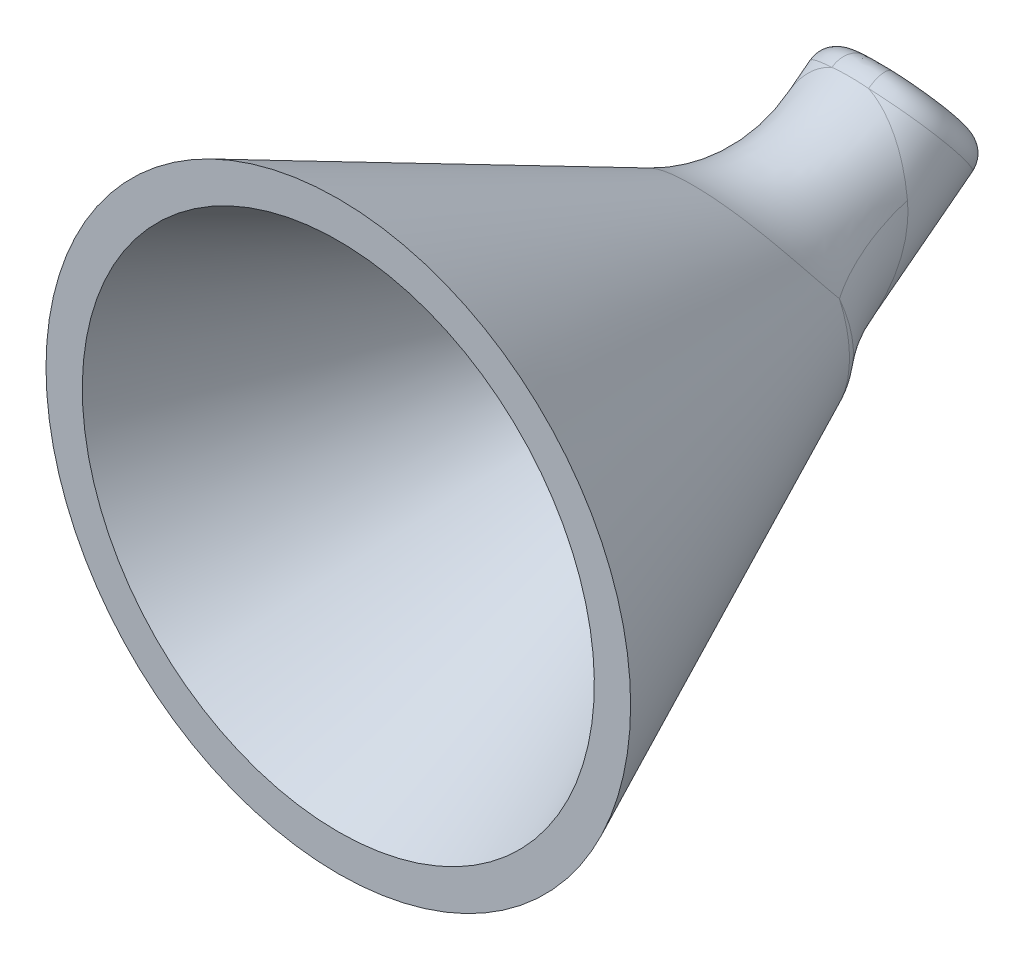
ISO-10303-21;
HEADER;
FILE_DESCRIPTION(('STEP AP214'),'2;1');
FILE_NAME('part.step','',(''),(''),'','','');
FILE_SCHEMA(('AUTOMOTIVE_DESIGN { 1 0 10303 214 1 1 1 1 }'));
ENDSEC;
DATA;
#1=APPLICATION_CONTEXT('core data for automotive mechanical design processes');
#2=APPLICATION_PROTOCOL_DEFINITION('international standard','automotive_design',2000,#1);
#3=PRODUCT_CONTEXT('',#1,'mechanical');
#4=PRODUCT('Part','Part','',(#3));
#5=PRODUCT_RELATED_PRODUCT_CATEGORY('part','',(#4));
#6=PRODUCT_DEFINITION_FORMATION('','',#4);
#7=PRODUCT_DEFINITION_CONTEXT('part definition',#1,'design');
#8=PRODUCT_DEFINITION('design','',#6,#7);
#9=PRODUCT_DEFINITION_SHAPE('','',#8);
#10=(LENGTH_UNIT() NAMED_UNIT(*) SI_UNIT(.MILLI.,.METRE.));
#11=(NAMED_UNIT(*) PLANE_ANGLE_UNIT() SI_UNIT($,.RADIAN.));
#12=(NAMED_UNIT(*) SI_UNIT($,.STERADIAN.) SOLID_ANGLE_UNIT());
#13=UNCERTAINTY_MEASURE_WITH_UNIT(LENGTH_MEASURE(1.E-05),#10,'distance_accuracy_value','');
#14=(GEOMETRIC_REPRESENTATION_CONTEXT(3) GLOBAL_UNCERTAINTY_ASSIGNED_CONTEXT((#13)) GLOBAL_UNIT_ASSIGNED_CONTEXT((#10,
#11,#12)) REPRESENTATION_CONTEXT('',''));
#15=CARTESIAN_POINT('',(0.,0.,0.));
#16=DIRECTION('',(0.,0.,1.));
#17=DIRECTION('',(1.,0.,0.));
#18=AXIS2_PLACEMENT_3D('',#15,#16,#17);
#19=CARTESIAN_POINT('',(0.,-30.7106932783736,54.8473001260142));
#20=DIRECTION('',(0.,0.608761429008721,-0.793353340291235));
#21=DIRECTION('',(1.,0.,0.));
#22=AXIS2_PLACEMENT_3D('',#19,#20,#21);
#23=CYLINDRICAL_SURFACE('',#22,1.175);
#24=CARTESIAN_POINT('',(0.,-27.66688613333,50.880533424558));
#25=DIRECTION('',(0.,-0.608761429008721,0.793353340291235));
#26=DIRECTION('',(1.,0.,0.));
#27=AXIS2_PLACEMENT_3D('',#24,#25,#26);
#28=CIRCLE('',#27,1.175);
#29=CARTESIAN_POINT('',(-1.175,-27.66688613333,50.880533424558));
#30=VERTEX_POINT('',#29);
#31=EDGE_CURVE('E382',#30,#30,#28,.T.);
#32=ORIENTED_EDGE('',*,*,#31,.F.);
#33=DIRECTION('',(0.,-0.608761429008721,0.793353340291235));
#34=VECTOR('',#33,1.);
#35=CARTESIAN_POINT('',(-1.175,-30.7106932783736,54.8473001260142));
#36=LINE('',#35,#34);
#37=CARTESIAN_POINT('',(-1.175,-30.7106932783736,54.8473001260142));
#38=VERTEX_POINT('',#37);
#39=EDGE_CURVE('E11',#30,#38,#36,.T.);
#40=ORIENTED_EDGE('',*,*,#39,.T.);
#41=CARTESIAN_POINT('',(0.,-30.7106932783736,54.8473001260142));
#42=DIRECTION('',(0.,0.608761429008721,-0.793353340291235));
#43=DIRECTION('',(1.,0.,0.));
#44=AXIS2_PLACEMENT_3D('',#41,#42,#43);
#45=CIRCLE('',#44,1.175);
#46=EDGE_CURVE('E27',#38,#38,#45,.T.);
#47=ORIENTED_EDGE('',*,*,#46,.F.);
#48=ORIENTED_EDGE('',*,*,#39,.F.);
#49=EDGE_LOOP('',(#32,#40,#47,#48));
#50=FACE_BOUND('',#49,.T.);
#51=ADVANCED_FACE('F16',(#50),#23,.F.);
#52=CARTESIAN_POINT('',(0.,-30.7106932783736,54.8473001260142));
#53=DIRECTION('',(0.,-0.608761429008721,0.793353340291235));
#54=DIRECTION('',(-1.,0.,0.));
#55=AXIS2_PLACEMENT_3D('',#52,#53,#54);
#56=PLANE('',#55);
#57=CARTESIAN_POINT('',(0.,-30.7106932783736,54.8473001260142));
#58=DIRECTION('',(0.,0.608761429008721,-0.793353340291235));
#59=DIRECTION('',(1.,0.,0.));
#60=AXIS2_PLACEMENT_3D('',#57,#58,#59);
#61=CIRCLE('',#60,0.95);
#62=CARTESIAN_POINT('',(-0.95,-30.7106932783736,54.8473001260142));
#63=VERTEX_POINT('',#62);
#64=EDGE_CURVE('E760',#63,#63,#61,.T.);
#65=ORIENTED_EDGE('',*,*,#64,.F.);
#66=EDGE_LOOP('',(#65));
#67=FACE_BOUND('',#66,.T.);
#68=ORIENTED_EDGE('',*,*,#46,.T.);
#69=EDGE_LOOP('',(#68));
#70=FACE_BOUND('',#69,.T.);
#71=ADVANCED_FACE('F573',(#67,#70),#56,.F.);
#72=CARTESIAN_POINT('',(0.,-32.2713973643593,66.8812492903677));
#73=DIRECTION('',(0.,0.,1.));
#74=DIRECTION('',(0.,1.,0.));
#75=AXIS2_PLACEMENT_3D('',#72,#73,#74);
#76=CONICAL_SURFACE('',#75,8.66507649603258,0.436332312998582);
#77=CARTESIAN_POINT('',(-4.09784755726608,-30.2156872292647,58.1305787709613));
#78=CARTESIAN_POINT('',(-4.02424005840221,-29.1500943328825,59.0141503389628));
#79=CARTESIAN_POINT('',(-3.16812892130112,-27.49568122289,60.101621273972));
#80=CARTESIAN_POINT('',(-0.933427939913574,-26.4412304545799,60.7526065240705));
#81=CARTESIAN_POINT('',(0.936308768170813,-26.4423237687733,60.7508898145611));
#82=CARTESIAN_POINT('',(2.60852163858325,-27.2318035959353,60.2657299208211));
#83=CARTESIAN_POINT('',(3.75205915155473,-28.5979194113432,59.3716174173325));
#84=CARTESIAN_POINT('',(4.06104380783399,-29.6828907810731,58.5723645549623));
#85=CARTESIAN_POINT('',(4.09784755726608,-30.2156872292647,58.1305787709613));
#86=(BOUNDED_CURVE() B_SPLINE_CURVE(3,(#77,#78,#79,#80,#81,#82,#83,#84,#85),.UNSPECIFIED.,.F.,
.F.) B_SPLINE_CURVE_WITH_KNOTS((4,1,1,1,1,1,4),(0.,0.763029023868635,1.14454353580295,
1.52605804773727,1.90757255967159,2.2890870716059,2.67060158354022),
.UNSPECIFIED.) CURVE() GEOMETRIC_REPRESENTATION_ITEM() RATIONAL_B_SPLINE_CURVE((1.,1.,1.,1.,1.,
1.,1.,1.,1.)) REPRESENTATION_ITEM(''));
#87=CARTESIAN_POINT('',(-4.09784755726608,-30.2156872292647,58.1305787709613));
#88=VERTEX_POINT('',#87);
#89=CARTESIAN_POINT('',(4.09784755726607,-30.2156872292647,58.1305787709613));
#90=VERTEX_POINT('',#89);
#91=EDGE_CURVE('E183',#88,#90,#86,.T.);
#92=ORIENTED_EDGE('',*,*,#91,.F.);
#93=CARTESIAN_POINT('',(-0.506391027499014,-36.4164862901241,57.2541929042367));
#94=CARTESIAN_POINT('',(-0.80023552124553,-36.4549813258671,57.4125518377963));
#95=CARTESIAN_POINT('',(-1.52094353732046,-36.4278460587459,57.6811716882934));
#96=CARTESIAN_POINT('',(-3.06504961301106,-35.8002441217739,58.0226013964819));
#97=CARTESIAN_POINT('',(-4.81156061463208,-33.7167045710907,58.2060925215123));
#98=CARTESIAN_POINT('',(-4.70613210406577,-31.3579719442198,58.1981480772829));
#99=CARTESIAN_POINT('',(-4.09784755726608,-30.2156872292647,58.1305787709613));
#100=(BOUNDED_CURVE() B_SPLINE_CURVE(3,(#93,#94,#95,#96,#97,#98,#99),.UNSPECIFIED.,.F.,
.F.) B_SPLINE_CURVE_WITH_KNOTS((4,1,1,1,4),(-0.503150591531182,-0.437865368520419,
-0.372580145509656,-0.24200969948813,-0.0461540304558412),
.UNSPECIFIED.) CURVE() GEOMETRIC_REPRESENTATION_ITEM() RATIONAL_B_SPLINE_CURVE((1.,1.,1.,1.,1.,
1.,1.)) REPRESENTATION_ITEM(''));
#101=CARTESIAN_POINT('',(-0.506391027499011,-36.4164862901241,57.2541929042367));
#102=VERTEX_POINT('',#101);
#103=EDGE_CURVE('E179',#102,#88,#100,.T.);
#104=ORIENTED_EDGE('',*,*,#103,.F.);
#105=CARTESIAN_POINT('',(0.506391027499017,-36.4164862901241,57.2541929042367));
#106=CARTESIAN_POINT('',(0.436175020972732,-36.4072876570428,57.2163520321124));
#107=CARTESIAN_POINT('',(0.269717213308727,-36.3919218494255,57.1450184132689));
#108=CARTESIAN_POINT('',(-0.0326865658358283,-36.3870434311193,57.1184282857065));
#109=CARTESIAN_POINT('',(-0.310723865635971,-36.3959532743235,57.1644161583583));
#110=CARTESIAN_POINT('',(-0.435561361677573,-36.4072072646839,57.2160213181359));
#111=CARTESIAN_POINT('',(-0.506391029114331,-36.4164862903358,57.2541929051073));
#112=(BOUNDED_CURVE() B_SPLINE_CURVE(3,(#105,#106,#107,#108,#109,#110,#111),.UNSPECIFIED.,.F.,
.F.) B_SPLINE_CURVE_WITH_KNOTS((4,1,1,1,4),(1.26609524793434,1.28176267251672,1.29743009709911,
1.3052638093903,1.32093123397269),
.UNSPECIFIED.) CURVE() GEOMETRIC_REPRESENTATION_ITEM() RATIONAL_B_SPLINE_CURVE((1.,1.,1.,1.,1.,
1.,1.)) REPRESENTATION_ITEM(''));
#113=CARTESIAN_POINT('',(-6.60067950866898E-05,-36.3891271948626,57.1294475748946));
#114=VERTEX_POINT('',#113);
#115=EDGE_CURVE('E161',#114,#102,#112,.T.);
#116=ORIENTED_EDGE('',*,*,#115,.F.);
#117=DIRECTION('',(0.,-0.422618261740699,0.90630778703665));
#118=VECTOR('',#117,1.);
#119=CARTESIAN_POINT('',(0.,-40.9364738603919,66.8812492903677));
#120=LINE('',#119,#118);
#121=CARTESIAN_POINT('',(0.,-45.5995504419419,76.8812492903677));
#122=VERTEX_POINT('',#121);
#123=EDGE_CURVE('E48',#114,#122,#120,.T.);
#124=ORIENTED_EDGE('',*,*,#123,.T.);
#125=CARTESIAN_POINT('',(0.,-32.2713973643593,76.8812492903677));
#126=DIRECTION('',(0.,0.,-1.));
#127=DIRECTION('',(1.,0.,0.));
#128=AXIS2_PLACEMENT_3D('',#125,#126,#127);
#129=CIRCLE('',#128,13.3281530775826);
#130=EDGE_CURVE('E766',#122,#122,#129,.T.);
#131=ORIENTED_EDGE('',*,*,#130,.T.);
#132=ORIENTED_EDGE('',*,*,#123,.F.);
#133=CARTESIAN_POINT('',(0.506391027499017,-36.4164862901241,57.2541929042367));
#134=CARTESIAN_POINT('',(0.436175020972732,-36.4072876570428,57.2163520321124));
#135=CARTESIAN_POINT('',(0.269717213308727,-36.3919218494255,57.1450184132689));
#136=CARTESIAN_POINT('',(-0.0326865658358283,-36.3870434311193,57.1184282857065));
#137=CARTESIAN_POINT('',(-0.310723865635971,-36.3959532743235,57.1644161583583));
#138=CARTESIAN_POINT('',(-0.435561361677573,-36.4072072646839,57.2160213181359));
#139=CARTESIAN_POINT('',(-0.506391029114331,-36.4164862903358,57.2541929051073));
#140=(BOUNDED_CURVE() B_SPLINE_CURVE(3,(#133,#134,#135,#136,#137,#138,#139),.UNSPECIFIED.,.F.,
.F.) B_SPLINE_CURVE_WITH_KNOTS((4,1,1,1,4),(1.26609524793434,1.28176267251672,1.29743009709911,
1.3052638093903,1.32093123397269),
.UNSPECIFIED.) CURVE() GEOMETRIC_REPRESENTATION_ITEM() RATIONAL_B_SPLINE_CURVE((1.,1.,1.,1.,1.,
1.,1.)) REPRESENTATION_ITEM(''));
#141=CARTESIAN_POINT('',(0.506391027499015,-36.4164862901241,57.2541929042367));
#142=VERTEX_POINT('',#141);
#143=EDGE_CURVE('E171',#142,#114,#140,.T.);
#144=ORIENTED_EDGE('',*,*,#143,.F.);
#145=CARTESIAN_POINT('',(4.09784755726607,-30.2156872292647,58.1305787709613));
#146=CARTESIAN_POINT('',(4.50337058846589,-30.9772103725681,58.1756249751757));
#147=CARTESIAN_POINT('',(4.84086468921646,-32.7367342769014,58.1999617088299));
#148=CARTESIAN_POINT('',(3.81995290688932,-35.244443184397,58.1163369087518));
#149=CARTESIAN_POINT('',(1.89799525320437,-36.4218257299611,57.8159734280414));
#150=CARTESIAN_POINT('',(0.800235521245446,-36.4549813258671,57.4125518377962));
#151=CARTESIAN_POINT('',(0.506391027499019,-36.4164862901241,57.2541929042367));
#152=(BOUNDED_CURVE() B_SPLINE_CURVE(3,(#145,#146,#147,#148,#149,#150,#151),.UNSPECIFIED.,.F.,
.F.) B_SPLINE_CURVE_WITH_KNOTS((4,1,1,1,4),(-0.743892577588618,-0.613322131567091,
-0.482751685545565,-0.352181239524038,-0.286896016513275),
.UNSPECIFIED.) CURVE() GEOMETRIC_REPRESENTATION_ITEM() RATIONAL_B_SPLINE_CURVE((1.,1.,1.,1.,1.,
1.,1.)) REPRESENTATION_ITEM(''));
#153=EDGE_CURVE('E600',#90,#142,#152,.T.);
#154=ORIENTED_EDGE('',*,*,#153,.F.);
#155=EDGE_LOOP('',(#92,#104,#116,#124,#131,#132,#144,#154));
#156=FACE_BOUND('',#155,.T.);
#157=ADVANCED_FACE('F181',(#156),#76,.T.);
#158=CARTESIAN_POINT('',(0.,-18.9432442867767,76.8812492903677));
#159=DIRECTION('',(0.,0.,1.));
#160=DIRECTION('',(1.,0.,0.));
#161=AXIS2_PLACEMENT_3D('',#158,#159,#160);
#162=PLANE('',#161);
#163=CARTESIAN_POINT('',(0.,-32.2713973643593,76.8812492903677));
#164=DIRECTION('',(0.,0.,-1.));
#165=DIRECTION('',(1.,0.,0.));
#166=AXIS2_PLACEMENT_3D('',#163,#164,#165);
#167=CIRCLE('',#166,11.6730861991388);
#168=CARTESIAN_POINT('',(0.,-43.9444835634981,76.8812492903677));
#169=VERTEX_POINT('',#168);
#170=EDGE_CURVE('E730',#169,#169,#167,.T.);
#171=ORIENTED_EDGE('',*,*,#170,.T.);
#172=EDGE_LOOP('',(#171));
#173=FACE_BOUND('',#172,.T.);
#174=ORIENTED_EDGE('',*,*,#130,.F.);
#175=EDGE_LOOP('',(#174));
#176=FACE_BOUND('',#175,.T.);
#177=ADVANCED_FACE('F220',(#173,#176),#162,.T.);
#178=CARTESIAN_POINT('',(0.,-30.7106932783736,54.8473001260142));
#179=DIRECTION('',(0.,-0.608761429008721,0.793353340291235));
#180=DIRECTION('',(1.,0.,0.));
#181=AXIS2_PLACEMENT_3D('',#178,#179,#180);
#182=CYLINDRICAL_SURFACE('',#181,0.95);
#183=CARTESIAN_POINT('',(0.,-33.3187422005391,56.685630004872));
#184=CARTESIAN_POINT('',(-0.142119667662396,-33.3187422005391,56.685630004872));
#185=CARTESIAN_POINT('',(-0.425764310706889,-33.2209153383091,56.6648218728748));
#186=CARTESIAN_POINT('',(-0.826341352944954,-32.7424574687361,56.5630521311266));
#187=CARTESIAN_POINT('',(-0.974775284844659,-32.102190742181,56.4268650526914));
#188=CARTESIAN_POINT('',(-0.925873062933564,-31.4593922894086,56.2901394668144));
#189=CARTESIAN_POINT('',(-0.768229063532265,-30.9651193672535,56.1850058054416));
#190=CARTESIAN_POINT('',(-0.426261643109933,-30.554237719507,56.0976097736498));
#191=CARTESIAN_POINT('',(1.46591287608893E-05,-30.4078974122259,56.0664826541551));
#192=CARTESIAN_POINT('',(0.319584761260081,-30.5177731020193,56.0898536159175));
#193=CARTESIAN_POINT('',(0.56892790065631,-30.7254126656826,56.1340193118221));
#194=CARTESIAN_POINT('',(0.783214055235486,-31.0142535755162,56.1954568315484));
#195=CARTESIAN_POINT('',(1.02364139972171,-31.7569266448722,56.3534261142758));
#196=CARTESIAN_POINT('',(0.885347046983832,-32.6748076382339,56.5486627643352));
#197=CARTESIAN_POINT('',(0.425315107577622,-33.2206394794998,56.6647631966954));
#198=CARTESIAN_POINT('',(0.142119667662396,-33.3187422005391,56.685630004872));
#199=CARTESIAN_POINT('',(0.,-33.3187422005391,56.685630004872));
#200=(BOUNDED_CURVE() B_SPLINE_CURVE(3,(#183,#184,#185,#186,#187,#188,#189,#190,#191,#192,#193,
#194,#195,#196,#197,#198,#199),.UNSPECIFIED.,.T.,.F.) B_SPLINE_CURVE_WITH_KNOTS((4,1,1,1,1,1,1,
1,1,1,1,1,1,1,4),(-3.14159265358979,-2.69279370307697,-2.24399475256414,-1.5707963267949,
-1.34639685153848,-0.897597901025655,-0.448798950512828,0.,0.448798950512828,0.560998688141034,
0.897597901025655,1.34639685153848,2.24399475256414,2.69279370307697,3.14159265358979),
.UNSPECIFIED.) CURVE() GEOMETRIC_REPRESENTATION_ITEM() RATIONAL_B_SPLINE_CURVE((1.,1.,1.,1.,1.,
1.,1.,1.,1.,1.,1.,1.,1.,1.,1.,1.,1.)) REPRESENTATION_ITEM(''));
#201=CARTESIAN_POINT('',(0.,-33.3187422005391,56.685630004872));
#202=VERTEX_POINT('',#201);
#203=CARTESIAN_POINT('',(-0.95,-31.8877338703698,56.3812492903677));
#204=VERTEX_POINT('',#203);
#205=EDGE_CURVE('E742',#202,#204,#200,.T.);
#206=ORIENTED_EDGE('',*,*,#205,.F.);
#207=CARTESIAN_POINT('',(0.,-33.3187422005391,56.685630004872));
#208=CARTESIAN_POINT('',(-0.142119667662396,-33.3187422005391,56.685630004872));
#209=CARTESIAN_POINT('',(-0.425764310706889,-33.2209153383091,56.6648218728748));
#210=CARTESIAN_POINT('',(-0.826341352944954,-32.7424574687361,56.5630521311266));
#211=CARTESIAN_POINT('',(-0.974775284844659,-32.102190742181,56.4268650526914));
#212=CARTESIAN_POINT('',(-0.925873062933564,-31.4593922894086,56.2901394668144));
#213=CARTESIAN_POINT('',(-0.768229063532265,-30.9651193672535,56.1850058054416));
#214=CARTESIAN_POINT('',(-0.426261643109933,-30.554237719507,56.0976097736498));
#215=CARTESIAN_POINT('',(1.46591287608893E-05,-30.4078974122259,56.0664826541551));
#216=CARTESIAN_POINT('',(0.319584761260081,-30.5177731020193,56.0898536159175));
#217=CARTESIAN_POINT('',(0.56892790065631,-30.7254126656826,56.1340193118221));
#218=CARTESIAN_POINT('',(0.783214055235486,-31.0142535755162,56.1954568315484));
#219=CARTESIAN_POINT('',(1.02364139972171,-31.7569266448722,56.3534261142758));
#220=CARTESIAN_POINT('',(0.885347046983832,-32.6748076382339,56.5486627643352));
#221=CARTESIAN_POINT('',(0.425315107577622,-33.2206394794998,56.6647631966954));
#222=CARTESIAN_POINT('',(0.142119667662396,-33.3187422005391,56.685630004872));
#223=CARTESIAN_POINT('',(0.,-33.3187422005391,56.685630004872));
#224=(BOUNDED_CURVE() B_SPLINE_CURVE(3,(#207,#208,#209,#210,#211,#212,#213,#214,#215,#216,#217,
#218,#219,#220,#221,#222,#223),.UNSPECIFIED.,.T.,.F.) B_SPLINE_CURVE_WITH_KNOTS((4,1,1,1,1,1,1,
1,1,1,1,1,1,1,4),(-3.14159265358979,-2.69279370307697,-2.24399475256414,-1.5707963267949,
-1.34639685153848,-0.897597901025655,-0.448798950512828,0.,0.448798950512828,0.560998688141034,
0.897597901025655,1.34639685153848,2.24399475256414,2.69279370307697,3.14159265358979),
.UNSPECIFIED.) CURVE() GEOMETRIC_REPRESENTATION_ITEM() RATIONAL_B_SPLINE_CURVE((1.,1.,1.,1.,1.,
1.,1.,1.,1.,1.,1.,1.,1.,1.,1.,1.,1.)) REPRESENTATION_ITEM(''));
#225=EDGE_CURVE('E749',#204,#202,#224,.T.);
#226=ORIENTED_EDGE('',*,*,#225,.F.);
#227=DIRECTION('',(0.,0.608761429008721,-0.793353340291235));
#228=VECTOR('',#227,1.);
#229=CARTESIAN_POINT('',(-0.95,-30.7106932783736,54.8473001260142));
#230=LINE('',#229,#228);
#231=EDGE_CURVE('E754',#204,#63,#230,.T.);
#232=ORIENTED_EDGE('',*,*,#231,.T.);
#233=ORIENTED_EDGE('',*,*,#64,.T.);
#234=ORIENTED_EDGE('',*,*,#231,.F.);
#235=EDGE_LOOP('',(#206,#226,#232,#233,#234));
#236=FACE_BOUND('',#235,.T.);
#237=ADVANCED_FACE('F535',(#236),#182,.F.);
#238=CARTESIAN_POINT('',(0.,-33.7154188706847,56.8812492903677));
#239=CARTESIAN_POINT('',(0.216919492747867,-33.7154188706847,56.8812492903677));
#240=CARTESIAN_POINT('',(0.649165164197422,-33.5901219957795,56.8812492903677));
#241=CARTESIAN_POINT('',(1.35131917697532,-32.8929851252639,56.8812492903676));
#242=CARTESIAN_POINT('',(1.56240003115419,-31.7206667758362,56.8812492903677));
#243=CARTESIAN_POINT('',(1.19543197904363,-30.7721241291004,56.8812492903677));
#244=CARTESIAN_POINT('',(0.868363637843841,-30.4032162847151,56.8812492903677));
#245=CARTESIAN_POINT('',(0.487787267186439,-30.1380188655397,56.8812492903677));
#246=CARTESIAN_POINT('',(2.23744596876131E-05,-29.9976855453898,56.8812492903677));
#247=CARTESIAN_POINT('',(-0.650609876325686,-30.1845915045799,56.8812492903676));
#248=CARTESIAN_POINT('',(-1.17256014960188,-30.7093698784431,56.8812492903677));
#249=CARTESIAN_POINT('',(-1.41317467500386,-31.340655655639,56.8812492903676));
#250=CARTESIAN_POINT('',(-1.48781490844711,-32.1616383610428,56.8812492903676));
#251=CARTESIAN_POINT('',(-1.26125785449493,-32.9793875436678,56.8812492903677));
#252=CARTESIAN_POINT('',(-0.649850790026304,-33.5904743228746,56.8812492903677));
#253=CARTESIAN_POINT('',(-0.216919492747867,-33.7154188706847,56.8812492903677));
#254=CARTESIAN_POINT('',(0.,-33.7154188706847,56.8812492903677));
#255=CARTESIAN_POINT('',(0.,-33.6717856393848,56.8812492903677));
#256=CARTESIAN_POINT('',(0.208691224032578,-33.6717856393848,56.8812492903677));
#257=CARTESIAN_POINT('',(0.624411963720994,-33.5486785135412,56.881245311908));
#258=CARTESIAN_POINT('',(1.29569262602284,-32.8649865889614,56.881243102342));
#259=CARTESIAN_POINT('',(1.48089005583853,-31.7213949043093,56.8812134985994));
#260=CARTESIAN_POINT('',(1.11225939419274,-30.81816014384,56.8812394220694));
#261=CARTESIAN_POINT('',(0.799347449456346,-30.476289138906,56.8812583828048));
#262=CARTESIAN_POINT('',(0.443262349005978,-30.2346383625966,56.8812849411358));
#263=CARTESIAN_POINT('',(0.000211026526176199,-30.1113205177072,56.881274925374));
#264=CARTESIAN_POINT('',(-0.591384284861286,-30.2753574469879,56.8812826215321));
#265=CARTESIAN_POINT('',(-1.08958247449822,-30.7581985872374,56.8812411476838));
#266=CARTESIAN_POINT('',(-1.33083824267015,-31.3596415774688,56.8812423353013));
#267=CARTESIAN_POINT('',(-1.41624121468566,-32.1515692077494,56.8812341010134));
#268=CARTESIAN_POINT('',(-1.20939415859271,-32.9497340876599,56.8812236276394));
#269=CARTESIAN_POINT('',(-0.625128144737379,-33.5490246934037,56.8812419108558));
#270=CARTESIAN_POINT('',(-0.208691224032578,-33.6717856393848,56.8812492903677));
#271=CARTESIAN_POINT('',(0.,-33.6717856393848,56.8812492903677));
#272=CARTESIAN_POINT('',(0.,-33.5845400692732,56.8697373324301));
#273=CARTESIAN_POINT('',(0.19223779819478,-33.5845400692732,56.8697373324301));
#274=CARTESIAN_POINT('',(0.574922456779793,-33.4658156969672,56.8684082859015));
#275=CARTESIAN_POINT('',(1.18449967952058,-32.8090189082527,56.860750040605));
#276=CARTESIAN_POINT('',(1.31817818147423,-31.7228456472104,56.8456103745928));
#277=CARTESIAN_POINT('',(0.946475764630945,-30.9098680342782,56.8283950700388));
#278=CARTESIAN_POINT('',(0.661873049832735,-30.6217845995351,56.8202029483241));
#279=CARTESIAN_POINT('',(0.354624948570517,-30.4269794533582,56.8137663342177));
#280=CARTESIAN_POINT('',(0.00056072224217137,-30.3374148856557,56.8098396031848));
#281=CARTESIAN_POINT('',(-0.473444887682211,-30.4560609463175,56.8150978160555));
#282=CARTESIAN_POINT('',(-0.924216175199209,-30.8554773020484,56.8272874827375));
#283=CARTESIAN_POINT('',(-1.16655763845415,-31.3974830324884,56.83868373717));
#284=CARTESIAN_POINT('',(-1.27329418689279,-32.1314526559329,56.8513437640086));
#285=CARTESIAN_POINT('',(-1.10574035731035,-32.8904492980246,56.861664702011));
#286=CARTESIAN_POINT('',(-0.575702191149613,-33.4661498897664,56.8684135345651));
#287=CARTESIAN_POINT('',(-0.19223779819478,-33.5845400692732,56.8697373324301));
#288=CARTESIAN_POINT('',(0.,-33.5845400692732,56.8697373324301));
#289=CARTESIAN_POINT('',(0.,-33.4422029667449,56.8108295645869));
#290=CARTESIAN_POINT('',(0.16540060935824,-33.4422029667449,56.8108295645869));
#291=CARTESIAN_POINT('',(0.494384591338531,-33.3319386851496,56.8028722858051));
#292=CARTESIAN_POINT('',(1.00998265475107,-32.7240245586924,56.7573599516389));
#293=CARTESIAN_POINT('',(1.08935319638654,-31.7316111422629,56.6706413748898));
#294=CARTESIAN_POINT('',(0.743419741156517,-31.0257369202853,56.5786939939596));
#295=CARTESIAN_POINT('',(0.503672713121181,-30.7907254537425,56.5366022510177));
#296=CARTESIAN_POINT('',(0.258805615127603,-30.6387424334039,56.5040694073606));
#297=CARTESIAN_POINT('',(0.000804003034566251,-30.5770638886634,56.484572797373));
#298=CARTESIAN_POINT('',(-0.345856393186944,-30.6584046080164,56.5106126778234));
#299=CARTESIAN_POINT('',(-0.723065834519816,-30.9781515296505,56.5727676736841));
#300=CARTESIAN_POINT('',(-0.948046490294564,-31.4492912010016,56.633670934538));
#301=CARTESIAN_POINT('',(-1.06489428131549,-32.1047755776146,56.7034724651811));
#302=CARTESIAN_POINT('',(-0.94291882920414,-32.7994967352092,56.7628869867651));
#303=CARTESIAN_POINT('',(-0.495157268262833,-33.332230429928,56.8029182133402));
#304=CARTESIAN_POINT('',(-0.16540060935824,-33.4422029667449,56.8108295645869));
#305=CARTESIAN_POINT('',(0.,-33.4422029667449,56.8108295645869));
#306=CARTESIAN_POINT('',(0.,-33.3585855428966,56.7375548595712));
#307=CARTESIAN_POINT('',(0.149624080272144,-33.3585855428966,56.7375548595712));
#308=CARTESIAN_POINT('',(0.44748920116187,-33.2555979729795,56.7217729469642));
#309=CARTESIAN_POINT('',(0.920142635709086,-32.6855608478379,56.6328827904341));
#310=CARTESIAN_POINT('',(1.02018304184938,-31.7458475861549,56.4736497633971));
#311=CARTESIAN_POINT('',(0.735141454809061,-31.0362177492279,56.3262502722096));
#312=CARTESIAN_POINT('',(0.516694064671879,-30.7789141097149,56.263916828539));
#313=CARTESIAN_POINT('',(0.278970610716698,-30.6018207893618,56.2172986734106));
#314=CARTESIAN_POINT('',(0.000181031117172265,-30.5160653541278,56.1910910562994));
#315=CARTESIAN_POINT('',(-0.372087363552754,-30.6297980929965,56.2261046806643));
#316=CARTESIAN_POINT('',(-0.71804859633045,-30.9888642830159,56.3166174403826));
#317=CARTESIAN_POINT('',(-0.903794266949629,-31.4619741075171,56.414417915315));
#318=CARTESIAN_POINT('',(-0.986760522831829,-32.0992024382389,56.5337263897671));
#319=CARTESIAN_POINT('',(-0.859133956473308,-32.756300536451,56.6437806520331));
#320=CARTESIAN_POINT('',(-0.448130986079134,-33.255861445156,56.7218375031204));
#321=CARTESIAN_POINT('',(-0.149624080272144,-33.3585855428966,56.7375548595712));
#322=CARTESIAN_POINT('',(0.,-33.3585855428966,56.7375548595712));
#323=CARTESIAN_POINT('',(0.,-33.3187422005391,56.685630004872));
#324=CARTESIAN_POINT('',(0.142119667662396,-33.3187422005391,56.685630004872));
#325=CARTESIAN_POINT('',(0.425315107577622,-33.2206394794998,56.6647631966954));
#326=CARTESIAN_POINT('',(0.885347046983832,-32.6748076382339,56.5486627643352));
#327=CARTESIAN_POINT('',(1.02364139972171,-31.7569266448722,56.3534261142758));
#328=CARTESIAN_POINT('',(0.783214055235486,-31.0142535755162,56.1954568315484));
#329=CARTESIAN_POINT('',(0.56892790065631,-30.7254126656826,56.1340193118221));
#330=CARTESIAN_POINT('',(0.319584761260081,-30.5177731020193,56.0898536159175));
#331=CARTESIAN_POINT('',(1.46591287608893E-05,-30.4078974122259,56.0664826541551));
#332=CARTESIAN_POINT('',(-0.426261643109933,-30.554237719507,56.0976097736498));
#333=CARTESIAN_POINT('',(-0.768229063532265,-30.9651193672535,56.1850058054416));
#334=CARTESIAN_POINT('',(-0.925873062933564,-31.4593922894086,56.2901394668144));
#335=CARTESIAN_POINT('',(-0.974775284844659,-32.102190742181,56.4268650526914));
#336=CARTESIAN_POINT('',(-0.826341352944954,-32.7424574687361,56.5630521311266));
#337=CARTESIAN_POINT('',(-0.425764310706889,-33.2209153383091,56.6648218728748));
#338=CARTESIAN_POINT('',(-0.142119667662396,-33.3187422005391,56.685630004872));
#339=CARTESIAN_POINT('',(0.,-33.3187422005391,56.685630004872));
#340=(BOUNDED_SURFACE() B_SPLINE_SURFACE(3,3,((#238,#239,#240,#241,#242,#243,#244,#245,#246,
#247,#248,#249,#250,#251,#252,#253,#254),(#255,#256,#257,#258,#259,#260,#261,#262,#263,#264,
#265,#266,#267,#268,#269,#270,#271),(#272,#273,#274,#275,#276,#277,#278,#279,#280,#281,#282,
#283,#284,#285,#286,#287,#288),(#289,#290,#291,#292,#293,#294,#295,#296,#297,#298,#299,#300,
#301,#302,#303,#304,#305),(#306,#307,#308,#309,#310,#311,#312,#313,#314,#315,#316,#317,#318,
#319,#320,#321,#322),(#323,#324,#325,#326,#327,#328,#329,#330,#331,#332,#333,#334,#335,#336,
#337,#338,#339)),.UNSPECIFIED.,.F.,.T.,.F.) B_SPLINE_SURFACE_WITH_KNOTS((4,1,1,4),(4,1,1,1,1,1,
1,1,1,1,1,1,1,1,4),(0.,0.285714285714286,0.571428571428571,1.),(-3.14159265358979,
-2.69279370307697,-2.24399475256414,-1.34639685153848,-0.897597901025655,-0.560998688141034,
-0.448798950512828,0.,0.448798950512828,0.897597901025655,1.34639685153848,1.5707963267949,
2.24399475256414,2.69279370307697,3.14159265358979),
.UNSPECIFIED.) GEOMETRIC_REPRESENTATION_ITEM() RATIONAL_B_SPLINE_SURFACE(((1.,1.,1.,1.,1.,1.,1.,
1.,1.,1.,1.,1.,1.,1.,1.,1.,1.),(1.,1.,1.,1.,1.,1.,1.,1.,1.,1.,1.,1.,1.,1.,1.,1.,1.),(1.,1.,1.,
1.,1.,1.,1.,1.,1.,1.,1.,1.,1.,1.,1.,1.,1.),(1.,1.,1.,1.,1.,1.,1.,1.,1.,1.,1.,1.,1.,1.,1.,1.,1.),
(1.,1.,1.,1.,1.,1.,1.,1.,1.,1.,1.,1.,1.,1.,1.,1.,1.),(1.,1.,1.,1.,1.,1.,1.,1.,1.,1.,1.,1.,1.,1.,
1.,1.,1.))) REPRESENTATION_ITEM('') SURFACE());
#341=CARTESIAN_POINT('',(0.817678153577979,-33.3970949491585,56.8812492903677));
#342=CARTESIAN_POINT('',(0.561735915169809,-33.6083405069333,56.8812492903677));
#343=CARTESIAN_POINT('',(-0.0544781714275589,-33.8225519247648,56.8809036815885));
#344=CARTESIAN_POINT('',(-0.625721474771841,-33.5555291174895,56.8812492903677));
#345=CARTESIAN_POINT('',(-0.817678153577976,-33.3970949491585,56.8812492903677));
#346=(BOUNDED_CURVE() B_SPLINE_CURVE(3,(#341,#342,#343,#344,#345),.UNSPECIFIED.,.F.,
.F.) B_SPLINE_CURVE_WITH_KNOTS((4,1,4),(0.,3.59039160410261,6.28318530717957),
.UNSPECIFIED.) CURVE() GEOMETRIC_REPRESENTATION_ITEM() RATIONAL_B_SPLINE_CURVE((1.,1.,1.,1.,1.)) REPRESENTATION_ITEM(''));
#347=CARTESIAN_POINT('',(0.817678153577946,-33.3970949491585,56.8812492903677));
#348=VERTEX_POINT('',#347);
#349=CARTESIAN_POINT('',(0.,-33.7021634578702,56.8810735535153));
#350=VERTEX_POINT('',#349);
#351=EDGE_CURVE('E657',#348,#350,#346,.T.);
#352=CARTESIAN_POINT('',(0.,-31.8877338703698,56.8812492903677));
#353=DIRECTION('',(0.,0.,1.));
#354=DIRECTION('',(0.,1.,0.));
#355=AXIS2_PLACEMENT_3D('',#352,#353,#354);
#356=ELLIPSE('',#355,1.82768500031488,1.45);
#357=CARTESIAN_POINT('',(1.37995525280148,-32.4489251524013,56.8812492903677));
#358=VERTEX_POINT('',#357);
#359=EDGE_CURVE('E717',#348,#358,#356,.T.);
#360=CARTESIAN_POINT('',(-1.37995525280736,-32.448925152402,56.8812492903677));
#361=CARTESIAN_POINT('',(-1.42815137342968,-32.2331742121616,56.8812492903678));
#362=CARTESIAN_POINT('',(-1.44951909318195,-31.7833261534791,56.8811737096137));
#363=CARTESIAN_POINT('',(-1.28709586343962,-31.2409613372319,56.8749203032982));
#364=CARTESIAN_POINT('',(-1.08276643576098,-30.9216581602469,56.8624265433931));
#365=CARTESIAN_POINT('',(-0.961933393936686,-30.7789003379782,56.8546381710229));
#366=CARTESIAN_POINT('',(-0.894953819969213,-30.7080226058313,56.8503633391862));
#367=CARTESIAN_POINT('',(-0.819666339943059,-30.6372627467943,56.8457155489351));
#368=CARTESIAN_POINT('',(-0.704984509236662,-30.5416996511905,56.8391308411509));
#369=CARTESIAN_POINT('',(-0.556712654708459,-30.4428929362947,56.8320806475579));
#370=CARTESIAN_POINT('',(-0.322570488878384,-30.3346461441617,56.8260171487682));
#371=CARTESIAN_POINT('',(-0.0606811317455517,-30.2806677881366,56.8240319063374));
#372=CARTESIAN_POINT('',(0.170780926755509,-30.3021302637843,56.8248128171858));
#373=CARTESIAN_POINT('',(0.348338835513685,-30.3479463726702,56.8267759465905));
#374=CARTESIAN_POINT('',(0.560642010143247,-30.4423698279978,56.8320640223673));
#375=CARTESIAN_POINT('',(0.739756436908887,-30.566362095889,56.8408987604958));
#376=CARTESIAN_POINT('',(0.899356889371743,-30.7078133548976,56.8505180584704));
#377=CARTESIAN_POINT('',(1.06689982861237,-30.8971655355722,56.8615085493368));
#378=CARTESIAN_POINT('',(1.41237470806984,-31.4363072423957,56.8822838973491));
#379=CARTESIAN_POINT('',(1.47634749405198,-32.0174232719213,56.8812492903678));
#380=CARTESIAN_POINT('',(1.37995525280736,-32.448925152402,56.8812492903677));
#381=(BOUNDED_CURVE() B_SPLINE_CURVE(3,(#360,#361,#362,#363,#364,#365,#366,#367,#368,#369,#370,
#371,#372,#373,#374,#375,#376,#377,#378,#379,#380),.UNSPECIFIED.,.F.,
.F.) B_SPLINE_CURVE_WITH_KNOTS((4,1,1,1,1,1,1,1,1,1,1,1,1,1,1,1,1,1,4),(0.,0.897597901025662,
1.79519580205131,2.24399475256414,2.35619449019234,2.46839422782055,2.58059396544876,
2.69279370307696,2.91719317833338,3.02939291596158,3.14159265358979,3.19769252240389,
3.253792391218,3.3659921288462,3.59039160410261,3.81479107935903,4.03919055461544,
4.48798950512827,6.28318530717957),
.UNSPECIFIED.) CURVE() GEOMETRIC_REPRESENTATION_ITEM() RATIONAL_B_SPLINE_CURVE((1.,1.,1.,1.,1.,
1.,1.,1.,1.,1.,1.,1.,1.,1.,1.,1.,1.,1.,1.,1.,1.)) REPRESENTATION_ITEM(''));
#382=CARTESIAN_POINT('',(-1.37995525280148,-32.4489251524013,56.8812492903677));
#383=VERTEX_POINT('',#382);
#384=EDGE_CURVE('E700',#383,#358,#381,.T.);
#385=CARTESIAN_POINT('',(0.,-31.8877338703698,56.8812492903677));
#386=DIRECTION('',(0.,0.,1.));
#387=DIRECTION('',(0.,1.,0.));
#388=AXIS2_PLACEMENT_3D('',#385,#386,#387);
#389=ELLIPSE('',#388,1.82768500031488,1.45);
#390=CARTESIAN_POINT('',(-0.817678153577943,-33.3970949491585,56.8812492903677));
#391=VERTEX_POINT('',#390);
#392=EDGE_CURVE('E712',#383,#391,#389,.T.);
#393=CARTESIAN_POINT('',(0.817678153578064,-33.3970949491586,56.8812492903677));
#394=CARTESIAN_POINT('',(0.561735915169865,-33.6083405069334,56.8812492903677));
#395=CARTESIAN_POINT('',(-0.0544781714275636,-33.8225519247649,56.8809036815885));
#396=CARTESIAN_POINT('',(-0.625721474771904,-33.5555291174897,56.8812492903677));
#397=CARTESIAN_POINT('',(-0.817678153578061,-33.3970949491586,56.8812492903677));
#398=(BOUNDED_CURVE() B_SPLINE_CURVE(3,(#393,#394,#395,#396,#397),.UNSPECIFIED.,.F.,
.F.) B_SPLINE_CURVE_WITH_KNOTS((4,1,4),(0.,3.59039160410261,6.28318530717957),
.UNSPECIFIED.) CURVE() GEOMETRIC_REPRESENTATION_ITEM() RATIONAL_B_SPLINE_CURVE((1.,1.,1.,1.,1.)) REPRESENTATION_ITEM(''));
#399=EDGE_CURVE('E663',#350,#391,#398,.T.);
#400=CARTESIAN_POINT('',(0.,-33.3187422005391,56.685630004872));
#401=CARTESIAN_POINT('',(0.,-33.3585855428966,56.7375548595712));
#402=CARTESIAN_POINT('',(0.,-33.4422029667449,56.8108295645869));
#403=CARTESIAN_POINT('',(0.,-33.5804214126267,56.8680327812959));
#404=CARTESIAN_POINT('',(0.,-33.6629649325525,56.8800266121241));
#405=CARTESIAN_POINT('',(0.,-33.7021637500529,56.8810724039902));
#406=(BOUNDED_CURVE() B_SPLINE_CURVE(3,(#400,#401,#402,#403,#404,#405),.UNSPECIFIED.,.F.,
.F.) B_SPLINE_CURVE_WITH_KNOTS((4,1,1,4),(-1.,-0.571428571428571,-0.285714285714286,
-0.0289359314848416),
.UNSPECIFIED.) CURVE() GEOMETRIC_REPRESENTATION_ITEM() RATIONAL_B_SPLINE_CURVE((1.,1.,1.,1.,1.,1.)) REPRESENTATION_ITEM(''));
#407=EDGE_CURVE('E736',#202,#350,#406,.T.);
#408=CARTESIAN_POINT('',(0.,-33.7172056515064,56.8812492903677));
#409=CARTESIAN_POINT('',(0.217256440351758,-33.7172056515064,56.8812492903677));
#410=CARTESIAN_POINT('',(0.650178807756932,-33.5918191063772,56.8812494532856));
#411=CARTESIAN_POINT('',(1.35359708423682,-32.8941316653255,56.8812495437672));
#412=CARTESIAN_POINT('',(1.56573786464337,-31.7206369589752,56.8812507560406));
#413=CARTESIAN_POINT('',(1.19883789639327,-30.7702389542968,56.8812496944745));
#414=CARTESIAN_POINT('',(0.871189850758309,-30.400223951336,56.8812489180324));
#415=CARTESIAN_POINT('',(0.489610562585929,-30.1340622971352,56.8812478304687));
#416=CARTESIAN_POINT('',(1.46491575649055E-05,-29.9930321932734,56.8812482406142));
#417=CARTESIAN_POINT('',(-0.653035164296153,-30.1808746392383,56.8812479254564));
#418=CARTESIAN_POINT('',(-1.17595808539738,-30.707370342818,56.8812496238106));
#419=CARTESIAN_POINT('',(-1.41654635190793,-31.3398781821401,56.8812495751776));
#420=CARTESIAN_POINT('',(-1.49074585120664,-32.1620506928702,56.8812499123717));
#421=CARTESIAN_POINT('',(-1.26338167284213,-32.9806018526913,56.8812503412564));
#422=CARTESIAN_POINT('',(-0.650863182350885,-33.5921716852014,56.8812495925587));
#423=CARTESIAN_POINT('',(-0.217256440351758,-33.7172056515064,56.8812492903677));
#424=CARTESIAN_POINT('',(0.,-33.7172056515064,56.8812492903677));
#425=CARTESIAN_POINT('',(0.,-33.7166100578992,56.8812492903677));
#426=CARTESIAN_POINT('',(0.217144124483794,-33.7166100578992,56.8812492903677));
#427=CARTESIAN_POINT('',(0.649840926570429,-33.5912534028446,56.8812493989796));
#428=CARTESIAN_POINT('',(1.35283778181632,-32.893749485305,56.8812494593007));
#429=CARTESIAN_POINT('',(1.56462525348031,-31.7206468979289,56.881250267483));
#430=CARTESIAN_POINT('',(1.19770259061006,-30.770867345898,56.8812495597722));
#431=CARTESIAN_POINT('',(0.87024777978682,-30.4012213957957,56.8812490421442));
#432=CARTESIAN_POINT('',(0.489002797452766,-30.13538115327,56.8812483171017));
#433=CARTESIAN_POINT('',(1.72242582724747E-05,-29.9945833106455,56.881248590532));
#434=CARTESIAN_POINT('',(-0.652226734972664,-30.1821135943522,56.8812483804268));
#435=CARTESIAN_POINT('',(-1.17482544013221,-30.708036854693,56.881249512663));
#436=CARTESIAN_POINT('',(-1.41542245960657,-31.340137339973,56.8812494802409));
#437=CARTESIAN_POINT('',(-1.4897688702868,-32.1619132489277,56.881249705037));
#438=CARTESIAN_POINT('',(-1.26267373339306,-32.9801970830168,56.8812499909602));
#439=CARTESIAN_POINT('',(-0.650525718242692,-33.5916058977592,56.8812494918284));
#440=CARTESIAN_POINT('',(-0.217144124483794,-33.7166100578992,56.8812492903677));
#441=CARTESIAN_POINT('',(0.,-33.7166100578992,56.8812492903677));
#442=CARTESIAN_POINT('',(0.,-33.7160144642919,56.8812492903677));
#443=CARTESIAN_POINT('',(0.217031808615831,-33.7160144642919,56.8812492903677));
#444=CARTESIAN_POINT('',(0.649503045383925,-33.5906876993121,56.8812493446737));
#445=CARTESIAN_POINT('',(1.35207847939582,-32.8933673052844,56.8812493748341));
#446=CARTESIAN_POINT('',(1.56351264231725,-31.7206568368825,56.8812497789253));
#447=CARTESIAN_POINT('',(1.19656728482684,-30.7714957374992,56.88124942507));
#448=CARTESIAN_POINT('',(0.86930570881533,-30.4022188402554,56.8812491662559));
#449=CARTESIAN_POINT('',(0.488395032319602,-30.1367000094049,56.8812488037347));
#450=CARTESIAN_POINT('',(1.97993589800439E-05,-29.9961344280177,56.8812489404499));
#451=CARTESIAN_POINT('',(-0.651418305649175,-30.183352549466,56.8812488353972));
#452=CARTESIAN_POINT('',(-1.17369279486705,-30.7087033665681,56.8812494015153));
#453=CARTESIAN_POINT('',(-1.41429856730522,-31.340396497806,56.8812493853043));
#454=CARTESIAN_POINT('',(-1.48879188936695,-32.1617758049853,56.8812494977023));
#455=CARTESIAN_POINT('',(-1.261965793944,-32.9797923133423,56.8812496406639));
#456=CARTESIAN_POINT('',(-0.650188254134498,-33.5910401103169,56.881249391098));
#457=CARTESIAN_POINT('',(-0.217031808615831,-33.7160144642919,56.8812492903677));
#458=CARTESIAN_POINT('',(0.,-33.7160144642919,56.8812492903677));
#459=CARTESIAN_POINT('',(0.,-33.7154188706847,56.8812492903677));
#460=CARTESIAN_POINT('',(0.216919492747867,-33.7154188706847,56.8812492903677));
#461=CARTESIAN_POINT('',(0.649165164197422,-33.5901219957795,56.8812492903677));
#462=CARTESIAN_POINT('',(1.35131917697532,-32.8929851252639,56.8812492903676));
#463=CARTESIAN_POINT('',(1.56240003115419,-31.7206667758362,56.8812492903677));
#464=CARTESIAN_POINT('',(1.19543197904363,-30.7721241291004,56.8812492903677));
#465=CARTESIAN_POINT('',(0.868363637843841,-30.4032162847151,56.8812492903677));
#466=CARTESIAN_POINT('',(0.487787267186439,-30.1380188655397,56.8812492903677));
#467=CARTESIAN_POINT('',(2.23744596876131E-05,-29.9976855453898,56.8812492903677));
#468=CARTESIAN_POINT('',(-0.650609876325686,-30.1845915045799,56.8812492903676));
#469=CARTESIAN_POINT('',(-1.17256014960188,-30.7093698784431,56.8812492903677));
#470=CARTESIAN_POINT('',(-1.41317467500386,-31.340655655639,56.8812492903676));
#471=CARTESIAN_POINT('',(-1.48781490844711,-32.1616383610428,56.8812492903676));
#472=CARTESIAN_POINT('',(-1.26125785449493,-32.9793875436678,56.8812492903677));
#473=CARTESIAN_POINT('',(-0.649850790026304,-33.5904743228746,56.8812492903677));
#474=CARTESIAN_POINT('',(-0.216919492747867,-33.7154188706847,56.8812492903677));
#475=CARTESIAN_POINT('',(0.,-33.7154188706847,56.8812492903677));
#476=CARTESIAN_POINT('',(0.,-33.6717856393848,56.8812492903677));
#477=CARTESIAN_POINT('',(0.208691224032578,-33.6717856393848,56.8812492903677));
#478=CARTESIAN_POINT('',(0.624411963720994,-33.5486785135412,56.881245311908));
#479=CARTESIAN_POINT('',(1.29569262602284,-32.8649865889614,56.881243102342));
#480=CARTESIAN_POINT('',(1.48089005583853,-31.7213949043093,56.8812134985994));
#481=CARTESIAN_POINT('',(1.11225939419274,-30.81816014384,56.8812394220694));
#482=CARTESIAN_POINT('',(0.799347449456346,-30.476289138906,56.8812583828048));
#483=CARTESIAN_POINT('',(0.443262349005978,-30.2346383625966,56.8812849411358));
#484=CARTESIAN_POINT('',(0.000211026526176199,-30.1113205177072,56.881274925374));
#485=CARTESIAN_POINT('',(-0.591384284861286,-30.2753574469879,56.8812826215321));
#486=CARTESIAN_POINT('',(-1.08958247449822,-30.7581985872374,56.8812411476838));
#487=CARTESIAN_POINT('',(-1.33083824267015,-31.3596415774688,56.8812423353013));
#488=CARTESIAN_POINT('',(-1.41624121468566,-32.1515692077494,56.8812341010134));
#489=CARTESIAN_POINT('',(-1.20939415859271,-32.9497340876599,56.8812236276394));
#490=CARTESIAN_POINT('',(-0.625128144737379,-33.5490246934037,56.8812419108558));
#491=CARTESIAN_POINT('',(-0.208691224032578,-33.6717856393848,56.8812492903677));
#492=CARTESIAN_POINT('',(0.,-33.6717856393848,56.8812492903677));
#493=CARTESIAN_POINT('',(0.,-33.5845400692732,56.8697373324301));
#494=CARTESIAN_POINT('',(0.19223779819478,-33.5845400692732,56.8697373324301));
#495=CARTESIAN_POINT('',(0.574922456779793,-33.4658156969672,56.8684082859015));
#496=CARTESIAN_POINT('',(1.18449967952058,-32.8090189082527,56.860750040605));
#497=CARTESIAN_POINT('',(1.31817818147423,-31.7228456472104,56.8456103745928));
#498=CARTESIAN_POINT('',(0.946475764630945,-30.9098680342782,56.8283950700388));
#499=CARTESIAN_POINT('',(0.661873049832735,-30.6217845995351,56.8202029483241));
#500=CARTESIAN_POINT('',(0.354624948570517,-30.4269794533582,56.8137663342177));
#501=CARTESIAN_POINT('',(0.00056072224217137,-30.3374148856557,56.8098396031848));
#502=CARTESIAN_POINT('',(-0.473444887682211,-30.4560609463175,56.8150978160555));
#503=CARTESIAN_POINT('',(-0.924216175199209,-30.8554773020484,56.8272874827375));
#504=CARTESIAN_POINT('',(-1.16655763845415,-31.3974830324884,56.83868373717));
#505=CARTESIAN_POINT('',(-1.27329418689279,-32.1314526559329,56.8513437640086));
#506=CARTESIAN_POINT('',(-1.10574035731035,-32.8904492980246,56.861664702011));
#507=CARTESIAN_POINT('',(-0.575702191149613,-33.4661498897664,56.8684135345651));
#508=CARTESIAN_POINT('',(-0.19223779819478,-33.5845400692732,56.8697373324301));
#509=CARTESIAN_POINT('',(0.,-33.5845400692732,56.8697373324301));
#510=CARTESIAN_POINT('',(0.,-33.4422029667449,56.8108295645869));
#511=CARTESIAN_POINT('',(0.16540060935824,-33.4422029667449,56.8108295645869));
#512=CARTESIAN_POINT('',(0.494384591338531,-33.3319386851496,56.8028722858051));
#513=CARTESIAN_POINT('',(1.00998265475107,-32.7240245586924,56.7573599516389));
#514=CARTESIAN_POINT('',(1.08935319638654,-31.7316111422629,56.6706413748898));
#515=CARTESIAN_POINT('',(0.743419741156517,-31.0257369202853,56.5786939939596));
#516=CARTESIAN_POINT('',(0.503672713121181,-30.7907254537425,56.5366022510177));
#517=CARTESIAN_POINT('',(0.258805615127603,-30.6387424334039,56.5040694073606));
#518=CARTESIAN_POINT('',(0.000804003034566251,-30.5770638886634,56.484572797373));
#519=CARTESIAN_POINT('',(-0.345856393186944,-30.6584046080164,56.5106126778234));
#520=CARTESIAN_POINT('',(-0.723065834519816,-30.9781515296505,56.5727676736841));
#521=CARTESIAN_POINT('',(-0.948046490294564,-31.4492912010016,56.633670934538));
#522=CARTESIAN_POINT('',(-1.06489428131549,-32.1047755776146,56.7034724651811));
#523=CARTESIAN_POINT('',(-0.94291882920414,-32.7994967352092,56.7628869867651));
#524=CARTESIAN_POINT('',(-0.495157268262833,-33.332230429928,56.8029182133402));
#525=CARTESIAN_POINT('',(-0.16540060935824,-33.4422029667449,56.8108295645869));
#526=CARTESIAN_POINT('',(0.,-33.4422029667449,56.8108295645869));
#527=CARTESIAN_POINT('',(0.,-33.3585855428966,56.7375548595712));
#528=CARTESIAN_POINT('',(0.149624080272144,-33.3585855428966,56.7375548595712));
#529=CARTESIAN_POINT('',(0.44748920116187,-33.2555979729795,56.7217729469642));
#530=CARTESIAN_POINT('',(0.920142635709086,-32.6855608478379,56.6328827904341));
#531=CARTESIAN_POINT('',(1.02018304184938,-31.7458475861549,56.4736497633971));
#532=CARTESIAN_POINT('',(0.735141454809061,-31.0362177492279,56.3262502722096));
#533=CARTESIAN_POINT('',(0.516694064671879,-30.7789141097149,56.263916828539));
#534=CARTESIAN_POINT('',(0.278970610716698,-30.6018207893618,56.2172986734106));
#535=CARTESIAN_POINT('',(0.000181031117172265,-30.5160653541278,56.1910910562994));
#536=CARTESIAN_POINT('',(-0.372087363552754,-30.6297980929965,56.2261046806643));
#537=CARTESIAN_POINT('',(-0.71804859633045,-30.9888642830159,56.3166174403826));
#538=CARTESIAN_POINT('',(-0.903794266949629,-31.4619741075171,56.414417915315));
#539=CARTESIAN_POINT('',(-0.986760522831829,-32.0992024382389,56.5337263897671));
#540=CARTESIAN_POINT('',(-0.859133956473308,-32.756300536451,56.6437806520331));
#541=CARTESIAN_POINT('',(-0.448130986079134,-33.255861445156,56.7218375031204));
#542=CARTESIAN_POINT('',(-0.149624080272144,-33.3585855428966,56.7375548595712));
#543=CARTESIAN_POINT('',(0.,-33.3585855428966,56.7375548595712));
#544=CARTESIAN_POINT('',(0.,-33.3187422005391,56.685630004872));
#545=CARTESIAN_POINT('',(0.142119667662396,-33.3187422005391,56.685630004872));
#546=CARTESIAN_POINT('',(0.425315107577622,-33.2206394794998,56.6647631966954));
#547=CARTESIAN_POINT('',(0.885347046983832,-32.6748076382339,56.5486627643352));
#548=CARTESIAN_POINT('',(1.02364139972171,-31.7569266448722,56.3534261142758));
#549=CARTESIAN_POINT('',(0.783214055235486,-31.0142535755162,56.1954568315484));
#550=CARTESIAN_POINT('',(0.56892790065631,-30.7254126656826,56.1340193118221));
#551=CARTESIAN_POINT('',(0.319584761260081,-30.5177731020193,56.0898536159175));
#552=CARTESIAN_POINT('',(1.46591287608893E-05,-30.4078974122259,56.0664826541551));
#553=CARTESIAN_POINT('',(-0.426261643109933,-30.554237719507,56.0976097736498));
#554=CARTESIAN_POINT('',(-0.768229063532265,-30.9651193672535,56.1850058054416));
#555=CARTESIAN_POINT('',(-0.925873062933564,-31.4593922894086,56.2901394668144));
#556=CARTESIAN_POINT('',(-0.974775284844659,-32.102190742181,56.4268650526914));
#557=CARTESIAN_POINT('',(-0.826341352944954,-32.7424574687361,56.5630521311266));
#558=CARTESIAN_POINT('',(-0.425764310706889,-33.2209153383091,56.6648218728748));
#559=CARTESIAN_POINT('',(-0.142119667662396,-33.3187422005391,56.685630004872));
#560=CARTESIAN_POINT('',(0.,-33.3187422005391,56.685630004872));
#561=(BOUNDED_SURFACE() B_SPLINE_SURFACE(3,3,((#408,#409,#410,#411,#412,#413,#414,#415,#416,
#417,#418,#419,#420,#421,#422,#423,#424),(#425,#426,#427,#428,#429,#430,#431,#432,#433,#434,
#435,#436,#437,#438,#439,#440,#441),(#442,#443,#444,#445,#446,#447,#448,#449,#450,#451,#452,
#453,#454,#455,#456,#457,#458),(#459,#460,#461,#462,#463,#464,#465,#466,#467,#468,#469,#470,
#471,#472,#473,#474,#475),(#476,#477,#478,#479,#480,#481,#482,#483,#484,#485,#486,#487,#488,
#489,#490,#491,#492),(#493,#494,#495,#496,#497,#498,#499,#500,#501,#502,#503,#504,#505,#506,
#507,#508,#509),(#510,#511,#512,#513,#514,#515,#516,#517,#518,#519,#520,#521,#522,#523,#524,
#525,#526),(#527,#528,#529,#530,#531,#532,#533,#534,#535,#536,#537,#538,#539,#540,#541,#542,
#543),(#544,#545,#546,#547,#548,#549,#550,#551,#552,#553,#554,#555,#556,#557,#558,#559,#560)),
.UNSPECIFIED.,.F.,.T.,.F.) B_SPLINE_SURFACE_WITH_KNOTS((4,3,1,1,4),(4,1,1,1,1,1,1,1,1,1,1,1,1,1,
4),(-0.0039,0.,0.285714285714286,0.571428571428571,1.),(-3.14159265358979,-2.69279370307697,
-2.24399475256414,-1.34639685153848,-0.897597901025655,-0.560998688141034,-0.448798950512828,0.,
0.448798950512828,0.897597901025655,1.34639685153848,1.5707963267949,2.24399475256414,
2.69279370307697,3.14159265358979),
.UNSPECIFIED.) GEOMETRIC_REPRESENTATION_ITEM() RATIONAL_B_SPLINE_SURFACE(((1.,1.,1.,1.,1.,1.,1.,
1.,1.,1.,1.,1.,1.,1.,1.,1.,1.),(1.,1.,1.,1.,1.,1.,1.,1.,1.,1.,1.,1.,1.,1.,1.,1.,1.),(1.,1.,1.,
1.,1.,1.,1.,1.,1.,1.,1.,1.,1.,1.,1.,1.,1.),(1.,1.,1.,1.,1.,1.,1.,1.,1.,1.,1.,1.,1.,1.,1.,1.,1.),
(1.,1.,1.,1.,1.,1.,1.,1.,1.,1.,1.,1.,1.,1.,1.,1.,1.),(1.,1.,1.,1.,1.,1.,1.,1.,1.,1.,1.,1.,1.,1.,
1.,1.,1.),(1.,1.,1.,1.,1.,1.,1.,1.,1.,1.,1.,1.,1.,1.,1.,1.,1.),(1.,1.,1.,1.,1.,1.,1.,1.,1.,1.,
1.,1.,1.,1.,1.,1.,1.),(1.,1.,1.,1.,1.,1.,1.,1.,1.,1.,1.,1.,1.,1.,1.,1.,1.))) REPRESENTATION_ITEM('') SURFACE());
#562=ORIENTED_EDGE('',*,*,#351,.F.);
#563=ORIENTED_EDGE('',*,*,#359,.T.);
#564=ORIENTED_EDGE('',*,*,#384,.F.);
#565=ORIENTED_EDGE('',*,*,#392,.T.);
#566=ORIENTED_EDGE('',*,*,#399,.F.);
#567=ORIENTED_EDGE('',*,*,#407,.F.);
#568=ORIENTED_EDGE('',*,*,#205,.T.);
#569=ORIENTED_EDGE('',*,*,#225,.T.);
#570=ORIENTED_EDGE('',*,*,#407,.T.);
#571=EDGE_LOOP('',(#562,#563,#564,#565,#566,#567,#568,#569,#570));
#572=FACE_BOUND('',#571,.T.);
#573=ADVANCED_FACE('F884',(#572),#561,.F.);
#574=CARTESIAN_POINT('',(0.,-32.2713973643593,66.8812492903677));
#575=DIRECTION('',(0.,0.,1.));
#576=DIRECTION('',(0.,1.,0.));
#577=AXIS2_PLACEMENT_3D('',#574,#575,#576);
#578=CONICAL_SURFACE('',#577,7.01000961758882,0.436332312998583);
#579=CARTESIAN_POINT('',(0.,-32.2713973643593,57.7473218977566));
#580=DIRECTION('',(0.,0.,1.));
#581=DIRECTION('',(0.,-1.,0.));
#582=AXIS2_PLACEMENT_3D('',#579,#580,#581);
#583=CIRCLE('',#582,2.75078932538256);
#584=CARTESIAN_POINT('',(-2.72830500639,-32.6223869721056,57.7473218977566));
#585=VERTEX_POINT('',#584);
#586=CARTESIAN_POINT('',(-1.61662879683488,-34.497010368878,57.7473218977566));
#587=VERTEX_POINT('',#586);
#588=EDGE_CURVE('E631',#585,#587,#583,.T.);
#589=ORIENTED_EDGE('',*,*,#588,.F.);
#590=CARTESIAN_POINT('',(2.72830500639,-32.6223869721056,57.7473218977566));
#591=CARTESIAN_POINT('',(2.84063352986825,-31.7492372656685,57.7473218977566));
#592=CARTESIAN_POINT('',(2.41768032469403,-30.5918290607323,57.7514603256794));
#593=CARTESIAN_POINT('',(1.38749958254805,-29.9218096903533,57.6683589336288));
#594=CARTESIAN_POINT('',(0.982459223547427,-29.7560700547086,57.624396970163));
#595=CARTESIAN_POINT('',(0.664205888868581,-29.6728463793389,57.5859197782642));
#596=CARTESIAN_POINT('',(0.393153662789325,-29.6375146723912,57.5505808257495));
#597=CARTESIAN_POINT('',(0.198781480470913,-29.6286369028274,57.529428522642));
#598=CARTESIAN_POINT('',(0.0859121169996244,-29.6268074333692,57.521576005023));
#599=CARTESIAN_POINT('',(-0.0287164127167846,-29.626391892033,57.5184523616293));
#600=CARTESIAN_POINT('',(-0.171161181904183,-29.6273730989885,57.526393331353));
#601=CARTESIAN_POINT('',(-0.392935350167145,-29.6374946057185,57.5506473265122));
#602=CARTESIAN_POINT('',(-0.610142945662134,-29.6657617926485,57.5788481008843));
#603=CARTESIAN_POINT('',(-0.823205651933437,-29.7144684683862,57.6051869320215));
#604=CARTESIAN_POINT('',(-0.980391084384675,-29.7612169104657,57.6237780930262));
#605=CARTESIAN_POINT('',(-1.13449117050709,-29.8181942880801,57.6408774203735));
#606=CARTESIAN_POINT('',(-1.43498572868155,-29.9522074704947,57.6720309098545));
#607=CARTESIAN_POINT('',(-2.03848571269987,-30.3486419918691,57.7220059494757));
#608=CARTESIAN_POINT('',(-2.68341026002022,-31.285119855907,57.7470195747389));
#609=CARTESIAN_POINT('',(-2.78446926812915,-32.1858121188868,57.7473218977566));
#610=CARTESIAN_POINT('',(-2.72830500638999,-32.6223869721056,57.7473218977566));
#611=(BOUNDED_CURVE() B_SPLINE_CURVE(3,(#590,#591,#592,#593,#594,#595,#596,#597,#598,#599,#600,
#601,#602,#603,#604,#605,#606,#607,#608,#609,#610),.UNSPECIFIED.,.F.,
.F.) B_SPLINE_CURVE_WITH_KNOTS((4,1,1,1,1,1,1,1,1,1,1,1,1,1,1,1,1,1,4),(0.,1.79519580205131,
2.24399475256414,2.46839422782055,2.69279370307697,2.91719317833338,3.02939291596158,
3.08549278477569,3.14159265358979,3.253792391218,3.3659921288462,3.59039160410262,
3.70259134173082,3.81479107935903,3.92699081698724,4.03919055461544,4.48798950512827,
5.38558740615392,6.28318530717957),
.UNSPECIFIED.) CURVE() GEOMETRIC_REPRESENTATION_ITEM() RATIONAL_B_SPLINE_CURVE((1.,1.,1.,1.,1.,
1.,1.,1.,1.,1.,1.,1.,1.,1.,1.,1.,1.,1.,1.,1.,1.)) REPRESENTATION_ITEM(''));
#612=CARTESIAN_POINT('',(2.72830500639,-32.6223869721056,57.7473218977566));
#613=VERTEX_POINT('',#612);
#614=EDGE_CURVE('E707',#613,#585,#611,.T.);
#615=ORIENTED_EDGE('',*,*,#614,.F.);
#616=CARTESIAN_POINT('',(0.,-32.2713973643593,57.7473218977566));
#617=DIRECTION('',(0.,0.,1.));
#618=DIRECTION('',(0.,-1.,0.));
#619=AXIS2_PLACEMENT_3D('',#616,#617,#618);
#620=CIRCLE('',#619,2.75078932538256);
#621=CARTESIAN_POINT('',(1.61662879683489,-34.497010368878,57.7473218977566));
#622=VERTEX_POINT('',#621);
#623=EDGE_CURVE('E681',#622,#613,#620,.T.);
#624=ORIENTED_EDGE('',*,*,#623,.F.);
#625=CARTESIAN_POINT('',(-1.61662879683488,-34.497010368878,57.7473218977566));
#626=CARTESIAN_POINT('',(-1.21721565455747,-34.7871339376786,57.7473218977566));
#627=CARTESIAN_POINT('',(-0.0980448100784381,-35.2087914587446,57.7459394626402));
#628=CARTESIAN_POINT('',(1.08407794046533,-34.8838417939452,57.7473218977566));
#629=CARTESIAN_POINT('',(1.61662879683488,-34.497010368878,57.7473218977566));
#630=(BOUNDED_CURVE() B_SPLINE_CURVE(3,(#625,#626,#627,#628,#629),.UNSPECIFIED.,.F.,
.F.) B_SPLINE_CURVE_WITH_KNOTS((4,1,4),(0.,2.69279370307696,6.28318530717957),
.UNSPECIFIED.) CURVE() GEOMETRIC_REPRESENTATION_ITEM() RATIONAL_B_SPLINE_CURVE((1.,1.,1.,1.,1.)) REPRESENTATION_ITEM(''));
#631=CARTESIAN_POINT('',(1.4858954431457E-09,-35.0218671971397,57.7466414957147));
#632=VERTEX_POINT('',#631);
#633=EDGE_CURVE('E675',#632,#622,#630,.T.);
#634=ORIENTED_EDGE('',*,*,#633,.F.);
#635=DIRECTION('',(0.,-0.4226182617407,0.90630778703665));
#636=VECTOR('',#635,1.);
#637=CARTESIAN_POINT('',(0.,-39.2814069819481,66.8812492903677));
#638=LINE('',#637,#636);
#639=EDGE_CURVE('E723',#632,#169,#638,.T.);
#640=ORIENTED_EDGE('',*,*,#639,.T.);
#641=ORIENTED_EDGE('',*,*,#170,.F.);
#642=ORIENTED_EDGE('',*,*,#639,.F.);
#643=CARTESIAN_POINT('',(-1.61662879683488,-34.497010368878,57.7473218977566));
#644=CARTESIAN_POINT('',(-1.21721565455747,-34.7871339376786,57.7473218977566));
#645=CARTESIAN_POINT('',(-0.0980448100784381,-35.2087914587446,57.7459394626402));
#646=CARTESIAN_POINT('',(1.08407794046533,-34.8838417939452,57.7473218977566));
#647=CARTESIAN_POINT('',(1.61662879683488,-34.497010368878,57.7473218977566));
#648=(BOUNDED_CURVE() B_SPLINE_CURVE(3,(#643,#644,#645,#646,#647),.UNSPECIFIED.,.F.,
.F.) B_SPLINE_CURVE_WITH_KNOTS((4,1,4),(0.,2.69279370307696,6.28318530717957),
.UNSPECIFIED.) CURVE() GEOMETRIC_REPRESENTATION_ITEM() RATIONAL_B_SPLINE_CURVE((1.,1.,1.,1.,1.)) REPRESENTATION_ITEM(''));
#649=EDGE_CURVE('E669',#587,#632,#648,.T.);
#650=ORIENTED_EDGE('',*,*,#649,.F.);
#651=EDGE_LOOP('',(#589,#615,#624,#634,#640,#641,#642,#650));
#652=FACE_BOUND('',#651,.T.);
#653=ADVANCED_FACE('F849',(#652),#578,.F.);
#654=CARTESIAN_POINT('',(0.,-36.2733972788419,56.8812492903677));
#655=DIRECTION('',(0.,0.,-1.));
#656=DIRECTION('',(0.,-1.,0.));
#657=AXIS2_PLACEMENT_3D('',#654,#655,#656);
#658=PLANE('',#657);
#659=CARTESIAN_POINT('',(0.,-32.2713973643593,56.8812492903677));
#660=DIRECTION('',(0.,0.,-1.));
#661=DIRECTION('',(0.,-1.,0.));
#662=AXIS2_PLACEMENT_3D('',#659,#660,#661);
#663=CIRCLE('',#662,1.39132764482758);
#664=EDGE_CURVE('E694',#358,#348,#663,.T.);
#665=ORIENTED_EDGE('',*,*,#664,.F.);
#666=ORIENTED_EDGE('',*,*,#359,.F.);
#667=EDGE_LOOP('',(#665,#666));
#668=FACE_BOUND('',#667,.T.);
#669=ADVANCED_FACE('F574',(#668),#658,.F.);
#670=CARTESIAN_POINT('',(0.,-36.2733972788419,56.8812492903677));
#671=DIRECTION('',(0.,0.,-1.));
#672=DIRECTION('',(0.,-1.,0.));
#673=AXIS2_PLACEMENT_3D('',#670,#671,#672);
#674=PLANE('',#673);
#675=CARTESIAN_POINT('',(0.,-32.2713973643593,56.8812492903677));
#676=DIRECTION('',(0.,0.,-1.));
#677=DIRECTION('',(0.,-1.,0.));
#678=AXIS2_PLACEMENT_3D('',#675,#676,#677);
#679=CIRCLE('',#678,1.39132764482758);
#680=EDGE_CURVE('E644',#391,#383,#679,.T.);
#681=ORIENTED_EDGE('',*,*,#680,.F.);
#682=ORIENTED_EDGE('',*,*,#392,.F.);
#683=EDGE_LOOP('',(#681,#682));
#684=FACE_BOUND('',#683,.T.);
#685=ADVANCED_FACE('F848',(#684),#674,.F.);
#686=CARTESIAN_POINT('',(1.37995525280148,-32.4489251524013,56.8812492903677));
#687=CARTESIAN_POINT('',(1.476347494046,-32.0174232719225,56.8812492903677));
#688=CARTESIAN_POINT('',(1.41237470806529,-31.4363072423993,56.8822838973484));
#689=CARTESIAN_POINT('',(1.06689982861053,-30.8971655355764,56.8615085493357));
#690=CARTESIAN_POINT('',(0.899356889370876,-30.7078133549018,56.8505180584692));
#691=CARTESIAN_POINT('',(0.739756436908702,-30.566362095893,56.8408987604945));
#692=CARTESIAN_POINT('',(0.560642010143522,-30.4423698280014,56.8320640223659));
#693=CARTESIAN_POINT('',(0.348338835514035,-30.3479463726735,56.826775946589));
#694=CARTESIAN_POINT('',(0.170780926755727,-30.3021302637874,56.8248128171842));
#695=CARTESIAN_POINT('',(-0.0606811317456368,-30.2806677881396,56.8240319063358));
#696=CARTESIAN_POINT('',(-0.322570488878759,-30.3346461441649,56.8260171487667));
#697=CARTESIAN_POINT('',(-0.556712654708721,-30.4428929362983,56.8320806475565));
#698=CARTESIAN_POINT('',(-0.704984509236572,-30.5416996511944,56.8391308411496));
#699=CARTESIAN_POINT('',(-0.819666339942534,-30.6372627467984,56.8457155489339));
#700=CARTESIAN_POINT('',(-0.894953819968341,-30.7080226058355,56.850363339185));
#701=CARTESIAN_POINT('',(-0.961933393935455,-30.7789003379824,56.8546381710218));
#702=CARTESIAN_POINT('',(-1.08276643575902,-30.9216581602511,56.8624265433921));
#703=CARTESIAN_POINT('',(-1.28709586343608,-31.2409613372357,56.8749203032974));
#704=CARTESIAN_POINT('',(-1.44951909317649,-31.7833261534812,56.8811737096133));
#705=CARTESIAN_POINT('',(-1.42815137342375,-32.2331742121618,56.8812492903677));
#706=CARTESIAN_POINT('',(-1.37995525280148,-32.4489251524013,56.8812492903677));
#707=CARTESIAN_POINT('',(1.66125304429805,-32.4851134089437,56.8812492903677));
#708=CARTESIAN_POINT('',(1.76259202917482,-31.9622493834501,56.8890005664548));
#709=CARTESIAN_POINT('',(1.62988810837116,-31.2655539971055,56.9145788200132));
#710=CARTESIAN_POINT('',(1.15475377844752,-30.6961462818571,56.9130971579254));
#711=CARTESIAN_POINT('',(0.940816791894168,-30.508665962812,56.9077862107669));
#712=CARTESIAN_POINT('',(0.748629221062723,-30.3765329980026,56.9025077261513));
#713=CARTESIAN_POINT('',(0.547501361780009,-30.2686167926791,56.8983317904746));
#714=CARTESIAN_POINT('',(0.33162008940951,-30.1915287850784,56.8984321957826));
#715=CARTESIAN_POINT('',(0.160346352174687,-30.1551487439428,56.8996726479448));
#716=CARTESIAN_POINT('',(-0.0566094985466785,-30.1383150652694,56.9005234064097));
#717=CARTESIAN_POINT('',(-0.304623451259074,-30.1806566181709,56.8984241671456));
#718=CARTESIAN_POINT('',(-0.54416702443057,-30.2690205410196,56.8983049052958));
#719=CARTESIAN_POINT('',(-0.709295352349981,-30.3550467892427,56.9016698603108));
#720=CARTESIAN_POINT('',(-0.844787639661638,-30.4427443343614,56.9051455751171));
#721=CARTESIAN_POINT('',(-0.936666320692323,-30.509855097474,56.9076446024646));
#722=CARTESIAN_POINT('',(-1.02085446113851,-30.5790209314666,56.9097501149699));
#723=CARTESIAN_POINT('',(-1.17660708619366,-30.7219697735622,56.9130701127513));
#724=CARTESIAN_POINT('',(-1.45660538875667,-31.0593809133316,56.9145459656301));
#725=CARTESIAN_POINT('',(-1.71050995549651,-31.6813943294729,56.8981340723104));
#726=CARTESIAN_POINT('',(-1.71192253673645,-32.2236813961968,56.8851249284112));
#727=CARTESIAN_POINT('',(-1.66125304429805,-32.4851134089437,56.8812492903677));
#728=CARTESIAN_POINT('',(2.22321142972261,-32.5574079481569,57.0466938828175));
#729=CARTESIAN_POINT('',(2.3301041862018,-31.8511164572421,57.061528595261));
#730=CARTESIAN_POINT('',(2.04485159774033,-30.9248404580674,57.1109548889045));
#731=CARTESIAN_POINT('',(1.3047878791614,-30.3083319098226,57.1136071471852));
#732=CARTESIAN_POINT('',(0.998875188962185,-30.1297355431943,57.1065970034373));
#733=CARTESIAN_POINT('',(0.744204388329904,-30.0200835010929,57.099255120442));
#734=CARTESIAN_POINT('',(0.504223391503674,-29.9467565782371,57.0937727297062));
#735=CARTESIAN_POINT('',(0.288168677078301,-29.9043875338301,57.0952476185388));
#736=CARTESIAN_POINT('',(0.134820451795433,-29.8862761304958,57.0979967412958));
#737=CARTESIAN_POINT('',(-0.0468775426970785,-29.8782776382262,57.0997439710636));
#738=CARTESIAN_POINT('',(-0.259692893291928,-29.8983863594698,57.0954088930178));
#739=CARTESIAN_POINT('',(-0.502126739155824,-29.9469408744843,57.0937231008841));
#740=CARTESIAN_POINT('',(-0.696830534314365,-30.0054199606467,57.0981150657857));
#741=CARTESIAN_POINT('',(-0.871530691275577,-30.0750023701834,57.1029183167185));
#742=CARTESIAN_POINT('',(-0.995506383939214,-30.1328868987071,57.1063694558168));
#743=CARTESIAN_POINT('',(-1.11353558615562,-30.1966875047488,57.1092064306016));
#744=CARTESIAN_POINT('',(-1.33886262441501,-30.3361726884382,57.1133948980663));
#745=CARTESIAN_POINT('',(-1.77340547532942,-30.7021924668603,57.1125324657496));
#746=CARTESIAN_POINT('',(-2.2219187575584,-31.4767155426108,57.0796311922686));
#747=CARTESIAN_POINT('',(-2.27665780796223,-32.2042622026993,57.0541112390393));
#748=CARTESIAN_POINT('',(-2.22321142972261,-32.5574079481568,57.0466938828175));
#749=CARTESIAN_POINT('',(2.60942342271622,-32.6070931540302,57.4902785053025));
#750=CARTESIAN_POINT('',(2.71951957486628,-31.7731547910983,57.4964521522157));
#751=CARTESIAN_POINT('',(2.32634028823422,-30.6763908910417,57.5192098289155));
#752=CARTESIAN_POINT('',(1.3754047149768,-30.0240734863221,57.4690826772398));
#753=CARTESIAN_POINT('',(0.997747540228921,-29.8552076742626,57.4390934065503));
#754=CARTESIAN_POINT('',(0.696772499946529,-29.7650619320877,57.4123858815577));
#755=CARTESIAN_POINT('',(0.433210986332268,-29.7196631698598,57.3884521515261));
#756=CARTESIAN_POINT('',(0.229924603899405,-29.7024306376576,57.3762313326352));
#757=CARTESIAN_POINT('',(0.102748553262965,-29.6967261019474,57.3726607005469));
#758=CARTESIAN_POINT('',(-0.0349392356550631,-29.6945505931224,57.3715267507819));
#759=CARTESIAN_POINT('',(-0.201757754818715,-29.699983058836,57.3744589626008));
#760=CARTESIAN_POINT('',(-0.432369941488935,-29.7196939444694,57.3884692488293));
#761=CARTESIAN_POINT('',(-0.644343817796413,-29.7559717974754,57.4075910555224));
#762=CARTESIAN_POINT('',(-0.847165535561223,-29.810178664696,57.4257544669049));
#763=CARTESIAN_POINT('',(-0.995281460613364,-29.8598316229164,57.4386223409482));
#764=CARTESIAN_POINT('',(-1.13945912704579,-29.9184892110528,57.4503180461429));
#765=CARTESIAN_POINT('',(-1.41926283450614,-30.0535793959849,57.4712342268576));
#766=CARTESIAN_POINT('',(-1.9764554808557,-30.4402119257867,57.5017906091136));
#767=CARTESIAN_POINT('',(-2.57259552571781,-31.3317594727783,57.5035949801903));
#768=CARTESIAN_POINT('',(-2.66447149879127,-32.190123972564,57.4933653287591));
#769=CARTESIAN_POINT('',(-2.60942342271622,-32.6070931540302,57.4902785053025));
#770=CARTESIAN_POINT('',(2.72830500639,-32.6223869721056,57.7473218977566));
#771=CARTESIAN_POINT('',(2.84063352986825,-31.7492372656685,57.7473218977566));
#772=CARTESIAN_POINT('',(2.41768032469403,-30.5918290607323,57.7514603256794));
#773=CARTESIAN_POINT('',(1.38749958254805,-29.9218096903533,57.6683589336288));
#774=CARTESIAN_POINT('',(0.982459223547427,-29.7560700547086,57.624396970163));
#775=CARTESIAN_POINT('',(0.664205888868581,-29.6728463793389,57.5859197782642));
#776=CARTESIAN_POINT('',(0.393153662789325,-29.6375146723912,57.5505808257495));
#777=CARTESIAN_POINT('',(0.198781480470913,-29.6286369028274,57.529428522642));
#778=CARTESIAN_POINT('',(0.0859121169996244,-29.6268074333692,57.521576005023));
#779=CARTESIAN_POINT('',(-0.0287164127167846,-29.626391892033,57.5184523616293));
#780=CARTESIAN_POINT('',(-0.171161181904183,-29.6273730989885,57.526393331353));
#781=CARTESIAN_POINT('',(-0.392935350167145,-29.6374946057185,57.5506473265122));
#782=CARTESIAN_POINT('',(-0.610142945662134,-29.6657617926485,57.5788481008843));
#783=CARTESIAN_POINT('',(-0.823205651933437,-29.7144684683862,57.6051869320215));
#784=CARTESIAN_POINT('',(-0.980391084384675,-29.7612169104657,57.6237780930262));
#785=CARTESIAN_POINT('',(-1.13449117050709,-29.8181942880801,57.6408774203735));
#786=CARTESIAN_POINT('',(-1.43498572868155,-29.9522074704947,57.6720309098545));
#787=CARTESIAN_POINT('',(-2.03848571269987,-30.3486419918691,57.7220059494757));
#788=CARTESIAN_POINT('',(-2.68341026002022,-31.285119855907,57.7470195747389));
#789=CARTESIAN_POINT('',(-2.78446926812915,-32.1858121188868,57.7473218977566));
#790=CARTESIAN_POINT('',(-2.72830500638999,-32.6223869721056,57.7473218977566));
#791=(BOUNDED_SURFACE() B_SPLINE_SURFACE(3,3,((#686,#687,#688,#689,#690,#691,#692,#693,#694,
#695,#696,#697,#698,#699,#700,#701,#702,#703,#704,#705,#706),(#707,#708,#709,#710,#711,#712,
#713,#714,#715,#716,#717,#718,#719,#720,#721,#722,#723,#724,#725,#726,#727),(#728,#729,#730,
#731,#732,#733,#734,#735,#736,#737,#738,#739,#740,#741,#742,#743,#744,#745,#746,#747,#748),
(#749,#750,#751,#752,#753,#754,#755,#756,#757,#758,#759,#760,#761,#762,#763,#764,#765,#766,#767,
#768,#769),(#770,#771,#772,#773,#774,#775,#776,#777,#778,#779,#780,#781,#782,#783,#784,#785,
#786,#787,#788,#789,#790)),.UNSPECIFIED.,.F.,.F.,.F.) B_SPLINE_SURFACE_WITH_KNOTS((4,1,4),(4,1,
1,1,1,1,1,1,1,1,1,1,1,1,1,1,1,1,4),(0.,0.5,1.),(0.,1.79519580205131,2.24399475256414,
2.46839422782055,2.69279370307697,2.91719317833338,3.02939291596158,3.08549278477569,
3.14159265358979,3.253792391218,3.3659921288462,3.59039160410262,3.70259134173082,
3.81479107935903,3.92699081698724,4.03919055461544,4.48798950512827,5.38558740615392,
6.28318530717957),.UNSPECIFIED.) GEOMETRIC_REPRESENTATION_ITEM() RATIONAL_B_SPLINE_SURFACE(((1.,
1.,1.,1.,1.,1.,1.,1.,1.,1.,1.,1.,1.,1.,1.,1.,1.,1.,1.,1.,1.),(1.,1.,1.,1.,1.,1.,1.,1.,1.,1.,1.,
1.,1.,1.,1.,1.,1.,1.,1.,1.,1.),(1.,1.,1.,1.,1.,1.,1.,1.,1.,1.,1.,1.,1.,1.,1.,1.,1.,1.,1.,1.,1.),
(1.,1.,1.,1.,1.,1.,1.,1.,1.,1.,1.,1.,1.,1.,1.,1.,1.,1.,1.,1.,1.),(1.,1.,1.,1.,1.,1.,1.,1.,1.,1.,
1.,1.,1.,1.,1.,1.,1.,1.,1.,1.,1.))) REPRESENTATION_ITEM('') SURFACE());
#792=CARTESIAN_POINT('',(-1.37995525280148,-32.4489251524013,56.8812492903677));
#793=CARTESIAN_POINT('',(-2.32774974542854,-32.5708565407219,56.8812492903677));
#794=CARTESIAN_POINT('',(-2.72830500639,-32.6223869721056,57.7473218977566));
#795=(BOUNDED_CURVE() B_SPLINE_CURVE(2,(#792,#793,#794),.UNSPECIFIED.,.F.,
.F.) B_SPLINE_CURVE_WITH_KNOTS((3,3),(-1.5707963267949,-0.436332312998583),
.UNSPECIFIED.) CURVE() GEOMETRIC_REPRESENTATION_ITEM() RATIONAL_B_SPLINE_CURVE((0.999999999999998,
0.843391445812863,0.999999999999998)) REPRESENTATION_ITEM(''));
#796=EDGE_CURVE('E175',#383,#585,#795,.T.);
#797=CARTESIAN_POINT('',(2.72830500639,-32.6223869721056,57.7473218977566));
#798=CARTESIAN_POINT('',(2.32774974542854,-32.5708565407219,56.8812492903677));
#799=CARTESIAN_POINT('',(1.37995525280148,-32.4489251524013,56.8812492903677));
#800=(BOUNDED_CURVE() B_SPLINE_CURVE(2,(#797,#798,#799),.UNSPECIFIED.,.F.,
.F.) B_SPLINE_CURVE_WITH_KNOTS((3,3),(-1.5707963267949,-0.436332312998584),
.UNSPECIFIED.) CURVE() GEOMETRIC_REPRESENTATION_ITEM() RATIONAL_B_SPLINE_CURVE((0.999999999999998,
0.843391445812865,0.999999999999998)) REPRESENTATION_ITEM(''));
#801=EDGE_CURVE('E687',#613,#358,#800,.T.);
#802=ORIENTED_EDGE('',*,*,#796,.F.);
#803=ORIENTED_EDGE('',*,*,#384,.T.);
#804=ORIENTED_EDGE('',*,*,#801,.F.);
#805=ORIENTED_EDGE('',*,*,#614,.T.);
#806=EDGE_LOOP('',(#802,#803,#804,#805));
#807=FACE_BOUND('',#806,.T.);
#808=ADVANCED_FACE('F221',(#807),#791,.T.);
#809=CARTESIAN_POINT('',(0.817678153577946,-33.3970949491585,56.8812492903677));
#810=CARTESIAN_POINT('',(1.30336081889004,-33.0443073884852,56.8812492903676));
#811=CARTESIAN_POINT('',(1.37995525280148,-32.4489251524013,56.8812492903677));
#812=CARTESIAN_POINT('',(1.37928393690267,-34.1702576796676,56.8812492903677));
#813=CARTESIAN_POINT('',(2.1985479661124,-33.575165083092,56.8812492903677));
#814=CARTESIAN_POINT('',(2.32774974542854,-32.5708565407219,56.8812492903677));
#815=CARTESIAN_POINT('',(1.61662879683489,-34.497010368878,57.7473218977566));
#816=CARTESIAN_POINT('',(2.57687040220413,-33.7995152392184,57.7473218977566));
#817=CARTESIAN_POINT('',(2.72830500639,-32.6223869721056,57.7473218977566));
#818=(BOUNDED_SURFACE() B_SPLINE_SURFACE(2,2,((#809,#810,#811),(#812,#813,#814),(#815,#816,
#817)),.UNSPECIFIED.,.F.,.F.,.F.) B_SPLINE_SURFACE_WITH_KNOTS((3,3),(3,3),(-1.5707963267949,
-0.436332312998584),(-0.942587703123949,-0.127944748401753),
.UNSPECIFIED.) GEOMETRIC_REPRESENTATION_ITEM() RATIONAL_B_SPLINE_SURFACE(((1.,0.918185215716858,
1.),(0.843391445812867,0.77438955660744,0.843391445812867),(1.,0.918185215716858,1.))) REPRESENTATION_ITEM('') SURFACE());
#819=CARTESIAN_POINT('',(1.61662879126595,-34.4970103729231,57.7473218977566));
#820=CARTESIAN_POINT('',(1.54618674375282,-34.4000327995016,57.4902785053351));
#821=CARTESIAN_POINT('',(1.31734061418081,-34.0849803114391,57.0466944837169));
#822=CARTESIAN_POINT('',(0.984358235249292,-33.6265634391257,56.8812492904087));
#823=CARTESIAN_POINT('',(0.817678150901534,-33.3970949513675,56.8812492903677));
#824=(BOUNDED_CURVE() B_SPLINE_CURVE(3,(#819,#820,#821,#822,#823),.UNSPECIFIED.,.F.,
.F.) B_SPLINE_CURVE_WITH_KNOTS((4,1,4),(0.,0.5,1.),
.UNSPECIFIED.) CURVE() GEOMETRIC_REPRESENTATION_ITEM() RATIONAL_B_SPLINE_CURVE((1.,1.,1.,1.,1.)) REPRESENTATION_ITEM(''));
#825=EDGE_CURVE('E650',#622,#348,#824,.T.);
#826=ORIENTED_EDGE('',*,*,#825,.F.);
#827=ORIENTED_EDGE('',*,*,#623,.T.);
#828=ORIENTED_EDGE('',*,*,#801,.T.);
#829=ORIENTED_EDGE('',*,*,#664,.T.);
#830=EDGE_LOOP('',(#826,#827,#828,#829));
#831=FACE_BOUND('',#830,.T.);
#832=ADVANCED_FACE('F876',(#831),#818,.T.);
#833=CARTESIAN_POINT('',(-0.817678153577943,-33.3970949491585,56.8812492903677));
#834=CARTESIAN_POINT('',(-0.625721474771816,-33.5555291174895,56.8812492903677));
#835=CARTESIAN_POINT('',(-0.054478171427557,-33.8225519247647,56.8809036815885));
#836=CARTESIAN_POINT('',(0.561735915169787,-33.6083405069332,56.8812492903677));
#837=CARTESIAN_POINT('',(0.817678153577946,-33.3970949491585,56.8812492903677));
#838=CARTESIAN_POINT('',(-0.984358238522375,-33.6265634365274,56.8812492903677));
#839=CARTESIAN_POINT('',(-0.749607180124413,-33.8129185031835,56.8841883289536));
#840=CARTESIAN_POINT('',(-0.0638274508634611,-34.1143643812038,56.8922064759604));
#841=CARTESIAN_POINT('',(0.671356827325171,-33.8750368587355,56.8851680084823));
#842=CARTESIAN_POINT('',(0.984358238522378,-33.6265634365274,56.8812492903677));
#843=CARTESIAN_POINT('',(-1.31734061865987,-34.0849803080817,57.0466944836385));
#844=CARTESIAN_POINT('',(-0.996095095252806,-34.3257758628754,57.0523193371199));
#845=CARTESIAN_POINT('',(-0.0820114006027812,-34.6906327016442,57.0680597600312));
#846=CARTESIAN_POINT('',(0.889013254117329,-34.4060410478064,57.0541942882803));
#847=CARTESIAN_POINT('',(1.31734061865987,-34.0849803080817,57.0466944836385));
#848=CARTESIAN_POINT('',(-1.54618674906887,-34.4000327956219,57.4902785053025));
#849=CARTESIAN_POINT('',(-1.1649104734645,-34.6782892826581,57.4926193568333));
#850=CARTESIAN_POINT('',(-0.0942082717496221,-35.0854428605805,57.4982074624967));
#851=CARTESIAN_POINT('',(1.03781838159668,-34.7710414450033,57.4933996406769));
#852=CARTESIAN_POINT('',(1.54618674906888,-34.4000327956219,57.4902785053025));
#853=CARTESIAN_POINT('',(-1.61662879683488,-34.497010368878,57.7473218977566));
#854=CARTESIAN_POINT('',(-1.21721565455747,-34.7871339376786,57.7473218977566));
#855=CARTESIAN_POINT('',(-0.0980448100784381,-35.2087914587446,57.7459394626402));
#856=CARTESIAN_POINT('',(1.08407794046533,-34.8838417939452,57.7473218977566));
#857=CARTESIAN_POINT('',(1.61662879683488,-34.497010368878,57.7473218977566));
#858=(BOUNDED_SURFACE() B_SPLINE_SURFACE(3,3,((#833,#834,#835,#836,#837),(#838,#839,#840,#841,
#842),(#843,#844,#845,#846,#847),(#848,#849,#850,#851,#852),(#853,#854,#855,#856,#857)),
.UNSPECIFIED.,.F.,.F.,.F.) B_SPLINE_SURFACE_WITH_KNOTS((4,1,4),(4,1,4),(0.,0.5,1.),(0.,
2.69279370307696,6.28318530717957),
.UNSPECIFIED.) GEOMETRIC_REPRESENTATION_ITEM() RATIONAL_B_SPLINE_SURFACE(((1.,1.,1.,1.,1.),(1.,
1.,1.,1.,1.),(1.,1.,1.,1.,1.),(1.,1.,1.,1.,1.),(1.,1.,1.,1.,1.))) REPRESENTATION_ITEM('') SURFACE());
#859=CARTESIAN_POINT('',(-1.61662879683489,-34.497010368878,57.7473218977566));
#860=CARTESIAN_POINT('',(-1.37928393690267,-34.1702576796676,56.8812492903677));
#861=CARTESIAN_POINT('',(-0.817678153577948,-33.3970949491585,56.8812492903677));
#862=(BOUNDED_CURVE() B_SPLINE_CURVE(2,(#859,#860,#861),.UNSPECIFIED.,.F.,
.F.) B_SPLINE_CURVE_WITH_KNOTS((3,3),(-1.5707963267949,-0.436332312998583),
.UNSPECIFIED.) CURVE() GEOMETRIC_REPRESENTATION_ITEM() RATIONAL_B_SPLINE_CURVE((0.999999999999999,
0.843391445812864,0.999999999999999)) REPRESENTATION_ITEM(''));
#863=EDGE_CURVE('E637',#587,#391,#862,.T.);
#864=ORIENTED_EDGE('',*,*,#825,.T.);
#865=ORIENTED_EDGE('',*,*,#351,.T.);
#866=ORIENTED_EDGE('',*,*,#399,.T.);
#867=ORIENTED_EDGE('',*,*,#863,.F.);
#868=ORIENTED_EDGE('',*,*,#649,.T.);
#869=ORIENTED_EDGE('',*,*,#633,.T.);
#870=EDGE_LOOP('',(#864,#865,#866,#867,#868,#869));
#871=FACE_BOUND('',#870,.T.);
#872=ADVANCED_FACE('F896',(#871),#858,.T.);
#873=CARTESIAN_POINT('',(-1.37995525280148,-32.4489251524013,56.8812492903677));
#874=CARTESIAN_POINT('',(-1.30336081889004,-33.0443073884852,56.8812492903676));
#875=CARTESIAN_POINT('',(-0.817678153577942,-33.3970949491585,56.8812492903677));
#876=CARTESIAN_POINT('',(-2.32774974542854,-32.5708565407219,56.8812492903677));
#877=CARTESIAN_POINT('',(-2.1985479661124,-33.575165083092,56.8812492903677));
#878=CARTESIAN_POINT('',(-1.37928393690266,-34.1702576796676,56.8812492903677));
#879=CARTESIAN_POINT('',(-2.72830500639,-32.6223869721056,57.7473218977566));
#880=CARTESIAN_POINT('',(-2.57687040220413,-33.7995152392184,57.7473218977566));
#881=CARTESIAN_POINT('',(-1.61662879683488,-34.497010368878,57.7473218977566));
#882=(BOUNDED_SURFACE() B_SPLINE_SURFACE(2,2,((#873,#874,#875),(#876,#877,#878),(#879,#880,
#881)),.UNSPECIFIED.,.F.,.F.,.F.) B_SPLINE_SURFACE_WITH_KNOTS((3,3),(3,3),(-1.5707963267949,
-0.436332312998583),(-3.01364790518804,-2.19900495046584),
.UNSPECIFIED.) GEOMETRIC_REPRESENTATION_ITEM() RATIONAL_B_SPLINE_SURFACE(((1.,0.918185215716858,
1.),(0.843391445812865,0.774389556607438,0.843391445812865),(1.,0.918185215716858,1.))) REPRESENTATION_ITEM('') SURFACE());
#883=ORIENTED_EDGE('',*,*,#796,.T.);
#884=ORIENTED_EDGE('',*,*,#588,.T.);
#885=ORIENTED_EDGE('',*,*,#863,.T.);
#886=ORIENTED_EDGE('',*,*,#680,.T.);
#887=EDGE_LOOP('',(#883,#884,#885,#886));
#888=FACE_BOUND('',#887,.T.);
#889=ADVANCED_FACE('F534',(#888),#882,.T.);
#890=CARTESIAN_POINT('',(-1.08953128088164,-36.0303844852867,56.8812492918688));
#891=CARTESIAN_POINT('',(-0.93162816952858,-36.0525911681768,56.8154250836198));
#892=CARTESIAN_POINT('',(-0.659153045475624,-36.084250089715,56.7255565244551));
#893=CARTESIAN_POINT('',(-0.0684581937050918,-36.1138520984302,56.6447243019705));
#894=CARTESIAN_POINT('',(0.56938818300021,-36.0963971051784,56.6916435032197));
#895=CARTESIAN_POINT('',(0.932996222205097,-36.0523987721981,56.8159953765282));
#896=CARTESIAN_POINT('',(1.08953127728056,-36.0303844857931,56.8812492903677));
#897=CARTESIAN_POINT('',(-0.906445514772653,-36.1930277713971,56.9833324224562));
#898=CARTESIAN_POINT('',(-0.774012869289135,-36.1993682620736,56.9302119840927));
#899=CARTESIAN_POINT('',(-0.546770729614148,-36.2095077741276,56.8578073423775));
#900=CARTESIAN_POINT('',(-0.0566487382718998,-36.2198985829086,56.7927666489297));
#901=CARTESIAN_POINT('',(0.471876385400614,-36.2135597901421,56.8304994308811));
#902=CARTESIAN_POINT('',(0.775160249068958,-36.19931332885,56.9306722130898));
#903=CARTESIAN_POINT('',(0.906445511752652,-36.1930277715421,56.9833324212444));
#904=CARTESIAN_POINT('',(-0.70877589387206,-36.3239064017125,57.1097507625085));
#905=CARTESIAN_POINT('',(-0.606417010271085,-36.3192046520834,57.0656473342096));
#906=CARTESIAN_POINT('',(-0.429546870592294,-36.3144639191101,57.0056256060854));
#907=CARTESIAN_POINT('',(-0.0446929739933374,-36.3116185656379,56.9517993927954));
#908=CARTESIAN_POINT('',(0.371306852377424,-36.3129269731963,56.9830041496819));
#909=CARTESIAN_POINT('',(0.607303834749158,-36.3192453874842,57.0660294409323));
#910=CARTESIAN_POINT('',(0.708775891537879,-36.3239064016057,57.1097507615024));
#911=CARTESIAN_POINT('',(-0.506391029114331,-36.4164862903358,57.2541929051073));
#912=CARTESIAN_POINT('',(-0.435561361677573,-36.4072072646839,57.2160213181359));
#913=CARTESIAN_POINT('',(-0.310723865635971,-36.3959532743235,57.1644161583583));
#914=CARTESIAN_POINT('',(-0.0326865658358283,-36.3870434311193,57.1184282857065));
#915=CARTESIAN_POINT('',(0.269717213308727,-36.3919218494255,57.1450184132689));
#916=CARTESIAN_POINT('',(0.436175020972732,-36.4072876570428,57.2163520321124));
#917=CARTESIAN_POINT('',(0.506391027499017,-36.4164862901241,57.2541929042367));
#918=(BOUNDED_SURFACE() B_SPLINE_SURFACE(3,3,((#890,#891,#892,#893,#894,#895,#896),(#897,#898,
#899,#900,#901,#902,#903),(#904,#905,#906,#907,#908,#909,#910),(#911,#912,#913,#914,#915,#916,
#917)),.UNSPECIFIED.,.F.,.F.,.F.) B_SPLINE_SURFACE_WITH_KNOTS((4,4),(4,1,1,1,4),(0.,1.),
(1.26609524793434,1.28176267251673,1.28959638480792,1.30526380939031,1.32093123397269),
.UNSPECIFIED.) GEOMETRIC_REPRESENTATION_ITEM() RATIONAL_B_SPLINE_SURFACE(((1.,1.,1.,1.,1.,1.,
1.),(1.,1.,1.,1.,1.,1.,1.),(1.,1.,1.,1.,1.,1.,1.),(1.,1.,1.,1.,1.,1.,1.))) REPRESENTATION_ITEM('') SURFACE());
#919=CARTESIAN_POINT('',(-1.08953127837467,-36.0303844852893,56.8812492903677));
#920=CARTESIAN_POINT('',(-0.997988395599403,-36.111706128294,56.9322908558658));
#921=CARTESIAN_POINT('',(-0.848430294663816,-36.2271040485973,57.0220067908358));
#922=CARTESIAN_POINT('',(-0.678735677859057,-36.3292576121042,57.1342306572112));
#923=CARTESIAN_POINT('',(-0.592844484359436,-36.3746871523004,57.1933068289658));
#924=CARTESIAN_POINT('',(-0.556900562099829,-36.3926644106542,57.2184038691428));
#925=CARTESIAN_POINT('',(-0.528063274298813,-36.4064700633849,57.2387625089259));
#926=CARTESIAN_POINT('',(-0.513619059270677,-36.4131798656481,57.2490342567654));
#927=CARTESIAN_POINT('',(-0.506391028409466,-36.4164862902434,57.2541929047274));
#928=(BOUNDED_CURVE() B_SPLINE_CURVE(3,(#919,#920,#921,#922,#923,#924,#925,#926,#927),
.UNSPECIFIED.,.F.,.F.) B_SPLINE_CURVE_WITH_KNOTS((4,1,1,1,1,1,4),(0.,0.5,0.785714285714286,
0.857142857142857,0.928571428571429,0.964285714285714,1.),
.UNSPECIFIED.) CURVE() GEOMETRIC_REPRESENTATION_ITEM() RATIONAL_B_SPLINE_CURVE((1.,1.,1.,1.,1.,
1.,1.,1.,1.)) REPRESENTATION_ITEM(''));
#929=CARTESIAN_POINT('',(-1.08953127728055,-36.0303844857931,56.8812492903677));
#930=VERTEX_POINT('',#929);
#931=EDGE_CURVE('E167',#930,#102,#928,.T.);
#932=CARTESIAN_POINT('',(-1.08953128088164,-36.0303844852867,56.8812492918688));
#933=CARTESIAN_POINT('',(-0.93162816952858,-36.0525911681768,56.8154250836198));
#934=CARTESIAN_POINT('',(-0.659153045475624,-36.084250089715,56.7255565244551));
#935=CARTESIAN_POINT('',(-0.0684581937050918,-36.1138520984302,56.6447243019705));
#936=CARTESIAN_POINT('',(0.56938818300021,-36.0963971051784,56.6916435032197));
#937=CARTESIAN_POINT('',(0.932996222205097,-36.0523987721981,56.8159953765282));
#938=CARTESIAN_POINT('',(1.08953127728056,-36.0303844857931,56.8812492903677));
#939=(BOUNDED_CURVE() B_SPLINE_CURVE(3,(#932,#933,#934,#935,#936,#937,#938),.UNSPECIFIED.,.F.,
.F.) B_SPLINE_CURVE_WITH_KNOTS((4,1,1,1,4),(1.26609524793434,1.28176267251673,1.28959638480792,
1.30526380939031,1.32093123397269),
.UNSPECIFIED.) CURVE() GEOMETRIC_REPRESENTATION_ITEM() RATIONAL_B_SPLINE_CURVE((1.,1.,1.,1.,1.,
1.,1.)) REPRESENTATION_ITEM(''));
#940=CARTESIAN_POINT('',(1.08953127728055,-36.0303844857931,56.8812492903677));
#941=VERTEX_POINT('',#940);
#942=EDGE_CURVE('E455',#930,#941,#939,.T.);
#943=CARTESIAN_POINT('',(0.506391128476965,-36.4164863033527,57.2541929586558));
#944=CARTESIAN_POINT('',(0.708776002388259,-36.3239063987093,57.1097507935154));
#945=CARTESIAN_POINT('',(0.90644562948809,-36.1930277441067,56.9833324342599));
#946=CARTESIAN_POINT('',(1.08953139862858,-36.0303844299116,56.8812492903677));
#947=(BOUNDED_CURVE() B_SPLINE_CURVE(3,(#943,#944,#945,#946),.UNSPECIFIED.,.F.,
.F.) B_SPLINE_CURVE_WITH_KNOTS((4,4),(0.,1.),
.UNSPECIFIED.) CURVE() GEOMETRIC_REPRESENTATION_ITEM() RATIONAL_B_SPLINE_CURVE((1.,1.,1.,1.)) REPRESENTATION_ITEM(''));
#948=EDGE_CURVE('E199',#142,#941,#947,.T.);
#949=ORIENTED_EDGE('',*,*,#931,.F.);
#950=ORIENTED_EDGE('',*,*,#942,.T.);
#951=ORIENTED_EDGE('',*,*,#948,.F.);
#952=ORIENTED_EDGE('',*,*,#143,.T.);
#953=ORIENTED_EDGE('',*,*,#115,.T.);
#954=EDGE_LOOP('',(#949,#950,#951,#952,#953));
#955=FACE_BOUND('',#954,.T.);
#956=ADVANCED_FACE('F164',(#955),#918,.F.);
#957=CARTESIAN_POINT('',(-3.004973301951,-30.9793298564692,56.8812492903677));
#958=CARTESIAN_POINT('',(-3.21312780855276,-31.7484743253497,56.8812492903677));
#959=CARTESIAN_POINT('',(-3.24258737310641,-33.0831622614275,56.8812492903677));
#960=CARTESIAN_POINT('',(-2.6644309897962,-34.5966121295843,56.8812492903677));
#961=CARTESIAN_POINT('',(-1.94612056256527,-35.4861562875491,56.8812492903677));
#962=CARTESIAN_POINT('',(-1.4426524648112,-35.8677699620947,56.8812492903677));
#963=CARTESIAN_POINT('',(-1.08953127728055,-36.0303844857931,56.8812492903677));
#964=CARTESIAN_POINT('',(-3.25093179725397,-30.8270064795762,56.9973672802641));
#965=CARTESIAN_POINT('',(-3.53914803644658,-31.6697582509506,56.9899310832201));
#966=CARTESIAN_POINT('',(-3.58042517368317,-33.2102793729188,56.9909214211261));
#967=CARTESIAN_POINT('',(-2.7774371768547,-34.8357906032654,57.0068248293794));
#968=CARTESIAN_POINT('',(-1.89729359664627,-35.6772761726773,56.9813463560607));
#969=CARTESIAN_POINT('',(-1.34745960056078,-35.9911361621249,56.9516082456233));
#970=CARTESIAN_POINT('',(-0.997988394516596,-36.1117061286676,56.932290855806));
#971=CARTESIAN_POINT('',(-3.6027299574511,-30.5970779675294,57.265308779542));
#972=CARTESIAN_POINT('',(-4.01007955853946,-31.5508128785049,57.2667816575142));
#973=CARTESIAN_POINT('',(-4.07638257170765,-33.4052734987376,57.2662696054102));
#974=CARTESIAN_POINT('',(-2.91816958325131,-35.1935207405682,57.2649176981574));
#975=CARTESIAN_POINT('',(-1.80146392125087,-35.9559294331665,57.1684844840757));
#976=CARTESIAN_POINT('',(-1.1823421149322,-36.1660108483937,57.0780470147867));
#977=CARTESIAN_POINT('',(-0.848430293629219,-36.2271040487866,57.0220067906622));
#978=CARTESIAN_POINT('',(-3.88580707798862,-30.389398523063,57.6723699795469));
#979=CARTESIAN_POINT('',(-4.40451340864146,-31.4442306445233,57.7021827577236));
#980=CARTESIAN_POINT('',(-4.49047037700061,-33.5777047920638,57.7056831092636));
#981=CARTESIAN_POINT('',(-3.01119353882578,-35.5206791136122,57.625296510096));
#982=CARTESIAN_POINT('',(-1.66822456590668,-36.2090662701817,57.4144732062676));
#983=CARTESIAN_POINT('',(-0.993825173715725,-36.3220119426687,57.2391878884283));
#984=CARTESIAN_POINT('',(-0.678735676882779,-36.3292576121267,57.134230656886));
#985=CARTESIAN_POINT('',(-4.00064682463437,-30.2982411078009,57.8958377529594));
#986=CARTESIAN_POINT('',(-4.56658840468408,-31.3985897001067,57.9437573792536));
#987=CARTESIAN_POINT('',(-4.66271214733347,-33.6514808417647,57.9491827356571));
#988=CARTESIAN_POINT('',(-3.04263584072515,-35.6664514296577,57.8198962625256));
#989=CARTESIAN_POINT('',(-1.59622805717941,-36.3227056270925,57.5454621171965));
#990=CARTESIAN_POINT('',(-0.897313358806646,-36.3912437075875,57.3244534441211));
#991=CARTESIAN_POINT('',(-0.592844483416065,-36.3746871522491,57.1933068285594));
#992=CARTESIAN_POINT('',(-4.04390317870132,-30.2624807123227,57.992042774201));
#993=CARTESIAN_POINT('',(-4.62837130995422,-31.3808434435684,58.0478827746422));
#994=CARTESIAN_POINT('',(-4.72839229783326,-33.6800153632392,58.0543350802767));
#995=CARTESIAN_POINT('',(-3.0534134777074,-35.7240896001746,57.9031714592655));
#996=CARTESIAN_POINT('',(-1.56533663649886,-36.3678375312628,57.6013124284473));
#997=CARTESIAN_POINT('',(-0.856997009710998,-36.4186695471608,57.3607369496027));
#998=CARTESIAN_POINT('',(-0.556900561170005,-36.3926644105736,57.2184038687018));
#999=CARTESIAN_POINT('',(-4.07568376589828,-30.2352659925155,58.0706773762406));
#1000=CARTESIAN_POINT('',(-4.67407087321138,-31.3674873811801,58.133132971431));
#1001=CARTESIAN_POINT('',(-4.7771848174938,-33.7014551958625,58.1404318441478));
#1002=CARTESIAN_POINT('',(-3.06056439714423,-35.7682655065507,57.9710238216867));
#1003=CARTESIAN_POINT('',(-1.54012550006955,-36.4025871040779,57.6467140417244));
#1004=CARTESIAN_POINT('',(-0.824620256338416,-36.4397205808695,57.3902018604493));
#1005=CARTESIAN_POINT('',(-0.528063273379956,-36.4064700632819,57.2387625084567));
#1006=CARTESIAN_POINT('',(-4.09062047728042,-30.2221328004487,58.1105276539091));
#1007=CARTESIAN_POINT('',(-4.69562305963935,-31.3611020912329,58.1764030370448));
#1008=CARTESIAN_POINT('',(-4.8003268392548,-33.7117034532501,58.184104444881));
#1009=CARTESIAN_POINT('',(-3.06360713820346,-35.7896958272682,58.0053526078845));
#1010=CARTESIAN_POINT('',(-1.52737133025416,-36.4195032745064,57.6696472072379));
#1011=CARTESIAN_POINT('',(-0.80832836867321,-36.4499359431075,57.4050789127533));
#1012=CARTESIAN_POINT('',(-0.513619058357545,-36.4131798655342,57.2490342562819));
#1013=CARTESIAN_POINT('',(-4.09784755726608,-30.2156872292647,58.1305787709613));
#1014=CARTESIAN_POINT('',(-4.70613210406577,-31.3579719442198,58.1981480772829));
#1015=CARTESIAN_POINT('',(-4.81156061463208,-33.7167045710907,58.2060925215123));
#1016=CARTESIAN_POINT('',(-3.06504961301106,-35.8002441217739,58.0226013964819));
#1017=CARTESIAN_POINT('',(-1.52094353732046,-36.4278460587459,57.6811716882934));
#1018=CARTESIAN_POINT('',(-0.80023552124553,-36.4549813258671,57.4125518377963));
#1019=CARTESIAN_POINT('',(-0.506391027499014,-36.4164862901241,57.2541929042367));
#1020=(BOUNDED_SURFACE() B_SPLINE_SURFACE(3,3,((#957,#958,#959,#960,#961,#962,#963),(#964,#965,
#966,#967,#968,#969,#970),(#971,#972,#973,#974,#975,#976,#977),(#978,#979,#980,#981,#982,#983,
#984),(#985,#986,#987,#988,#989,#990,#991),(#992,#993,#994,#995,#996,#997,#998),(#999,#1000,
#1001,#1002,#1003,#1004,#1005),(#1006,#1007,#1008,#1009,#1010,#1011,#1012),(#1013,#1014,#1015,
#1016,#1017,#1018,#1019)),.UNSPECIFIED.,.F.,.F.,.F.) B_SPLINE_SURFACE_WITH_KNOTS((4,1,1,1,1,1,
4),(4,1,1,1,4),(0.,0.5,0.785714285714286,0.857142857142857,0.928571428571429,0.964285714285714,
1.),(-0.503150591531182,-0.307294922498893,-0.176724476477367,-0.111439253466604,
-0.0461540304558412),
.UNSPECIFIED.) GEOMETRIC_REPRESENTATION_ITEM() RATIONAL_B_SPLINE_SURFACE(((1.,1.,1.,1.,1.,1.,
1.),(1.,1.,1.,1.,1.,1.,1.),(1.,1.,1.,1.,1.,1.,1.),(1.,1.,1.,1.,1.,1.,1.),(1.,1.,1.,1.,1.,1.,1.),
(1.,1.,1.,1.,1.,1.,1.),(1.,1.,1.,1.,1.,1.,1.),(1.,1.,1.,1.,1.,1.,1.),(1.,1.,1.,1.,1.,1.,1.))) REPRESENTATION_ITEM('') SURFACE());
#1021=CARTESIAN_POINT('',(-1.08953127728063,-36.0303844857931,56.8812492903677));
#1022=CARTESIAN_POINT('',(-1.0902721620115,-36.0304114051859,56.8817290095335));
#1023=CARTESIAN_POINT('',(-1.0910096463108,-36.0304362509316,56.8822039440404));
#1024=CARTESIAN_POINT('',(-1.15059864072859,-36.0322949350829,56.9203821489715));
#1025=CARTESIAN_POINT('',(-1.24681295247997,-36.0213022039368,56.9640547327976));
#1026=CARTESIAN_POINT('',(-1.43304936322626,-35.9864996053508,57.0364142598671));
#1027=CARTESIAN_POINT('',(-1.74434251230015,-35.8951389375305,57.1309911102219));
#1028=CARTESIAN_POINT('',(-2.0864985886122,-35.741018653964,57.2104144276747));
#1029=CARTESIAN_POINT('',(-2.41100086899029,-35.5449612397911,57.2742360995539));
#1030=CARTESIAN_POINT('',(-2.64422167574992,-35.3788303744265,57.3162384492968));
#1031=CARTESIAN_POINT('',(-2.86528545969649,-35.1957090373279,57.3536356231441));
#1032=CARTESIAN_POINT('',(-3.07287931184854,-34.997785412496,57.387662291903));
#1033=CARTESIAN_POINT('',(-3.23364494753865,-34.822348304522,57.4139842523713));
#1034=CARTESIAN_POINT('',(-3.35455420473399,-34.6768378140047,57.4342881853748));
#1035=CARTESIAN_POINT('',(-3.44132569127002,-34.5653477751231,57.4492125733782));
#1036=CARTESIAN_POINT('',(-3.52406206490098,-34.4518667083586,57.463910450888));
#1037=CARTESIAN_POINT('',(-3.62920281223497,-34.2978973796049,57.4833518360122));
#1038=CARTESIAN_POINT('',(-3.75138756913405,-34.1000468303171,57.5076293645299));
#1039=CARTESIAN_POINT('',(-3.88261993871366,-33.856072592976,57.5372132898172));
#1040=CARTESIAN_POINT('',(-3.9982833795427,-33.6071291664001,57.567624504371));
#1041=CARTESIAN_POINT('',(-4.0982816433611,-33.3548938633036,57.5991483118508));
#1042=CARTESIAN_POINT('',(-4.18271226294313,-33.1008023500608,57.631987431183));
#1043=CARTESIAN_POINT('',(-4.25178370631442,-32.8463155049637,57.6662475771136));
#1044=CARTESIAN_POINT('',(-4.30581675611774,-32.5924546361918,57.7019999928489));
#1045=CARTESIAN_POINT('',(-4.34520288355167,-32.3407974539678,57.7391595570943));
#1046=CARTESIAN_POINT('',(-4.37910563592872,-32.0056277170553,57.791066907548));
#1047=CARTESIAN_POINT('',(-4.38668759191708,-31.5909021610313,57.860016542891));
#1048=CARTESIAN_POINT('',(-4.34203393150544,-31.1077809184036,57.9479332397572));
#1049=CARTESIAN_POINT('',(-4.24724103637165,-30.6474925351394,58.0386348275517));
#1050=CARTESIAN_POINT('',(-4.15258029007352,-30.3565846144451,58.1000066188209));
#1051=CARTESIAN_POINT('',(-4.09784755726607,-30.2156872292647,58.1305787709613));
#1052=(BOUNDED_CURVE() B_SPLINE_CURVE(3,(#1021,#1022,#1023,#1024,#1025,#1026,#1027,#1028,#1029,
#1030,#1031,#1032,#1033,#1034,#1035,#1036,#1037,#1038,#1039,#1040,#1041,#1042,#1043,#1044,#1045,
#1046,#1047,#1048,#1049,#1050,#1051),.UNSPECIFIED.,.F.,.F.) B_SPLINE_CURVE_WITH_KNOTS((4,2,1,1,
1,1,1,1,1,1,1,1,1,1,1,1,1,1,1,1,1,1,1,1,1,1,1,4),(-0.000370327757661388,0.,0.0297726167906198,
0.0595452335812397,0.119090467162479,0.238180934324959,0.297726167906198,0.357271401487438,
0.416816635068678,0.476361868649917,0.535907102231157,0.565679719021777,0.595452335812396,
0.625224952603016,0.654997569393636,0.714542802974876,0.774088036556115,0.833633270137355,
0.893178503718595,0.952723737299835,1.01226897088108,1.07181420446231,1.13135943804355,
1.19090467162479,1.30999513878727,1.42908560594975,1.54817607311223,1.66726654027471),
.UNSPECIFIED.) CURVE() GEOMETRIC_REPRESENTATION_ITEM() RATIONAL_B_SPLINE_CURVE((1.,1.,1.,1.,1.,
1.,1.,1.,1.,1.,1.,1.,1.,1.,1.,1.,1.,1.,1.,1.,1.,1.,1.,1.,1.,1.,1.,1.,1.,1.,1.)) REPRESENTATION_ITEM(''));
#1053=EDGE_CURVE('E195',#930,#88,#1052,.T.);
#1054=ORIENTED_EDGE('',*,*,#1053,.F.);
#1055=ORIENTED_EDGE('',*,*,#931,.T.);
#1056=ORIENTED_EDGE('',*,*,#103,.T.);
#1057=EDGE_LOOP('',(#1054,#1055,#1056));
#1058=FACE_BOUND('',#1057,.T.);
#1059=ADVANCED_FACE('F194',(#1058),#1020,.F.);
#1060=CARTESIAN_POINT('',(1.08953127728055,-36.0303844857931,56.8812492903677));
#1061=CARTESIAN_POINT('',(1.44265246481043,-35.8677699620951,56.8812492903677));
#1062=CARTESIAN_POINT('',(2.19638344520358,-35.294217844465,56.8812492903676));
#1063=CARTESIAN_POINT('',(2.92206208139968,-34.108393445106,56.8812492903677));
#1064=CARTESIAN_POINT('',(3.24997042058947,-32.5452369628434,56.8812492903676));
#1065=CARTESIAN_POINT('',(3.14374297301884,-31.4920928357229,56.8812492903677));
#1066=CARTESIAN_POINT('',(3.004973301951,-30.9793298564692,56.8812492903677));
#1067=CARTESIAN_POINT('',(0.906445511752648,-36.1930277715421,56.9833324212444));
#1068=CARTESIAN_POINT('',(1.24905411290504,-36.1131911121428,57.0212074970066));
#1069=CARTESIAN_POINT('',(2.15438128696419,-35.7479121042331,57.1131477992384));
#1070=CARTESIAN_POINT('',(3.33602936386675,-34.5593417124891,57.1279428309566));
#1071=CARTESIAN_POINT('',(3.93675542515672,-32.623053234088,57.0928509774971));
#1072=CARTESIAN_POINT('',(3.74087098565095,-31.2862641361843,57.1065932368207));
#1073=CARTESIAN_POINT('',(3.49689029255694,-30.6746831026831,57.1134852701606));
#1074=CARTESIAN_POINT('',(0.708775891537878,-36.3239064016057,57.1097507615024));
#1075=CARTESIAN_POINT('',(1.03134904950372,-36.3154778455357,57.2029082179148));
#1076=CARTESIAN_POINT('',(2.04171473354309,-36.1375911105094,57.4377751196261));
#1077=CARTESIAN_POINT('',(3.65696230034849,-34.9744139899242,57.5746551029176));
#1078=CARTESIAN_POINT('',(4.5277330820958,-32.6962328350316,57.5822652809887));
#1079=CARTESIAN_POINT('',(4.23732000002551,-31.0933713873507,57.5826556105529));
#1080=CARTESIAN_POINT('',(3.89548931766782,-30.3961632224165,57.5691474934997));
#1081=CARTESIAN_POINT('',(0.506391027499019,-36.4164862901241,57.2541929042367));
#1082=CARTESIAN_POINT('',(0.800235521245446,-36.4549813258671,57.4125518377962));
#1083=CARTESIAN_POINT('',(1.89799525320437,-36.4218257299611,57.8159734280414));
#1084=CARTESIAN_POINT('',(3.81995290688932,-35.244443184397,58.1163369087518));
#1085=CARTESIAN_POINT('',(4.84086468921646,-32.7367342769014,58.1999617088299));
#1086=CARTESIAN_POINT('',(4.50337058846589,-30.9772103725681,58.1756249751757));
#1087=CARTESIAN_POINT('',(4.09784755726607,-30.2156872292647,58.1305787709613));
#1088=(BOUNDED_SURFACE() B_SPLINE_SURFACE(3,3,((#1060,#1061,#1062,#1063,#1064,#1065,#1066),
(#1067,#1068,#1069,#1070,#1071,#1072,#1073),(#1074,#1075,#1076,#1077,#1078,#1079,#1080),(#1081,
#1082,#1083,#1084,#1085,#1086,#1087)),.UNSPECIFIED.,.F.,.F.,.F.) B_SPLINE_SURFACE_WITH_KNOTS((4,
4),(4,1,1,1,4),(0.,1.),(-0.743892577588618,-0.678607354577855,-0.548036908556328,
-0.417466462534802,-0.286896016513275),
.UNSPECIFIED.) GEOMETRIC_REPRESENTATION_ITEM() RATIONAL_B_SPLINE_SURFACE(((1.,1.,1.,1.,1.,1.,
1.),(1.,1.,1.,1.,1.,1.,1.),(1.,1.,1.,1.,1.,1.,1.),(1.,1.,1.,1.,1.,1.,1.))) REPRESENTATION_ITEM('') SURFACE());
#1089=CARTESIAN_POINT('',(4.09784755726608,-30.2156872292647,58.1305787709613));
#1090=CARTESIAN_POINT('',(4.17447338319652,-30.4129435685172,58.0877777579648));
#1091=CARTESIAN_POINT('',(4.29862628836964,-30.8247088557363,58.0018878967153));
#1092=CARTESIAN_POINT('',(4.39064950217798,-31.4899407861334,57.8766462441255));
#1093=CARTESIAN_POINT('',(4.37806238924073,-32.1886948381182,57.7604431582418));
#1094=CARTESIAN_POINT('',(4.27683499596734,-32.7779913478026,57.6750745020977));
#1095=CARTESIAN_POINT('',(4.13661345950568,-33.2538045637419,57.6121802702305));
#1096=CARTESIAN_POINT('',(4.00100331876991,-33.6077461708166,57.5677631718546));
#1097=CARTESIAN_POINT('',(3.83477101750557,-33.955387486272,57.5255695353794));
#1098=CARTESIAN_POINT('',(3.67080716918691,-34.2359903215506,57.4915669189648));
#1099=CARTESIAN_POINT('',(3.52502069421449,-34.4523983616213,57.4644105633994));
#1100=CARTESIAN_POINT('',(3.40811757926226,-34.6107323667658,57.4438304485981));
#1101=CARTESIAN_POINT('',(3.28332363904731,-34.7649897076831,57.4227404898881));
#1102=CARTESIAN_POINT('',(3.15099204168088,-34.914194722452,57.4009303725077));
#1103=CARTESIAN_POINT('',(3.01129255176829,-35.0577033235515,57.3781071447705));
#1104=CARTESIAN_POINT('',(2.86458812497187,-35.1947081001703,57.3539719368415));
#1105=CARTESIAN_POINT('',(2.71126566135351,-35.3244619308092,57.328166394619));
#1106=CARTESIAN_POINT('',(2.55181959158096,-35.4462189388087,57.3003250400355));
#1107=CARTESIAN_POINT('',(2.38678324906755,-35.5592176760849,57.2699612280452));
#1108=CARTESIAN_POINT('',(2.21679119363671,-35.6628262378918,57.2366710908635));
#1109=CARTESIAN_POINT('',(2.04240543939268,-35.7561905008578,57.1996056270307));
#1110=CARTESIAN_POINT('',(1.86434973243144,-35.8390303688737,57.1584948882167));
#1111=CARTESIAN_POINT('',(1.68161027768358,-35.9102180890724,57.1107478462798));
#1112=CARTESIAN_POINT('',(1.49665121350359,-35.9697758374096,57.0574527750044));
#1113=CARTESIAN_POINT('',(1.30363127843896,-36.0132457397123,56.9881954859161));
#1114=CARTESIAN_POINT('',(1.17400955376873,-36.0329568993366,56.9352870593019));
#1115=CARTESIAN_POINT('',(1.09101045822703,-36.0304366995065,56.8822050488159));
#1116=CARTESIAN_POINT('',(1.09027216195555,-36.0304114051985,56.8817290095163));
#1117=CARTESIAN_POINT('',(1.0895312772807,-36.0303844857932,56.8812492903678));
#1118=(BOUNDED_CURVE() B_SPLINE_CURVE(3,(#1089,#1090,#1091,#1092,#1093,#1094,#1095,#1096,#1097,
#1098,#1099,#1100,#1101,#1102,#1103,#1104,#1105,#1106,#1107,#1108,#1109,#1110,#1111,#1112,#1113,
#1114,#1115,#1116,#1117),.UNSPECIFIED.,.F.,.F.) B_SPLINE_CURVE_WITH_KNOTS((4,1,1,1,1,1,1,1,1,1,
1,1,1,1,1,1,1,1,1,1,1,1,1,1,2,4),(0.,0.166211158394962,0.332422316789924,0.498633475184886,
0.664844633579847,0.747950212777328,0.831055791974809,0.91416137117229,0.997266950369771,
1.03881973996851,1.08037252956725,1.12192531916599,1.16347810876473,1.20503089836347,
1.24658368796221,1.28813647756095,1.32968926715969,1.37124205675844,1.41279484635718,
1.45434763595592,1.49590042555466,1.5374532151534,1.57900600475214,1.62055879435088,
1.66211158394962,1.6624819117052),
.UNSPECIFIED.) CURVE() GEOMETRIC_REPRESENTATION_ITEM() RATIONAL_B_SPLINE_CURVE((1.,1.,1.,1.,1.,
1.,1.,1.,1.,1.,1.,1.,1.,1.,1.,1.,1.,1.,1.,1.,1.,1.,1.,1.,1.,1.,1.,1.,1.)) REPRESENTATION_ITEM(''));
#1119=EDGE_CURVE('E457',#90,#941,#1118,.T.);
#1120=ORIENTED_EDGE('',*,*,#1119,.F.);
#1121=ORIENTED_EDGE('',*,*,#153,.T.);
#1122=ORIENTED_EDGE('',*,*,#948,.T.);
#1123=EDGE_LOOP('',(#1120,#1121,#1122));
#1124=FACE_BOUND('',#1123,.T.);
#1125=ADVANCED_FACE('F219',(#1124),#1088,.F.);
#1126=CARTESIAN_POINT('',(0.,-30.7106932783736,54.8473001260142));
#1127=DIRECTION('',(0.,0.608761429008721,-0.793353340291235));
#1128=DIRECTION('',(1.19936239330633E-08,-0.793353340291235,-0.608761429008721));
#1129=AXIS2_PLACEMENT_3D('',#1126,#1127,#1128);
#1130=CYLINDRICAL_SURFACE('',#1129,3.175);
#1131=CARTESIAN_POINT('',(0.,-28.2756475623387,51.6738867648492));
#1132=DIRECTION('',(0.,0.608761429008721,-0.793353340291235));
#1133=DIRECTION('',(1.,0.,0.));
#1134=AXIS2_PLACEMENT_3D('',#1131,#1132,#1133);
#1135=CIRCLE('',#1134,3.175);
#1136=CARTESIAN_POINT('',(0.835514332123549,-25.8455322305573,53.5385798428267));
#1137=VERTEX_POINT('',#1136);
#1138=CARTESIAN_POINT('',(-0.835514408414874,-25.8455322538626,53.5385798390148));
#1139=VERTEX_POINT('',#1138);
#1140=EDGE_CURVE('E240',#1137,#1139,#1135,.T.);
#1141=ORIENTED_EDGE('',*,*,#1140,.F.);
#1142=CARTESIAN_POINT('',(3.04814680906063,-28.925076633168,53.9797543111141));
#1143=CARTESIAN_POINT('',(2.94125997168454,-28.4242152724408,53.9293806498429));
#1144=CARTESIAN_POINT('',(2.59477220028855,-27.4481587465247,53.7972696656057));
#1145=CARTESIAN_POINT('',(1.72761532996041,-26.2975233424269,53.6150599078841));
#1146=CARTESIAN_POINT('',(0.607166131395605,-25.6575252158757,53.5070220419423));
#1147=CARTESIAN_POINT('',(-0.606163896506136,-25.6577578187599,53.508103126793));
#1148=CARTESIAN_POINT('',(-2.10182588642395,-26.5098113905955,53.6491457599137));
#1149=CARTESIAN_POINT('',(-2.83437313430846,-27.9233539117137,53.8790069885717));
#1150=CARTESIAN_POINT('',(-3.04814680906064,-28.925076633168,53.9797543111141));
#1151=(BOUNDED_CURVE() B_SPLINE_CURVE(3,(#1142,#1143,#1144,#1145,#1146,#1147,#1148,#1149,#1150),
.UNSPECIFIED.,.F.,.F.) B_SPLINE_CURVE_WITH_KNOTS((4,1,1,1,1,1,4),(0.,0.381514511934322,
0.763029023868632,1.14454353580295,1.52605804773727,1.90757255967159,2.67060158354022),
.UNSPECIFIED.) CURVE() GEOMETRIC_REPRESENTATION_ITEM() RATIONAL_B_SPLINE_CURVE((1.,1.,1.,1.,1.,
1.,1.,1.,1.)) REPRESENTATION_ITEM(''));
#1152=CARTESIAN_POINT('',(3.04814680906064,-28.925076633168,53.9797543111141));
#1153=VERTEX_POINT('',#1152);
#1154=EDGE_CURVE('E258',#1153,#1137,#1151,.T.);
#1155=ORIENTED_EDGE('',*,*,#1154,.F.);
#1156=CARTESIAN_POINT('',(1.08953127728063,-36.0303844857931,56.8812492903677));
#1157=CARTESIAN_POINT('',(1.08985801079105,-36.0299670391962,56.8809013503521));
#1158=CARTESIAN_POINT('',(1.09018477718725,-36.0295497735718,56.8805537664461));
#1159=CARTESIAN_POINT('',(1.12718685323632,-35.982359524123,56.8412833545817));
#1160=CARTESIAN_POINT('',(1.20099097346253,-35.8917230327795,56.7700560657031));
#1161=CARTESIAN_POINT('',(1.30990800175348,-35.7521243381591,56.665158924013));
#1162=CARTESIAN_POINT('',(1.41692404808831,-35.6084878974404,56.5615524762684));
#1163=CARTESIAN_POINT('',(1.5216616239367,-35.460160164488,56.4580740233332));
#1164=CARTESIAN_POINT('',(1.62387677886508,-35.3075985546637,56.355000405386));
#1165=CARTESIAN_POINT('',(1.72368904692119,-35.1505162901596,56.2520011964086));
#1166=CARTESIAN_POINT('',(1.82113494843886,-34.9889358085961,56.1491210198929));
#1167=CARTESIAN_POINT('',(1.91599590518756,-34.8232590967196,56.0466348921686));
#1168=CARTESIAN_POINT('',(2.00816899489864,-34.6537822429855,55.9447753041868));
#1169=CARTESIAN_POINT('',(2.09751092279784,-34.4808731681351,55.8438169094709));
#1170=CARTESIAN_POINT('',(2.18389953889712,-34.3048995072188,55.7440321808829));
#1171=CARTESIAN_POINT('',(2.26722256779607,-34.1262100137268,55.6456788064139));
#1172=CARTESIAN_POINT('',(2.3473466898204,-33.9452300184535,55.5490431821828));
#1173=CARTESIAN_POINT('',(2.42421324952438,-33.7622021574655,55.4543094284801));
#1174=CARTESIAN_POINT('',(2.49761326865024,-33.5777713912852,55.3618475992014));
#1175=CARTESIAN_POINT('',(2.59109195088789,-33.3295381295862,55.2414153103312));
#1176=CARTESIAN_POINT('',(2.70010733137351,-33.0137639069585,55.0958566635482));
#1177=CARTESIAN_POINT('',(2.81695747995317,-32.6291937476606,54.9311651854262));
#1178=CARTESIAN_POINT('',(2.91882077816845,-32.2418038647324,54.7778796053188));
#1179=CARTESIAN_POINT('',(3.03336867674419,-31.7242042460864,54.5900119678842));
#1180=CARTESIAN_POINT('',(3.13461544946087,-31.0855647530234,54.3890239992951));
#1181=CARTESIAN_POINT('',(3.18649442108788,-30.3256977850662,54.1979473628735));
#1182=CARTESIAN_POINT('',(3.16211228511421,-29.597408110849,54.0602994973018));
#1183=CARTESIAN_POINT('',(3.09471328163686,-29.1432826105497,54.0017001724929));
#1184=CARTESIAN_POINT('',(3.04814680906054,-28.9250766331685,53.9797543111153));
#1185=(BOUNDED_CURVE() B_SPLINE_CURVE(3,(#1156,#1157,#1158,#1159,#1160,#1161,#1162,#1163,#1164,
#1165,#1166,#1167,#1168,#1169,#1170,#1171,#1172,#1173,#1174,#1175,#1176,#1177,#1178,#1179,#1180,
#1181,#1182,#1183,#1184),.UNSPECIFIED.,.F.,.F.) B_SPLINE_CURVE_WITH_KNOTS((4,2,1,1,1,1,1,1,1,1,
1,1,1,1,1,1,1,1,1,1,1,1,1,1,1,4),(0.,0.000370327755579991,0.04192311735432,0.08347590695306,
0.1250286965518,0.16658148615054,0.20813427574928,0.24968706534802,0.29123985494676,
0.33279264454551,0.37434543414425,0.41589822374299,0.45745101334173,0.49900380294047,
0.54055659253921,0.58210938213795,0.62366217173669,0.665214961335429,0.74832054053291,
0.831426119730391,0.914531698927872,0.997637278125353,1.16384843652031,1.33005959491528,
1.49627075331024,1.6624819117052),
.UNSPECIFIED.) CURVE() GEOMETRIC_REPRESENTATION_ITEM() RATIONAL_B_SPLINE_CURVE((1.,1.,1.,1.,1.,
1.,1.,1.,1.,1.,1.,1.,1.,1.,1.,1.,1.,1.,1.,1.,1.,1.,1.,1.,1.,1.,1.,1.,1.)) REPRESENTATION_ITEM(''));
#1186=EDGE_CURVE('E454',#941,#1153,#1185,.T.);
#1187=ORIENTED_EDGE('',*,*,#1186,.F.);
#1188=ORIENTED_EDGE('',*,*,#942,.F.);
#1189=CARTESIAN_POINT('',(-3.04814680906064,-28.925076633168,53.9797543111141));
#1190=CARTESIAN_POINT('',(-3.08140857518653,-29.080938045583,53.9954299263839));
#1191=CARTESIAN_POINT('',(-3.13482745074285,-29.4020512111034,54.0343438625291));
#1192=CARTESIAN_POINT('',(-3.17567778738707,-29.9075690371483,54.1170988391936));
#1193=CARTESIAN_POINT('',(-3.17744469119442,-30.4354277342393,54.2264348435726));
#1194=CARTESIAN_POINT('',(-3.14686285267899,-30.8864983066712,54.3399438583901));
#1195=CARTESIAN_POINT('',(-3.10426157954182,-31.2503132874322,54.4438377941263));
#1196=CARTESIAN_POINT('',(-3.0636774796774,-31.5233248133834,54.5279610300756));
#1197=CARTESIAN_POINT('',(-3.01428088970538,-31.7988216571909,54.6191039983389));
#1198=CARTESIAN_POINT('',(-2.95631911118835,-32.0754431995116,54.7169916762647));
#1199=CARTESIAN_POINT('',(-2.89003424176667,-32.3525171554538,54.8214499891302));
#1200=CARTESIAN_POINT('',(-2.81574647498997,-32.629003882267,54.9321227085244));
#1201=CARTESIAN_POINT('',(-2.73379902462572,-32.9039975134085,55.0486080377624));
#1202=CARTESIAN_POINT('',(-2.64460729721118,-33.1764398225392,55.1703611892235));
#1203=CARTESIAN_POINT('',(-2.56455572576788,-33.40063419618,55.2757673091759));
#1204=CARTESIAN_POINT('',(-2.49736201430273,-33.5776408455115,55.362051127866));
#1205=CARTESIAN_POINT('',(-2.44527507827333,-33.7095428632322,55.427871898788));
#1206=CARTESIAN_POINT('',(-2.39141149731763,-33.8407645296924,55.4948755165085));
#1207=CARTESIAN_POINT('',(-2.31733304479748,-34.014489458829,55.5856048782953));
#1208=CARTESIAN_POINT('',(-2.2205492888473,-34.2290946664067,55.7014608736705));
#1209=CARTESIAN_POINT('',(-2.09803986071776,-34.4814320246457,55.843656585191));
#1210=CARTESIAN_POINT('',(-1.96951220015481,-34.7274944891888,55.9882395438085));
#1211=CARTESIAN_POINT('',(-1.8353045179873,-34.9662627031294,56.1344353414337));
#1212=CARTESIAN_POINT('',(-1.64939968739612,-35.2734227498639,56.3304461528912));
#1213=CARTESIAN_POINT('',(-1.45357133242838,-35.5624402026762,56.5269262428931));
#1214=CARTESIAN_POINT('',(-1.27384599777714,-35.799224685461,56.6998965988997));
#1215=CARTESIAN_POINT('',(-1.16941967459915,-35.9306882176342,56.8006164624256));
#1216=CARTESIAN_POINT('',(-1.11670625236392,-35.9957150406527,56.8523924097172));
#1217=CARTESIAN_POINT('',(-1.09018479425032,-36.0295498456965,56.8805538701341));
#1218=CARTESIAN_POINT('',(-1.08985801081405,-36.02996703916,56.8809013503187));
#1219=CARTESIAN_POINT('',(-1.08953127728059,-36.0303844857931,56.8812492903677));
#1220=(BOUNDED_CURVE() B_SPLINE_CURVE(3,(#1189,#1190,#1191,#1192,#1193,#1194,#1195,#1196,#1197,
#1198,#1199,#1200,#1201,#1202,#1203,#1204,#1205,#1206,#1207,#1208,#1209,#1210,#1211,#1212,#1213,
#1214,#1215,#1216,#1217,#1218,#1219),.UNSPECIFIED.,.F.,.F.) B_SPLINE_CURVE_WITH_KNOTS((4,1,1,1,
1,1,1,1,1,1,1,1,1,1,1,1,1,1,1,1,1,1,1,1,1,1,2,4),(-1.66726654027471,-1.54817607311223,
-1.42908560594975,-1.30999513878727,-1.19090467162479,-1.13135943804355,-1.07181420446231,
-1.01226897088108,-0.952723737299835,-0.893178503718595,-0.833633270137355,-0.774088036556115,
-0.714542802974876,-0.654997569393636,-0.625224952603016,-0.595452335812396,-0.565679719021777,
-0.535907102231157,-0.476361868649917,-0.416816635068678,-0.357271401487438,-0.297726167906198,
-0.238180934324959,-0.119090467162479,-0.0595452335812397,-0.0297726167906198,0.,
0.000370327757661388),
.UNSPECIFIED.) CURVE() GEOMETRIC_REPRESENTATION_ITEM() RATIONAL_B_SPLINE_CURVE((1.,1.,1.,1.,1.,
1.,1.,1.,1.,1.,1.,1.,1.,1.,1.,1.,1.,1.,1.,1.,1.,1.,1.,1.,1.,1.,1.,1.,1.,1.,1.)) REPRESENTATION_ITEM(''));
#1221=CARTESIAN_POINT('',(-3.04814680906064,-28.925076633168,53.9797543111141));
#1222=VERTEX_POINT('',#1221);
#1223=EDGE_CURVE('E488',#1222,#930,#1220,.T.);
#1224=ORIENTED_EDGE('',*,*,#1223,.F.);
#1225=CARTESIAN_POINT('',(3.04814680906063,-28.925076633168,53.9797543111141));
#1226=CARTESIAN_POINT('',(2.94125997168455,-28.4242152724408,53.9293806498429));
#1227=CARTESIAN_POINT('',(2.59477220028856,-27.4481587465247,53.7972696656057));
#1228=CARTESIAN_POINT('',(1.72761532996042,-26.2975233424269,53.615059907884));
#1229=CARTESIAN_POINT('',(0.60716613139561,-25.6575252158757,53.5070220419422));
#1230=CARTESIAN_POINT('',(-0.606163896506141,-25.6577578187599,53.5081031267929));
#1231=CARTESIAN_POINT('',(-2.10182588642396,-26.5098113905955,53.6491457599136));
#1232=CARTESIAN_POINT('',(-2.83437313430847,-27.9233539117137,53.8790069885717));
#1233=CARTESIAN_POINT('',(-3.04814680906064,-28.925076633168,53.9797543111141));
#1234=(BOUNDED_CURVE() B_SPLINE_CURVE(3,(#1225,#1226,#1227,#1228,#1229,#1230,#1231,#1232,#1233),
.UNSPECIFIED.,.F.,.F.) B_SPLINE_CURVE_WITH_KNOTS((4,1,1,1,1,1,4),(0.,0.381514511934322,
0.763029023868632,1.14454353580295,1.52605804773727,1.90757255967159,2.67060158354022),
.UNSPECIFIED.) CURVE() GEOMETRIC_REPRESENTATION_ITEM() RATIONAL_B_SPLINE_CURVE((1.,1.,1.,1.,1.,
1.,1.,1.,1.)) REPRESENTATION_ITEM(''));
#1235=EDGE_CURVE('E325',#1139,#1222,#1234,.T.);
#1236=ORIENTED_EDGE('',*,*,#1235,.F.);
#1237=EDGE_LOOP('',(#1141,#1155,#1187,#1188,#1224,#1236));
#1238=FACE_BOUND('',#1237,.T.);
#1239=ADVANCED_FACE('F330',(#1238),#1130,.T.);
#1240=CARTESIAN_POINT('',(3.04814680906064,-28.925076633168,53.9797543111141));
#1241=CARTESIAN_POINT('',(3.09471328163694,-29.1432826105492,54.0017001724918));
#1242=CARTESIAN_POINT('',(3.16211228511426,-29.5974081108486,54.0602994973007));
#1243=CARTESIAN_POINT('',(3.18649442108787,-30.3256977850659,54.1979473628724));
#1244=CARTESIAN_POINT('',(3.1346154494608,-31.0855647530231,54.3890239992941));
#1245=CARTESIAN_POINT('',(3.03336867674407,-31.7242042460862,54.5900119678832));
#1246=CARTESIAN_POINT('',(2.9188207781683,-32.2418038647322,54.7778796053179));
#1247=CARTESIAN_POINT('',(2.816957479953,-32.6291937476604,54.9311651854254));
#1248=CARTESIAN_POINT('',(2.70010733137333,-33.0137639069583,55.0958566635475));
#1249=CARTESIAN_POINT('',(2.5910919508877,-33.329538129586,55.2414153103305));
#1250=CARTESIAN_POINT('',(2.49761326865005,-33.577771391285,55.3618475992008));
#1251=CARTESIAN_POINT('',(2.42421324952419,-33.7622021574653,55.4543094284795));
#1252=CARTESIAN_POINT('',(2.34734668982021,-33.9452300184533,55.5490431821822));
#1253=CARTESIAN_POINT('',(2.26722256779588,-34.1262100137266,55.6456788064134));
#1254=CARTESIAN_POINT('',(2.18389953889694,-34.3048995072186,55.7440321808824));
#1255=CARTESIAN_POINT('',(2.09751092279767,-34.4808731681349,55.8438169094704));
#1256=CARTESIAN_POINT('',(2.00816899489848,-34.6537822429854,55.9447753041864));
#1257=CARTESIAN_POINT('',(1.91599590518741,-34.8232590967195,56.0466348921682));
#1258=CARTESIAN_POINT('',(1.82113494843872,-34.988935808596,56.1491210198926));
#1259=CARTESIAN_POINT('',(1.72368904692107,-35.1505162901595,56.2520011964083));
#1260=CARTESIAN_POINT('',(1.62387677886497,-35.3075985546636,56.3550004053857));
#1261=CARTESIAN_POINT('',(1.52166162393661,-35.4601601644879,56.458074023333));
#1262=CARTESIAN_POINT('',(1.41692404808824,-35.6084878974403,56.5615524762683));
#1263=CARTESIAN_POINT('',(1.30990800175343,-35.752124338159,56.6651589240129));
#1264=CARTESIAN_POINT('',(1.2009909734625,-35.8917230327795,56.770056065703));
#1265=CARTESIAN_POINT('',(1.12718685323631,-35.982359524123,56.8412833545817));
#1266=CARTESIAN_POINT('',(1.09018477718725,-36.0295497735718,56.8805537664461));
#1267=CARTESIAN_POINT('',(1.08985801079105,-36.0299670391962,56.8809013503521));
#1268=CARTESIAN_POINT('',(1.08953127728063,-36.0303844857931,56.8812492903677));
#1269=CARTESIAN_POINT('',(2.93300997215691,-29.5006961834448,55.3787708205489));
#1270=CARTESIAN_POINT('',(2.99619495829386,-29.6866059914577,55.3928121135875));
#1271=CARTESIAN_POINT('',(3.10274842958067,-30.078620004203,55.4281454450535));
#1272=CARTESIAN_POINT('',(3.19897074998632,-30.7248476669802,55.505918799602));
#1273=CARTESIAN_POINT('',(3.22296245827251,-31.4183377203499,55.6106363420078));
#1274=CARTESIAN_POINT('',(3.17821136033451,-32.0166255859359,55.7196409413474));
#1275=CARTESIAN_POINT('',(3.10134477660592,-32.5092649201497,55.8211087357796));
#1276=CARTESIAN_POINT('',(3.02239141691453,-32.8813068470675,55.9037582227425));
#1277=CARTESIAN_POINT('',(2.92185488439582,-33.2532230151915,55.9924325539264));
#1278=CARTESIAN_POINT('',(2.82018524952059,-33.5599023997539,56.0706007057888));
#1279=CARTESIAN_POINT('',(2.72854998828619,-33.8011331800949,56.1350259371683));
#1280=CARTESIAN_POINT('',(2.65443600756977,-33.9802624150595,56.1843611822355));
#1281=CARTESIAN_POINT('',(2.57469016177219,-34.1577367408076,56.2347435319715));
#1282=CARTESIAN_POINT('',(2.48947489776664,-34.3327186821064,56.2859351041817));
#1283=CARTESIAN_POINT('',(2.39883019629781,-34.5047467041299,56.337788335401));
#1284=CARTESIAN_POINT('',(2.30290216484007,-34.673169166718,56.3900979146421));
#1285=CARTESIAN_POINT('',(2.20184540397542,-34.8373963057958,56.4426616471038));
#1286=CARTESIAN_POINT('',(2.09586419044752,-34.9968160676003,56.4952709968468));
#1287=CARTESIAN_POINT('',(1.98520114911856,-35.1507999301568,56.547680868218));
#1288=CARTESIAN_POINT('',(1.87012061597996,-35.2988049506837,56.5997022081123));
#1289=CARTESIAN_POINT('',(1.75094783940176,-35.4401264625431,56.6509785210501));
#1290=CARTESIAN_POINT('',(1.62792163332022,-35.5745154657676,56.701484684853));
#1291=CARTESIAN_POINT('',(1.50065190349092,-35.701621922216,56.75068559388));
#1292=CARTESIAN_POINT('',(1.37015348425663,-35.8209734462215,56.7988729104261));
#1293=CARTESIAN_POINT('',(1.2347561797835,-35.9312415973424,56.8435295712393));
#1294=CARTESIAN_POINT('',(1.14279036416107,-35.9992117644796,56.8726276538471));
#1295=CARTESIAN_POINT('',(1.09045996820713,-36.0298453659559,56.8811042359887));
#1296=CARTESIAN_POINT('',(1.08999606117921,-36.030115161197,56.8811772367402));
#1297=CARTESIAN_POINT('',(1.08953127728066,-36.0303844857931,56.8812492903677));
#1298=CARTESIAN_POINT('',(3.30774128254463,-29.9614295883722,56.8605682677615));
#1299=CARTESIAN_POINT('',(3.38096934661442,-30.1390097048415,56.8487592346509));
#1300=CARTESIAN_POINT('',(3.50617408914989,-30.5141503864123,56.8268664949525));
#1301=CARTESIAN_POINT('',(3.6234482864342,-31.1351462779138,56.8022770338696));
#1302=CARTESIAN_POINT('',(3.65791945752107,-31.8041301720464,56.7895712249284));
#1303=CARTESIAN_POINT('',(3.61024442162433,-32.3827304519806,56.7913391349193));
#1304=CARTESIAN_POINT('',(3.52211139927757,-32.8589184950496,56.8003250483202));
#1305=CARTESIAN_POINT('',(3.42976383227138,-33.2179755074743,56.8108139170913));
#1306=CARTESIAN_POINT('',(3.31057886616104,-33.5758157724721,56.8247728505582));
#1307=CARTESIAN_POINT('',(3.18879964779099,-33.8693687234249,56.8387762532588));
#1308=CARTESIAN_POINT('',(3.0783537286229,-34.0989212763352,56.8508764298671));
#1309=CARTESIAN_POINT('',(2.98874523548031,-34.2685770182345,56.860345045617));
#1310=CARTESIAN_POINT('',(2.89207483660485,-34.4357158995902,56.870093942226));
#1311=CARTESIAN_POINT('',(2.7885654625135,-34.599396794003,56.8799495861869));
#1312=CARTESIAN_POINT('',(2.67830353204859,-34.7590295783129,56.8897327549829));
#1313=CARTESIAN_POINT('',(2.56152099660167,-34.9138416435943,56.8992392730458));
#1314=CARTESIAN_POINT('',(2.43847126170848,-35.0631165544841,56.9082357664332));
#1315=CARTESIAN_POINT('',(2.30948811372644,-35.2061221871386,56.9164832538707));
#1316=CARTESIAN_POINT('',(2.17494713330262,-35.3421041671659,56.9236638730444));
#1317=CARTESIAN_POINT('',(2.03528997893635,-35.4704117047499,56.9295263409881));
#1318=CARTESIAN_POINT('',(1.89095376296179,-35.5901920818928,56.9335150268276));
#1319=CARTESIAN_POINT('',(1.74242444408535,-35.7011102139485,56.9355172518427));
#1320=CARTESIAN_POINT('',(1.58900497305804,-35.8023418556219,56.934008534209));
#1321=CARTESIAN_POINT('',(1.43243981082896,-35.8935697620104,56.9297184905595));
#1322=CARTESIAN_POINT('',(1.26897150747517,-35.9717514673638,56.916246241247));
#1323=CARTESIAN_POINT('',(1.15839785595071,-36.0160774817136,56.9039620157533));
#1324=CARTESIAN_POINT('',(1.09073519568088,-36.0301410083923,56.8816546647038));
#1325=CARTESIAN_POINT('',(1.09013411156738,-36.0302632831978,56.8814531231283));
#1326=CARTESIAN_POINT('',(1.08953127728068,-36.0303844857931,56.8812492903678));
#1327=CARTESIAN_POINT('',(4.09784755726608,-30.2156872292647,58.1305787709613));
#1328=CARTESIAN_POINT('',(4.17447338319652,-30.4129435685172,58.0877777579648));
#1329=CARTESIAN_POINT('',(4.29862628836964,-30.8247088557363,58.0018878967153));
#1330=CARTESIAN_POINT('',(4.39064950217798,-31.4899407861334,57.8766462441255));
#1331=CARTESIAN_POINT('',(4.37806238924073,-32.1886948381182,57.7604431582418));
#1332=CARTESIAN_POINT('',(4.27683499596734,-32.7779913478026,57.6750745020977));
#1333=CARTESIAN_POINT('',(4.13661345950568,-33.2538045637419,57.6121802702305));
#1334=CARTESIAN_POINT('',(4.00100331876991,-33.6077461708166,57.5677631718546));
#1335=CARTESIAN_POINT('',(3.83477101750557,-33.955387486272,57.5255695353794));
#1336=CARTESIAN_POINT('',(3.67080716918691,-34.2359903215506,57.4915669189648));
#1337=CARTESIAN_POINT('',(3.52502069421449,-34.4523983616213,57.4644105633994));
#1338=CARTESIAN_POINT('',(3.40811757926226,-34.6107323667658,57.4438304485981));
#1339=CARTESIAN_POINT('',(3.28332363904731,-34.7649897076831,57.4227404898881));
#1340=CARTESIAN_POINT('',(3.15099204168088,-34.914194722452,57.4009303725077));
#1341=CARTESIAN_POINT('',(3.01129255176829,-35.0577033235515,57.3781071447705));
#1342=CARTESIAN_POINT('',(2.86458812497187,-35.1947081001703,57.3539719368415));
#1343=CARTESIAN_POINT('',(2.71126566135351,-35.3244619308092,57.328166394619));
#1344=CARTESIAN_POINT('',(2.55181959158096,-35.4462189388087,57.3003250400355));
#1345=CARTESIAN_POINT('',(2.38678324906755,-35.5592176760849,57.2699612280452));
#1346=CARTESIAN_POINT('',(2.21679119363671,-35.6628262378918,57.2366710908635));
#1347=CARTESIAN_POINT('',(2.04240543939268,-35.7561905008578,57.1996056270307));
#1348=CARTESIAN_POINT('',(1.86434973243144,-35.8390303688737,57.1584948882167));
#1349=CARTESIAN_POINT('',(1.68161027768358,-35.9102180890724,57.1107478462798));
#1350=CARTESIAN_POINT('',(1.49665121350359,-35.9697758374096,57.0574527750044));
#1351=CARTESIAN_POINT('',(1.30363127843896,-36.0132457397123,56.9881954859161));
#1352=CARTESIAN_POINT('',(1.17400955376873,-36.0329568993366,56.9352870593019));
#1353=CARTESIAN_POINT('',(1.09101045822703,-36.0304366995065,56.8822050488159));
#1354=CARTESIAN_POINT('',(1.09027216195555,-36.0304114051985,56.8817290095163));
#1355=CARTESIAN_POINT('',(1.0895312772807,-36.0303844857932,56.8812492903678));
#1356=(BOUNDED_SURFACE() B_SPLINE_SURFACE(3,3,((#1240,#1241,#1242,#1243,#1244,#1245,#1246,#1247,
#1248,#1249,#1250,#1251,#1252,#1253,#1254,#1255,#1256,#1257,#1258,#1259,#1260,#1261,#1262,#1263,
#1264,#1265,#1266,#1267,#1268),(#1269,#1270,#1271,#1272,#1273,#1274,#1275,#1276,#1277,#1278,
#1279,#1280,#1281,#1282,#1283,#1284,#1285,#1286,#1287,#1288,#1289,#1290,#1291,#1292,#1293,#1294,
#1295,#1296,#1297),(#1298,#1299,#1300,#1301,#1302,#1303,#1304,#1305,#1306,#1307,#1308,#1309,
#1310,#1311,#1312,#1313,#1314,#1315,#1316,#1317,#1318,#1319,#1320,#1321,#1322,#1323,#1324,#1325,
#1326),(#1327,#1328,#1329,#1330,#1331,#1332,#1333,#1334,#1335,#1336,#1337,#1338,#1339,#1340,
#1341,#1342,#1343,#1344,#1345,#1346,#1347,#1348,#1349,#1350,#1351,#1352,#1353,#1354,#1355)),
.UNSPECIFIED.,.F.,.F.,.F.) B_SPLINE_SURFACE_WITH_KNOTS((4,4),(4,1,1,1,1,1,1,1,1,1,1,1,1,1,1,1,1,
1,1,1,1,1,1,1,2,4),(0.,1.),(0.,0.166211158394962,0.332422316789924,0.498633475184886,
0.664844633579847,0.747950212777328,0.831055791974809,0.91416137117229,0.997266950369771,
1.03881973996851,1.08037252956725,1.12192531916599,1.16347810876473,1.20503089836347,
1.24658368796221,1.28813647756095,1.32968926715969,1.37124205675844,1.41279484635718,
1.45434763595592,1.49590042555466,1.5374532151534,1.57900600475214,1.62055879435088,
1.66211158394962,1.6624819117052),
.UNSPECIFIED.) GEOMETRIC_REPRESENTATION_ITEM() RATIONAL_B_SPLINE_SURFACE(((1.,1.,1.,1.,1.,1.,1.,
1.,1.,1.,1.,1.,1.,1.,1.,1.,1.,1.,1.,1.,1.,1.,1.,1.,1.,1.,1.,1.,1.),(1.,1.,1.,1.,1.,1.,1.,1.,1.,
1.,1.,1.,1.,1.,1.,1.,1.,1.,1.,1.,1.,1.,1.,1.,1.,1.,1.,1.,1.),(1.,1.,1.,1.,1.,1.,1.,1.,1.,1.,1.,
1.,1.,1.,1.,1.,1.,1.,1.,1.,1.,1.,1.,1.,1.,1.,1.,1.,1.),(1.,1.,1.,1.,1.,1.,1.,1.,1.,1.,1.,1.,1.,
1.,1.,1.,1.,1.,1.,1.,1.,1.,1.,1.,1.,1.,1.,1.,1.))) REPRESENTATION_ITEM('') SURFACE());
#1357=CARTESIAN_POINT('',(3.04814708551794,-28.9250779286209,53.9797544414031));
#1358=CARTESIAN_POINT('',(2.93301034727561,-29.5006972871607,55.3787709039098));
#1359=CARTESIAN_POINT('',(3.30774171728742,-29.9614306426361,56.8605681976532));
#1360=CARTESIAN_POINT('',(4.09784801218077,-30.2156884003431,58.1305785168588));
#1361=(BOUNDED_CURVE() B_SPLINE_CURVE(3,(#1357,#1358,#1359,#1360),.UNSPECIFIED.,.F.,
.F.) B_SPLINE_CURVE_WITH_KNOTS((4,4),(0.,1.),
.UNSPECIFIED.) CURVE() GEOMETRIC_REPRESENTATION_ITEM() RATIONAL_B_SPLINE_CURVE((1.,1.,1.,1.)) REPRESENTATION_ITEM(''));
#1362=EDGE_CURVE('E368',#1153,#90,#1361,.T.);
#1363=ORIENTED_EDGE('',*,*,#1119,.T.);
#1364=ORIENTED_EDGE('',*,*,#1186,.T.);
#1365=ORIENTED_EDGE('',*,*,#1362,.T.);
#1366=EDGE_LOOP('',(#1363,#1364,#1365));
#1367=FACE_BOUND('',#1366,.T.);
#1368=ADVANCED_FACE('F283',(#1367),#1356,.T.);
#1369=CARTESIAN_POINT('',(-1.08953127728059,-36.0303844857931,56.8812492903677));
#1370=CARTESIAN_POINT('',(-1.08985801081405,-36.02996703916,56.8809013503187));
#1371=CARTESIAN_POINT('',(-1.09018479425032,-36.0295498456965,56.8805538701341));
#1372=CARTESIAN_POINT('',(-1.11670625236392,-35.9957150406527,56.8523924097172));
#1373=CARTESIAN_POINT('',(-1.16941967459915,-35.9306882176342,56.8006164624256));
#1374=CARTESIAN_POINT('',(-1.27384599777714,-35.799224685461,56.6998965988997));
#1375=CARTESIAN_POINT('',(-1.45357133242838,-35.5624402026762,56.5269262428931));
#1376=CARTESIAN_POINT('',(-1.64939968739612,-35.2734227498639,56.3304461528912));
#1377=CARTESIAN_POINT('',(-1.8353045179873,-34.9662627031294,56.1344353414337));
#1378=CARTESIAN_POINT('',(-1.96951220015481,-34.7274944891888,55.9882395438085));
#1379=CARTESIAN_POINT('',(-2.09803986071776,-34.4814320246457,55.843656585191));
#1380=CARTESIAN_POINT('',(-2.2205492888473,-34.2290946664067,55.7014608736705));
#1381=CARTESIAN_POINT('',(-2.31733304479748,-34.014489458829,55.5856048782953));
#1382=CARTESIAN_POINT('',(-2.39141149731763,-33.8407645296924,55.4948755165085));
#1383=CARTESIAN_POINT('',(-2.44527507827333,-33.7095428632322,55.427871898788));
#1384=CARTESIAN_POINT('',(-2.49736201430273,-33.5776408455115,55.362051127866));
#1385=CARTESIAN_POINT('',(-2.56455572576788,-33.40063419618,55.2757673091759));
#1386=CARTESIAN_POINT('',(-2.64460729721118,-33.1764398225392,55.1703611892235));
#1387=CARTESIAN_POINT('',(-2.73379902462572,-32.9039975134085,55.0486080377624));
#1388=CARTESIAN_POINT('',(-2.81574647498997,-32.629003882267,54.9321227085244));
#1389=CARTESIAN_POINT('',(-2.89003424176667,-32.3525171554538,54.8214499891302));
#1390=CARTESIAN_POINT('',(-2.95631911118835,-32.0754431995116,54.7169916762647));
#1391=CARTESIAN_POINT('',(-3.01428088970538,-31.7988216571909,54.6191039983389));
#1392=CARTESIAN_POINT('',(-3.0636774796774,-31.5233248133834,54.5279610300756));
#1393=CARTESIAN_POINT('',(-3.10426157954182,-31.2503132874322,54.4438377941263));
#1394=CARTESIAN_POINT('',(-3.14686285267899,-30.8864983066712,54.3399438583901));
#1395=CARTESIAN_POINT('',(-3.17744469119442,-30.4354277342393,54.2264348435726));
#1396=CARTESIAN_POINT('',(-3.17567778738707,-29.9075690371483,54.1170988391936));
#1397=CARTESIAN_POINT('',(-3.13482745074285,-29.4020512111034,54.0343438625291));
#1398=CARTESIAN_POINT('',(-3.08140857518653,-29.080938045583,53.9954299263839));
#1399=CARTESIAN_POINT('',(-3.04814680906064,-28.925076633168,53.9797543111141));
#1400=CARTESIAN_POINT('',(-1.0895312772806,-36.0303844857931,56.8812492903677));
#1401=CARTESIAN_POINT('',(-1.08999606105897,-36.0301151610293,56.8811772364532));
#1402=CARTESIAN_POINT('',(-1.09045971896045,-36.0298452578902,56.8811039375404));
#1403=CARTESIAN_POINT('',(-1.12725784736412,-36.0074316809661,56.8740282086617));
#1404=CARTESIAN_POINT('',(-1.19487770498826,-35.9602919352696,56.8554134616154));
#1405=CARTESIAN_POINT('',(-1.32506310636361,-35.8587307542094,56.8135149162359));
#1406=CARTESIAN_POINT('',(-1.54533395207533,-35.6648557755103,56.7348966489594));
#1407=CARTESIAN_POINT('',(-1.78175952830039,-35.4110228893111,56.6387940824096));
#1408=CARTESIAN_POINT('',(-2.00158669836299,-35.1300154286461,56.5399109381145));
#1409=CARTESIAN_POINT('',(-2.15741254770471,-34.9070512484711,56.4648823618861));
#1410=CARTESIAN_POINT('',(-2.30336110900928,-34.6737787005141,56.389760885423));
#1411=CARTESIAN_POINT('',(-2.43885213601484,-34.4319204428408,56.3151331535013));
#1412=CARTESIAN_POINT('',(-2.54266441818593,-34.2247098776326,56.2538666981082));
#1413=CARTESIAN_POINT('',(-2.62010588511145,-34.0564128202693,56.2056685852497));
#1414=CARTESIAN_POINT('',(-2.67537867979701,-33.9290947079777,56.1699839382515));
#1415=CARTESIAN_POINT('',(-2.72778070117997,-33.8009950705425,56.1348475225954));
#1416=CARTESIAN_POINT('',(-2.79397497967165,-33.6290223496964,56.0886971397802));
#1417=CARTESIAN_POINT('',(-2.87015594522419,-33.4112409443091,56.0321763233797));
#1418=CARTESIAN_POINT('',(-2.95072616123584,-33.1471299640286,55.9667268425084));
#1419=CARTESIAN_POINT('',(-3.02037339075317,-32.8814996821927,55.9039960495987));
#1420=CARTESIAN_POINT('',(-3.07905109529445,-32.6157312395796,55.8443116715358));
#1421=CARTESIAN_POINT('',(-3.12682931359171,-32.3509952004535,55.7879122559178));
#1422=CARTESIAN_POINT('',(-3.16385323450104,-32.0885150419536,55.7349929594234));
#1423=CARTESIAN_POINT('',(-3.19033771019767,-31.8291088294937,55.685638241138));
#1424=CARTESIAN_POINT('',(-3.20656887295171,-31.5741669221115,55.6399867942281));
#1425=CARTESIAN_POINT('',(-3.21504079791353,-31.2374057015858,55.5834175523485));
#1426=CARTESIAN_POINT('',(-3.20110669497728,-30.8256985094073,55.5211664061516));
#1427=CARTESIAN_POINT('',(-3.14685340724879,-30.3533699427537,55.4601264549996));
#1428=CARTESIAN_POINT('',(-3.05828942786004,-29.9099613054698,55.4124428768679));
#1429=CARTESIAN_POINT('',(-2.97804778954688,-29.6336263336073,55.388728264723));
#1430=CARTESIAN_POINT('',(-2.93300997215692,-29.5006961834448,55.3787708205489));
#1431=CARTESIAN_POINT('',(-1.08953127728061,-36.0303844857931,56.8812492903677));
#1432=CARTESIAN_POINT('',(-1.09013411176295,-36.0302632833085,56.8814531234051));
#1433=CARTESIAN_POINT('',(-1.090734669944,-36.030140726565,56.8816539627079));
#1434=CARTESIAN_POINT('',(-1.14002110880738,-36.0205224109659,56.8987888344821));
#1435=CARTESIAN_POINT('',(-1.220835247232,-35.9905863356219,56.910119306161));
#1436=CARTESIAN_POINT('',(-1.37906554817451,-35.921738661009,56.9270286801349));
#1437=CARTESIAN_POINT('',(-1.6426748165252,-35.7760857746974,56.9369551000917));
#1438=CARTESIAN_POINT('',(-1.92843116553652,-35.5677358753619,56.9338318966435));
#1439=CARTESIAN_POINT('',(-2.19502774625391,-35.3243586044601,56.9227399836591));
#1440=CARTESIAN_POINT('',(-2.38458144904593,-35.1262651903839,56.9118748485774));
#1441=CARTESIAN_POINT('',(-2.56224382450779,-34.9147293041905,56.8991408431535));
#1442=CARTESIAN_POINT('',(-2.72716336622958,-34.6918957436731,56.8854135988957));
#1443=CARTESIAN_POINT('',(-2.85330185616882,-34.4985462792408,56.8736170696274));
#1444=CARTESIAN_POINT('',(-2.94723433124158,-34.3403496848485,56.8643040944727));
#1445=CARTESIAN_POINT('',(-3.01415998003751,-34.2201453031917,56.8574125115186));
#1446=CARTESIAN_POINT('',(-3.07748612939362,-34.098738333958,56.8506857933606));
#1447=CARTESIAN_POINT('',(-3.15729902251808,-33.9352008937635,56.8419808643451));
#1448=CARTESIAN_POINT('',(-3.24876927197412,-33.7271749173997,56.8316360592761));
#1449=CARTESIAN_POINT('',(-3.34489076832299,-33.4737740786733,56.8204916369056));
#1450=CARTESIAN_POINT('',(-3.42732032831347,-33.2180874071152,56.810868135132));
#1451=CARTESIAN_POINT('',(-3.49609180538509,-32.9616991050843,56.8029842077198));
#1452=CARTESIAN_POINT('',(-3.55139443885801,-32.705950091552,56.7969718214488));
#1453=CARTESIAN_POINT('',(-3.59352697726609,-32.4522014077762,56.7929110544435));
#1454=CARTESIAN_POINT('',(-3.62287256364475,-32.2013847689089,56.7908172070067));
#1455=CARTESIAN_POINT('',(-3.6399170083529,-31.9549570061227,56.7906553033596));
#1456=CARTESIAN_POINT('',(-3.64696431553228,-31.6296498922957,56.7929467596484));
#1457=CARTESIAN_POINT('',(-3.62689086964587,-31.2324987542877,56.8003599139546));
#1458=CARTESIAN_POINT('',(-3.55964316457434,-30.7780777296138,56.8156760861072));
#1459=CARTESIAN_POINT('',(-3.45382321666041,-30.3527291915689,56.8359989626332));
#1460=CARTESIAN_POINT('',(-3.35993648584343,-30.0884281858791,56.8521179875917));
#1461=CARTESIAN_POINT('',(-3.30774128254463,-29.9614295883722,56.8605682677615));
#1462=CARTESIAN_POINT('',(-1.08953127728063,-36.0303844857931,56.8812492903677));
#1463=CARTESIAN_POINT('',(-1.0902721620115,-36.0304114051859,56.8817290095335));
#1464=CARTESIAN_POINT('',(-1.0910096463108,-36.0304362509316,56.8822039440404));
#1465=CARTESIAN_POINT('',(-1.15059864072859,-36.0322949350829,56.9203821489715));
#1466=CARTESIAN_POINT('',(-1.24681295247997,-36.0213022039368,56.9640547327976));
#1467=CARTESIAN_POINT('',(-1.43304936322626,-35.9864996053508,57.0364142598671));
#1468=CARTESIAN_POINT('',(-1.74434251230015,-35.8951389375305,57.1309911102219));
#1469=CARTESIAN_POINT('',(-2.0864985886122,-35.741018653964,57.2104144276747));
#1470=CARTESIAN_POINT('',(-2.41100086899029,-35.5449612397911,57.2742360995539));
#1471=CARTESIAN_POINT('',(-2.64422167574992,-35.3788303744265,57.3162384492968));
#1472=CARTESIAN_POINT('',(-2.86528545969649,-35.1957090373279,57.3536356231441));
#1473=CARTESIAN_POINT('',(-3.07287931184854,-34.997785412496,57.387662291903));
#1474=CARTESIAN_POINT('',(-3.23364494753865,-34.822348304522,57.4139842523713));
#1475=CARTESIAN_POINT('',(-3.35455420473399,-34.6768378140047,57.4342881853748));
#1476=CARTESIAN_POINT('',(-3.44132569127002,-34.5653477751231,57.4492125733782));
#1477=CARTESIAN_POINT('',(-3.52406206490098,-34.4518667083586,57.463910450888));
#1478=CARTESIAN_POINT('',(-3.62920281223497,-34.2978973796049,57.4833518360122));
#1479=CARTESIAN_POINT('',(-3.75138756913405,-34.1000468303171,57.5076293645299));
#1480=CARTESIAN_POINT('',(-3.88261993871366,-33.856072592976,57.5372132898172));
#1481=CARTESIAN_POINT('',(-3.9982833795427,-33.6071291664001,57.567624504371));
#1482=CARTESIAN_POINT('',(-4.0982816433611,-33.3548938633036,57.5991483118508));
#1483=CARTESIAN_POINT('',(-4.18271226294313,-33.1008023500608,57.631987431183));
#1484=CARTESIAN_POINT('',(-4.25178370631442,-32.8463155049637,57.6662475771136));
#1485=CARTESIAN_POINT('',(-4.30581675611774,-32.5924546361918,57.7019999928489));
#1486=CARTESIAN_POINT('',(-4.34520288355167,-32.3407974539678,57.7391595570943));
#1487=CARTESIAN_POINT('',(-4.37910563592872,-32.0056277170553,57.791066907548));
#1488=CARTESIAN_POINT('',(-4.38668759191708,-31.5909021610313,57.860016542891));
#1489=CARTESIAN_POINT('',(-4.34203393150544,-31.1077809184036,57.9479332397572));
#1490=CARTESIAN_POINT('',(-4.24724103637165,-30.6474925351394,58.0386348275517));
#1491=CARTESIAN_POINT('',(-4.15258029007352,-30.3565846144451,58.1000066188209));
#1492=CARTESIAN_POINT('',(-4.09784755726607,-30.2156872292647,58.1305787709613));
#1493=(BOUNDED_SURFACE() B_SPLINE_SURFACE(3,3,((#1369,#1370,#1371,#1372,#1373,#1374,#1375,#1376,
#1377,#1378,#1379,#1380,#1381,#1382,#1383,#1384,#1385,#1386,#1387,#1388,#1389,#1390,#1391,#1392,
#1393,#1394,#1395,#1396,#1397,#1398,#1399),(#1400,#1401,#1402,#1403,#1404,#1405,#1406,#1407,
#1408,#1409,#1410,#1411,#1412,#1413,#1414,#1415,#1416,#1417,#1418,#1419,#1420,#1421,#1422,#1423,
#1424,#1425,#1426,#1427,#1428,#1429,#1430),(#1431,#1432,#1433,#1434,#1435,#1436,#1437,#1438,
#1439,#1440,#1441,#1442,#1443,#1444,#1445,#1446,#1447,#1448,#1449,#1450,#1451,#1452,#1453,#1454,
#1455,#1456,#1457,#1458,#1459,#1460,#1461),(#1462,#1463,#1464,#1465,#1466,#1467,#1468,#1469,
#1470,#1471,#1472,#1473,#1474,#1475,#1476,#1477,#1478,#1479,#1480,#1481,#1482,#1483,#1484,#1485,
#1486,#1487,#1488,#1489,#1490,#1491,#1492)),.UNSPECIFIED.,.F.,.F.,
.F.) B_SPLINE_SURFACE_WITH_KNOTS((4,4),(4,2,1,1,1,1,1,1,1,1,1,1,1,1,1,1,1,1,1,1,1,1,1,1,1,1,1,
4),(0.,1.),(-0.000370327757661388,0.,0.0297726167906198,0.0595452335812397,0.119090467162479,
0.238180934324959,0.297726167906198,0.357271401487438,0.416816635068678,0.476361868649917,
0.535907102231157,0.565679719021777,0.595452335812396,0.625224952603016,0.654997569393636,
0.714542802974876,0.774088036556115,0.833633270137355,0.893178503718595,0.952723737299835,
1.01226897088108,1.07181420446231,1.13135943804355,1.19090467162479,1.30999513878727,
1.42908560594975,1.54817607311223,1.66726654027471),
.UNSPECIFIED.) GEOMETRIC_REPRESENTATION_ITEM() RATIONAL_B_SPLINE_SURFACE(((1.,1.,1.,1.,1.,1.,1.,
1.,1.,1.,1.,1.,1.,1.,1.,1.,1.,1.,1.,1.,1.,1.,1.,1.,1.,1.,1.,1.,1.,1.,1.),(1.,1.,1.,1.,1.,1.,1.,
1.,1.,1.,1.,1.,1.,1.,1.,1.,1.,1.,1.,1.,1.,1.,1.,1.,1.,1.,1.,1.,1.,1.,1.),(1.,1.,1.,1.,1.,1.,1.,
1.,1.,1.,1.,1.,1.,1.,1.,1.,1.,1.,1.,1.,1.,1.,1.,1.,1.,1.,1.,1.,1.,1.,1.),(1.,1.,1.,1.,1.,1.,1.,
1.,1.,1.,1.,1.,1.,1.,1.,1.,1.,1.,1.,1.,1.,1.,1.,1.,1.,1.,1.,1.,1.,1.,1.))) REPRESENTATION_ITEM('') SURFACE());
#1494=CARTESIAN_POINT('',(-4.0978486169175,-30.2156899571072,58.1305781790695));
#1495=CARTESIAN_POINT('',(-3.30774229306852,-29.9614320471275,56.86056810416));
#1496=CARTESIAN_POINT('',(-2.93301084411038,-29.5006987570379,55.3787710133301));
#1497=CARTESIAN_POINT('',(-3.04814745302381,-28.9250796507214,53.9797546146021));
#1498=(BOUNDED_CURVE() B_SPLINE_CURVE(3,(#1494,#1495,#1496,#1497),.UNSPECIFIED.,.F.,
.F.) B_SPLINE_CURVE_WITH_KNOTS((4,4),(0.,1.),
.UNSPECIFIED.) CURVE() GEOMETRIC_REPRESENTATION_ITEM() RATIONAL_B_SPLINE_CURVE((1.,1.,1.,1.)) REPRESENTATION_ITEM(''));
#1499=EDGE_CURVE('E383',#88,#1222,#1498,.T.);
#1500=ORIENTED_EDGE('',*,*,#1499,.T.);
#1501=ORIENTED_EDGE('',*,*,#1223,.T.);
#1502=ORIENTED_EDGE('',*,*,#1053,.T.);
#1503=EDGE_LOOP('',(#1500,#1501,#1502));
#1504=FACE_BOUND('',#1503,.T.);
#1505=ADVANCED_FACE('F279',(#1504),#1493,.T.);
#1506=CARTESIAN_POINT('',(0.,-27.66688613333,50.880533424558));
#1507=DIRECTION('',(0.,-0.608761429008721,0.793353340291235));
#1508=DIRECTION('',(-1.,0.,0.));
#1509=AXIS2_PLACEMENT_3D('',#1506,#1507,#1508);
#1510=PLANE('',#1509);
#1511=ORIENTED_EDGE('',*,*,#31,.T.);
#1512=EDGE_LOOP('',(#1511));
#1513=FACE_BOUND('',#1512,.T.);
#1514=CARTESIAN_POINT('',(0.,-27.66688613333,50.880533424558));
#1515=DIRECTION('',(0.,-0.608761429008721,0.793353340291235));
#1516=DIRECTION('',(1.,0.,0.));
#1517=AXIS2_PLACEMENT_3D('',#1514,#1515,#1516);
#1518=CIRCLE('',#1517,2.175);
#1519=CARTESIAN_POINT('',(-0.572360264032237,-26.0021614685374,52.1579215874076));
#1520=VERTEX_POINT('',#1519);
#1521=CARTESIAN_POINT('',(0.572360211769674,-26.0021614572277,52.1579215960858));
#1522=VERTEX_POINT('',#1521);
#1523=EDGE_CURVE('E404',#1520,#1522,#1518,.T.);
#1524=ORIENTED_EDGE('',*,*,#1523,.F.);
#1525=CARTESIAN_POINT('',(0.572360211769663,-26.0021614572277,52.1579215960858));
#1526=CARTESIAN_POINT('',(0.199774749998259,-25.9215333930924,52.2197896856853));
#1527=CARTESIAN_POINT('',(-0.199774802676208,-25.9215333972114,52.2197896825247));
#1528=CARTESIAN_POINT('',(-0.572360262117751,-26.0021614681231,52.1579215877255));
#1529=(BOUNDED_CURVE() B_SPLINE_CURVE(3,(#1525,#1526,#1527,#1528),.UNSPECIFIED.,.F.,
.F.) B_SPLINE_CURVE_WITH_KNOTS((4,4),(-3.14159265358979,3.14159265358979),
.UNSPECIFIED.) CURVE() GEOMETRIC_REPRESENTATION_ITEM() RATIONAL_B_SPLINE_CURVE((1.,1.,1.,1.)) REPRESENTATION_ITEM(''));
#1530=EDGE_CURVE('E397',#1522,#1520,#1529,.T.);
#1531=ORIENTED_EDGE('',*,*,#1530,.F.);
#1532=EDGE_LOOP('',(#1524,#1531));
#1533=FACE_BOUND('',#1532,.T.);
#1534=ADVANCED_FACE('F278',(#1513,#1533),#1510,.F.);
#1535=CARTESIAN_POINT('',(-3.04814680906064,-28.925076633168,53.9797543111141));
#1536=CARTESIAN_POINT('',(-2.83437313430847,-27.9233539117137,53.8790069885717));
#1537=CARTESIAN_POINT('',(-2.10182588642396,-26.5098113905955,53.6491457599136));
#1538=CARTESIAN_POINT('',(-0.606163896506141,-25.6577578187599,53.5081031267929));
#1539=CARTESIAN_POINT('',(0.60716613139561,-25.6575252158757,53.5070220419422));
#1540=CARTESIAN_POINT('',(1.72761532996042,-26.2975233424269,53.615059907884));
#1541=CARTESIAN_POINT('',(2.59477220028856,-27.4481587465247,53.7972696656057));
#1542=CARTESIAN_POINT('',(2.94125997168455,-28.4242152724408,53.9293806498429));
#1543=CARTESIAN_POINT('',(3.04814680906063,-28.925076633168,53.9797543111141));
#1544=CARTESIAN_POINT('',(-2.98235433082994,-29.254002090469,54.7791923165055));
#1545=CARTESIAN_POINT('',(-2.69786888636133,-28.3302758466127,54.842935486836));
#1546=CARTESIAN_POINT('',(-1.83779866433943,-27.1515163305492,54.7659013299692));
#1547=CARTESIAN_POINT('',(-0.502788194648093,-26.5558500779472,54.6609972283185));
#1548=CARTESIAN_POINT('',(0.503798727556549,-26.5519530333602,54.6615432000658));
#1549=CARTESIAN_POINT('',(1.50357980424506,-27.0063704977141,54.7394382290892));
#1550=CARTESIAN_POINT('',(2.41230727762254,-27.9236552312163,54.8168849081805));
#1551=CARTESIAN_POINT('',(2.8401116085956,-28.7921389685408,54.8110639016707));
#1552=CARTESIAN_POINT('',(2.98235433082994,-29.254002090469,54.7791923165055));
#1553=CARTESIAN_POINT('',(-3.14115978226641,-29.7661005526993,56.2263761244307));
#1554=CARTESIAN_POINT('',(-2.83477184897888,-28.8978393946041,56.6390643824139));
#1555=CARTESIAN_POINT('',(-1.8574066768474,-27.8747031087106,57.0235365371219));
#1556=CARTESIAN_POINT('',(-0.491825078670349,-27.4543475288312,57.1840412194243));
#1557=CARTESIAN_POINT('',(0.492979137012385,-27.4489434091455,57.1844286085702));
#1558=CARTESIAN_POINT('',(1.51548319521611,-27.7741236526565,57.0635831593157));
#1559=CARTESIAN_POINT('',(2.50947055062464,-28.5368120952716,56.7678389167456));
#1560=CARTESIAN_POINT('',(2.98796581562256,-29.3319699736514,56.4327202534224));
#1561=CARTESIAN_POINT('',(3.14115978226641,-29.7661005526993,56.2263761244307));
#1562=CARTESIAN_POINT('',(-3.75923058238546,-30.1067196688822,57.5862885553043));
#1563=CARTESIAN_POINT('',(-3.59897318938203,-29.1227051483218,58.3403673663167));
#1564=CARTESIAN_POINT('',(-2.69348985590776,-27.7192576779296,59.2391277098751));
#1565=CARTESIAN_POINT('',(-0.773320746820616,-26.9118384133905,59.7600476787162));
#1566=CARTESIAN_POINT('',(0.775489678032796,-26.9103539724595,59.7587867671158));
#1567=CARTESIAN_POINT('',(2.2126902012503,-27.5191053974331,59.3704642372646));
#1568=CARTESIAN_POINT('',(3.30531928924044,-28.6468078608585,58.6363431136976));
#1569=CARTESIAN_POINT('',(3.6791018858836,-29.6147124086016,57.9633279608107));
#1570=CARTESIAN_POINT('',(3.75923058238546,-30.1067196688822,57.5862885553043));
#1571=CARTESIAN_POINT('',(-4.09784755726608,-30.2156872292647,58.1305787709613));
#1572=CARTESIAN_POINT('',(-4.02424005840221,-29.1500943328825,59.0141503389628));
#1573=CARTESIAN_POINT('',(-3.16812892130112,-27.49568122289,60.101621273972));
#1574=CARTESIAN_POINT('',(-0.933427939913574,-26.4412304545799,60.7526065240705));
#1575=CARTESIAN_POINT('',(0.936308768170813,-26.4423237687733,60.7508898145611));
#1576=CARTESIAN_POINT('',(2.60852163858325,-27.2318035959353,60.2657299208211));
#1577=CARTESIAN_POINT('',(3.75205915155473,-28.5979194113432,59.3716174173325));
#1578=CARTESIAN_POINT('',(4.06104380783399,-29.6828907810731,58.5723645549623));
#1579=CARTESIAN_POINT('',(4.09784755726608,-30.2156872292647,58.1305787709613));
#1580=(BOUNDED_SURFACE() B_SPLINE_SURFACE(3,3,((#1535,#1536,#1537,#1538,#1539,#1540,#1541,#1542,
#1543),(#1544,#1545,#1546,#1547,#1548,#1549,#1550,#1551,#1552),(#1553,#1554,#1555,#1556,#1557,
#1558,#1559,#1560,#1561),(#1562,#1563,#1564,#1565,#1566,#1567,#1568,#1569,#1570),(#1571,#1572,
#1573,#1574,#1575,#1576,#1577,#1578,#1579)),.UNSPECIFIED.,.F.,.F.,
.F.) B_SPLINE_SURFACE_WITH_KNOTS((4,1,4),(4,1,1,1,1,1,4),(0.,0.571428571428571,1.),(0.,
0.763029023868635,1.14454353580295,1.52605804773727,1.90757255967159,2.2890870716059,
2.67060158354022),.UNSPECIFIED.) GEOMETRIC_REPRESENTATION_ITEM() RATIONAL_B_SPLINE_SURFACE(((1.,
1.,1.,1.,1.,1.,1.,1.,1.),(1.,1.,1.,1.,1.,1.,1.,1.,1.),(1.,1.,1.,1.,1.,1.,1.,1.,1.),(1.,1.,1.,1.,
1.,1.,1.,1.,1.),(1.,1.,1.,1.,1.,1.,1.,1.,1.))) REPRESENTATION_ITEM('') SURFACE());
#1581=CARTESIAN_POINT('',(-0.835514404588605,-25.8455322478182,53.538579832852));
#1582=CARTESIAN_POINT('',(-0.299258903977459,-25.7177982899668,53.6123940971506));
#1583=CARTESIAN_POINT('',(0.299258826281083,-25.7177982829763,53.6123941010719));
#1584=CARTESIAN_POINT('',(0.835514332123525,-25.8455322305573,53.5385798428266));
#1585=(BOUNDED_CURVE() B_SPLINE_CURVE(3,(#1581,#1582,#1583,#1584),.UNSPECIFIED.,.F.,
.F.) B_SPLINE_CURVE_WITH_KNOTS((4,4),(-3.14159265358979,3.14159265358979),
.UNSPECIFIED.) CURVE() GEOMETRIC_REPRESENTATION_ITEM() RATIONAL_B_SPLINE_CURVE((1.,1.,1.,1.)) REPRESENTATION_ITEM(''));
#1586=EDGE_CURVE('E393',#1139,#1137,#1585,.T.);
#1587=CARTESIAN_POINT('',(-3.04818480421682,-28.9248866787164,53.979292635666));
#1588=CARTESIAN_POINT('',(-2.83445196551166,-27.9231189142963,53.878450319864));
#1589=CARTESIAN_POINT('',(-2.10197836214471,-26.5094408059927,53.6485008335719));
#1590=CARTESIAN_POINT('',(-0.606223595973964,-25.6572391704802,53.5074373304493));
#1591=CARTESIAN_POINT('',(0.607225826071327,-25.6570086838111,53.5063553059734));
#1592=CARTESIAN_POINT('',(1.72774471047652,-26.2971139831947,53.6144105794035));
#1593=CARTESIAN_POINT('',(2.5948775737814,-27.4478841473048,53.7966808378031));
#1594=CARTESIAN_POINT('',(2.94131838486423,-28.4240027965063,53.928871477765));
#1595=CARTESIAN_POINT('',(3.04818480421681,-28.9248866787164,53.979292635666));
#1596=CARTESIAN_POINT('',(-3.04817213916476,-28.9249499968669,53.979446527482));
#1597=CARTESIAN_POINT('',(-2.83442568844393,-27.9231972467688,53.8786358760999));
#1598=CARTESIAN_POINT('',(-2.10192753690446,-26.5095643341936,53.6487158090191));
#1599=CARTESIAN_POINT('',(-0.606203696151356,-25.6574120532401,53.5076592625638));
#1600=CARTESIAN_POINT('',(0.607205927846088,-25.657180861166,53.5065775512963));
#1601=CARTESIAN_POINT('',(1.72770158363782,-26.2972504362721,53.6146270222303));
#1602=CARTESIAN_POINT('',(2.59484244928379,-27.4479756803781,53.7968771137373));
#1603=CARTESIAN_POINT('',(2.94129891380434,-28.4240736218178,53.929041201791));
#1604=CARTESIAN_POINT('',(3.04817213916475,-28.9249499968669,53.979446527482));
#1605=CARTESIAN_POINT('',(-3.0481594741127,-28.9250133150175,53.9796004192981));
#1606=CARTESIAN_POINT('',(-2.8343994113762,-27.9232755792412,53.8788214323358));
#1607=CARTESIAN_POINT('',(-2.10187671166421,-26.5096878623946,53.6489307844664));
#1608=CARTESIAN_POINT('',(-0.606183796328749,-25.657584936,53.5078811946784));
#1609=CARTESIAN_POINT('',(0.607186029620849,-25.6573530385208,53.5067997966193));
#1610=CARTESIAN_POINT('',(1.72765845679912,-26.2973868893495,53.6148434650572));
#1611=CARTESIAN_POINT('',(2.59480732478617,-27.4480672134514,53.7970733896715));
#1612=CARTESIAN_POINT('',(2.94127944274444,-28.4241444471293,53.9292109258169));
#1613=CARTESIAN_POINT('',(3.04815947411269,-28.9250133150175,53.9796004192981));
#1614=CARTESIAN_POINT('',(-3.04814680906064,-28.925076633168,53.9797543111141));
#1615=CARTESIAN_POINT('',(-2.83437313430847,-27.9233539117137,53.8790069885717));
#1616=CARTESIAN_POINT('',(-2.10182588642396,-26.5098113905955,53.6491457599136));
#1617=CARTESIAN_POINT('',(-0.606163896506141,-25.6577578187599,53.5081031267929));
#1618=CARTESIAN_POINT('',(0.60716613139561,-25.6575252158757,53.5070220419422));
#1619=CARTESIAN_POINT('',(1.72761532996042,-26.2975233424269,53.615059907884));
#1620=CARTESIAN_POINT('',(2.59477220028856,-27.4481587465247,53.7972696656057));
#1621=CARTESIAN_POINT('',(2.94125997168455,-28.4242152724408,53.9293806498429));
#1622=CARTESIAN_POINT('',(3.04814680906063,-28.925076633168,53.9797543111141));
#1623=CARTESIAN_POINT('',(-2.98235433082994,-29.254002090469,54.7791923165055));
#1624=CARTESIAN_POINT('',(-2.69786888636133,-28.3302758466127,54.842935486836));
#1625=CARTESIAN_POINT('',(-1.83779866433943,-27.1515163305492,54.7659013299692));
#1626=CARTESIAN_POINT('',(-0.502788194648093,-26.5558500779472,54.6609972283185));
#1627=CARTESIAN_POINT('',(0.503798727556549,-26.5519530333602,54.6615432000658));
#1628=CARTESIAN_POINT('',(1.50357980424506,-27.0063704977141,54.7394382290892));
#1629=CARTESIAN_POINT('',(2.41230727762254,-27.9236552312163,54.8168849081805));
#1630=CARTESIAN_POINT('',(2.8401116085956,-28.7921389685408,54.8110639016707));
#1631=CARTESIAN_POINT('',(2.98235433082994,-29.254002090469,54.7791923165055));
#1632=CARTESIAN_POINT('',(-3.14115978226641,-29.7661005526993,56.2263761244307));
#1633=CARTESIAN_POINT('',(-2.83477184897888,-28.8978393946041,56.6390643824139));
#1634=CARTESIAN_POINT('',(-1.8574066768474,-27.8747031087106,57.0235365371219));
#1635=CARTESIAN_POINT('',(-0.491825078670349,-27.4543475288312,57.1840412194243));
#1636=CARTESIAN_POINT('',(0.492979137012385,-27.4489434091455,57.1844286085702));
#1637=CARTESIAN_POINT('',(1.51548319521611,-27.7741236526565,57.0635831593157));
#1638=CARTESIAN_POINT('',(2.50947055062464,-28.5368120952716,56.7678389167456));
#1639=CARTESIAN_POINT('',(2.98796581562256,-29.3319699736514,56.4327202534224));
#1640=CARTESIAN_POINT('',(3.14115978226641,-29.7661005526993,56.2263761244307));
#1641=CARTESIAN_POINT('',(-3.75923058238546,-30.1067196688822,57.5862885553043));
#1642=CARTESIAN_POINT('',(-3.59897318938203,-29.1227051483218,58.3403673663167));
#1643=CARTESIAN_POINT('',(-2.69348985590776,-27.7192576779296,59.2391277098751));
#1644=CARTESIAN_POINT('',(-0.773320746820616,-26.9118384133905,59.7600476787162));
#1645=CARTESIAN_POINT('',(0.775489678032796,-26.9103539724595,59.7587867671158));
#1646=CARTESIAN_POINT('',(2.2126902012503,-27.5191053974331,59.3704642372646));
#1647=CARTESIAN_POINT('',(3.30531928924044,-28.6468078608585,58.6363431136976));
#1648=CARTESIAN_POINT('',(3.6791018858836,-29.6147124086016,57.9633279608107));
#1649=CARTESIAN_POINT('',(3.75923058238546,-30.1067196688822,57.5862885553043));
#1650=CARTESIAN_POINT('',(-4.09784755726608,-30.2156872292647,58.1305787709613));
#1651=CARTESIAN_POINT('',(-4.02424005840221,-29.1500943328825,59.0141503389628));
#1652=CARTESIAN_POINT('',(-3.16812892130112,-27.49568122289,60.101621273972));
#1653=CARTESIAN_POINT('',(-0.933427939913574,-26.4412304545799,60.7526065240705));
#1654=CARTESIAN_POINT('',(0.936308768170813,-26.4423237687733,60.7508898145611));
#1655=CARTESIAN_POINT('',(2.60852163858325,-27.2318035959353,60.2657299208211));
#1656=CARTESIAN_POINT('',(3.75205915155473,-28.5979194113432,59.3716174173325));
#1657=CARTESIAN_POINT('',(4.06104380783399,-29.6828907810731,58.5723645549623));
#1658=CARTESIAN_POINT('',(4.09784755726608,-30.2156872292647,58.1305787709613));
#1659=(BOUNDED_SURFACE() B_SPLINE_SURFACE(3,3,((#1587,#1588,#1589,#1590,#1591,#1592,#1593,#1594,
#1595),(#1596,#1597,#1598,#1599,#1600,#1601,#1602,#1603,#1604),(#1605,#1606,#1607,#1608,#1609,
#1610,#1611,#1612,#1613),(#1614,#1615,#1616,#1617,#1618,#1619,#1620,#1621,#1622),(#1623,#1624,
#1625,#1626,#1627,#1628,#1629,#1630,#1631),(#1632,#1633,#1634,#1635,#1636,#1637,#1638,#1639,
#1640),(#1641,#1642,#1643,#1644,#1645,#1646,#1647,#1648,#1649),(#1650,#1651,#1652,#1653,#1654,
#1655,#1656,#1657,#1658)),.UNSPECIFIED.,.F.,.F.,.F.) B_SPLINE_SURFACE_WITH_KNOTS((4,3,1,4),(4,1,
1,1,1,1,4),(-0.00011,0.,0.571428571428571,1.),(0.,0.763029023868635,1.14454353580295,
1.52605804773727,1.90757255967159,2.2890870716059,2.67060158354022),
.UNSPECIFIED.) GEOMETRIC_REPRESENTATION_ITEM() RATIONAL_B_SPLINE_SURFACE(((1.,1.,1.,1.,1.,1.,1.,
1.,1.),(1.,1.,1.,1.,1.,1.,1.,1.,1.),(1.,1.,1.,1.,1.,1.,1.,1.,1.),(1.,1.,1.,1.,1.,1.,1.,1.,1.),
(1.,1.,1.,1.,1.,1.,1.,1.,1.),(1.,1.,1.,1.,1.,1.,1.,1.,1.),(1.,1.,1.,1.,1.,1.,1.,1.,1.),(1.,1.,
1.,1.,1.,1.,1.,1.,1.))) REPRESENTATION_ITEM('') SURFACE());
#1660=ORIENTED_EDGE('',*,*,#1586,.F.);
#1661=ORIENTED_EDGE('',*,*,#1235,.T.);
#1662=ORIENTED_EDGE('',*,*,#1499,.F.);
#1663=ORIENTED_EDGE('',*,*,#91,.T.);
#1664=ORIENTED_EDGE('',*,*,#1362,.F.);
#1665=ORIENTED_EDGE('',*,*,#1154,.T.);
#1666=EDGE_LOOP('',(#1660,#1661,#1662,#1663,#1664,#1665));
#1667=FACE_BOUND('',#1666,.T.);
#1668=ADVANCED_FACE('F265',(#1667),#1659,.T.);
#1669=CARTESIAN_POINT('',(-0.835514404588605,-25.8455322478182,53.538579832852));
#1670=CARTESIAN_POINT('',(-0.299258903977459,-25.7177982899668,53.6123940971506));
#1671=CARTESIAN_POINT('',(0.299258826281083,-25.7177982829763,53.6123941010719));
#1672=CARTESIAN_POINT('',(0.835514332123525,-25.8455322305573,53.5385798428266));
#1673=CARTESIAN_POINT('',(-0.835514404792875,-25.6633912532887,53.3012090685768));
#1674=CARTESIAN_POINT('',(-0.2971780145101,-25.5423121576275,53.3745488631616));
#1675=CARTESIAN_POINT('',(0.297177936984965,-25.5423121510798,53.3745488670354));
#1676=CARTESIAN_POINT('',(0.835514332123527,-25.6633912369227,53.3012090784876));
#1677=CARTESIAN_POINT('',(-0.769399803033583,-25.5404287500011,52.7428022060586));
#1678=CARTESIAN_POINT('',(-0.271996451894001,-25.4374497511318,52.815926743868));
#1679=CARTESIAN_POINT('',(0.271996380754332,-25.437449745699,52.8159267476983));
#1680=CARTESIAN_POINT('',(0.76939973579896,-25.5404287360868,52.7428022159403));
#1681=CARTESIAN_POINT('',(-0.631411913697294,-25.8304082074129,52.2897124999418));
#1682=CARTESIAN_POINT('',(-0.221458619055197,-25.7439596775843,52.3561091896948));
#1683=CARTESIAN_POINT('',(0.221458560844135,-25.7439596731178,52.356109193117));
#1684=CARTESIAN_POINT('',(0.631411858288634,-25.8304081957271,52.2897125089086));
#1685=CARTESIAN_POINT('',(-0.572360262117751,-26.0021614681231,52.1579215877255));
#1686=CARTESIAN_POINT('',(-0.199774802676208,-25.9215333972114,52.2197896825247));
#1687=CARTESIAN_POINT('',(0.199774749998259,-25.9215333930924,52.2197896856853));
#1688=CARTESIAN_POINT('',(0.572360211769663,-26.0021614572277,52.1579215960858));
#1689=(BOUNDED_SURFACE() B_SPLINE_SURFACE(3,3,((#1669,#1670,#1671,#1672),(#1673,#1674,#1675,
#1676),(#1677,#1678,#1679,#1680),(#1681,#1682,#1683,#1684),(#1685,#1686,#1687,#1688)),
.UNSPECIFIED.,.F.,.F.,.F.) B_SPLINE_SURFACE_WITH_KNOTS((4,1,4),(4,4),(0.,0.571428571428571,1.),
(-3.14159265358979,3.14159265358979),
.UNSPECIFIED.) GEOMETRIC_REPRESENTATION_ITEM() RATIONAL_B_SPLINE_SURFACE(((1.,1.,1.,1.),(1.,1.,
1.,1.),(1.,1.,1.,1.),(1.,1.,1.,1.),(1.,1.,1.,1.))) REPRESENTATION_ITEM('') SURFACE());
#1690=CARTESIAN_POINT('',(0.835514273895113,-25.8455322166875,53.5385798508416));
#1691=CARTESIAN_POINT('',(0.835514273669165,-25.6633912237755,53.3012090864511));
#1692=CARTESIAN_POINT('',(0.769399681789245,-25.540428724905,52.7428022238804));
#1693=CARTESIAN_POINT('',(0.631411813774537,-25.8304081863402,52.2897125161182));
#1694=CARTESIAN_POINT('',(0.572360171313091,-26.0021614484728,52.1579216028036));
#1695=(BOUNDED_CURVE() B_SPLINE_CURVE(3,(#1690,#1691,#1692,#1693,#1694),.UNSPECIFIED.,.F.,
.F.) B_SPLINE_CURVE_WITH_KNOTS((4,1,4),(0.,0.571428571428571,1.),
.UNSPECIFIED.) CURVE() GEOMETRIC_REPRESENTATION_ITEM() RATIONAL_B_SPLINE_CURVE((1.,1.,1.,1.,1.)) REPRESENTATION_ITEM(''));
#1696=EDGE_CURVE('E250',#1522,#1137,#1695,.F.);
#1697=CARTESIAN_POINT('',(-0.572360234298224,-26.0021614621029,52.157921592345));
#1698=CARTESIAN_POINT('',(-0.631411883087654,-25.8304082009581,52.2897125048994));
#1699=CARTESIAN_POINT('',(-0.769399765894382,-25.5404287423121,52.7428022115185));
#1700=CARTESIAN_POINT('',(-0.835514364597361,-25.6633912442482,53.3012090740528));
#1701=CARTESIAN_POINT('',(-0.835514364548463,-25.8455322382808,53.5385798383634));
#1702=(BOUNDED_CURVE() B_SPLINE_CURVE(3,(#1697,#1698,#1699,#1700,#1701),.UNSPECIFIED.,.F.,
.F.) B_SPLINE_CURVE_WITH_KNOTS((4,1,4),(0.,0.428571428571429,1.),
.UNSPECIFIED.) CURVE() GEOMETRIC_REPRESENTATION_ITEM() RATIONAL_B_SPLINE_CURVE((1.,1.,1.,1.,1.)) REPRESENTATION_ITEM(''));
#1703=EDGE_CURVE('E249',#1139,#1520,#1702,.F.);
#1704=ORIENTED_EDGE('',*,*,#1696,.F.);
#1705=ORIENTED_EDGE('',*,*,#1530,.T.);
#1706=ORIENTED_EDGE('',*,*,#1703,.F.);
#1707=ORIENTED_EDGE('',*,*,#1586,.T.);
#1708=EDGE_LOOP('',(#1704,#1705,#1706,#1707));
#1709=FACE_BOUND('',#1708,.T.);
#1710=ADVANCED_FACE('F277',(#1709),#1689,.F.);
#1711=CARTESIAN_POINT('',(0.,-28.2756475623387,51.6738867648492));
#1712=DIRECTION('',(0.,0.608761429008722,-0.793353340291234));
#1713=DIRECTION('',(1.24533141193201E-08,-0.793353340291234,-0.608761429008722));
#1714=AXIS2_PLACEMENT_3D('',#1711,#1712,#1713);
#1715=TOROIDAL_SURFACE('',#1714,2.175,1.);
#1716=ORIENTED_EDGE('',*,*,#1696,.T.);
#1717=ORIENTED_EDGE('',*,*,#1140,.T.);
#1718=ORIENTED_EDGE('',*,*,#1703,.T.);
#1719=ORIENTED_EDGE('',*,*,#1523,.T.);
#1720=EDGE_LOOP('',(#1716,#1717,#1718,#1719));
#1721=FACE_BOUND('',#1720,.T.);
#1722=ADVANCED_FACE('F432',(#1721),#1715,.T.);
#1723=CLOSED_SHELL('',(#51,#71,#157,#177,#237,#573,#653,#669,#685,#808,#832,#872,#889,#956,
#1059,#1125,#1239,#1368,#1505,#1534,#1668,#1710,#1722));
#1724=MANIFOLD_SOLID_BREP('B1',#1723);
#1725=ADVANCED_BREP_SHAPE_REPRESENTATION('',(#18,#1724),#14);
#1726=SHAPE_DEFINITION_REPRESENTATION(#9,#1725);
ENDSEC;
END-ISO-10303-21;
